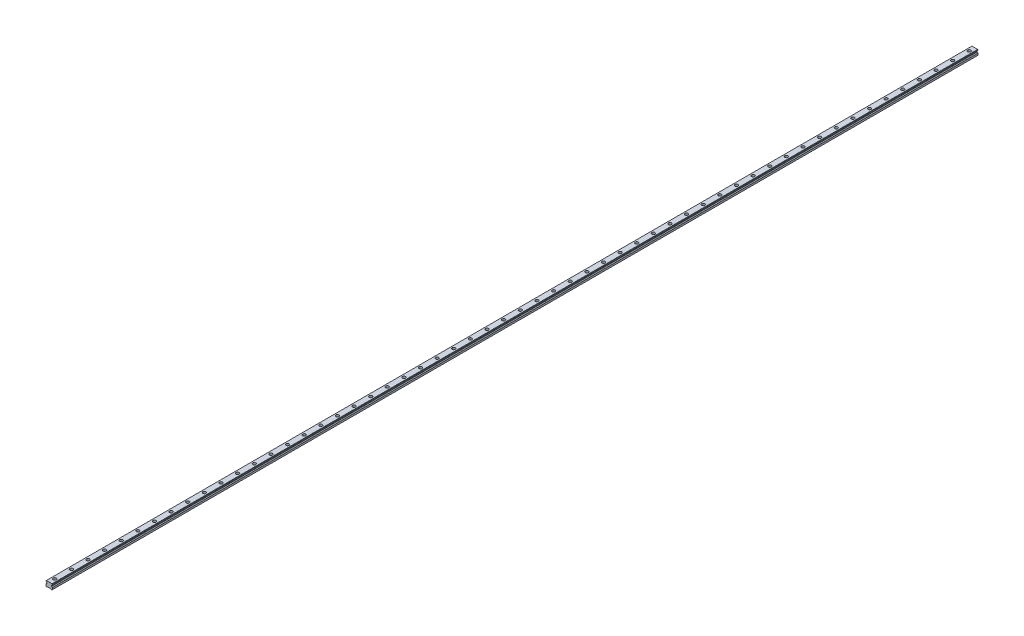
ISO-10303-21;
HEADER;
FILE_DESCRIPTION(('STEP AP214'),'2;1');
FILE_NAME('part.step','',(''),(''),'','','');
FILE_SCHEMA(('AUTOMOTIVE_DESIGN { 1 0 10303 214 1 1 1 1 }'));
ENDSEC;
DATA;
#1=APPLICATION_CONTEXT('core data for automotive mechanical design processes');
#2=APPLICATION_PROTOCOL_DEFINITION('international standard','automotive_design',2000,#1);
#3=PRODUCT_CONTEXT('',#1,'mechanical');
#4=PRODUCT('Part','Part','',(#3));
#5=PRODUCT_RELATED_PRODUCT_CATEGORY('part','',(#4));
#6=PRODUCT_DEFINITION_FORMATION('','',#4);
#7=PRODUCT_DEFINITION_CONTEXT('part definition',#1,'design');
#8=PRODUCT_DEFINITION('design','',#6,#7);
#9=PRODUCT_DEFINITION_SHAPE('','',#8);
#10=(LENGTH_UNIT() NAMED_UNIT(*) SI_UNIT(.MILLI.,.METRE.));
#11=(NAMED_UNIT(*) PLANE_ANGLE_UNIT() SI_UNIT($,.RADIAN.));
#12=(NAMED_UNIT(*) SI_UNIT($,.STERADIAN.) SOLID_ANGLE_UNIT());
#13=UNCERTAINTY_MEASURE_WITH_UNIT(LENGTH_MEASURE(1.E-05),#10,'distance_accuracy_value','');
#14=(GEOMETRIC_REPRESENTATION_CONTEXT(3) GLOBAL_UNCERTAINTY_ASSIGNED_CONTEXT((#13)) GLOBAL_UNIT_ASSIGNED_CONTEXT((#10,
#11,#12)) REPRESENTATION_CONTEXT('',''));
#15=CARTESIAN_POINT('',(0.,0.,0.));
#16=DIRECTION('',(0.,0.,1.));
#17=DIRECTION('',(1.,0.,0.));
#18=AXIS2_PLACEMENT_3D('',#15,#16,#17);
#19=CARTESIAN_POINT('',(0.,10.2,-1650.));
#20=DIRECTION('',(0.,1.,0.));
#21=DIRECTION('',(0.,0.,1.));
#22=AXIS2_PLACEMENT_3D('',#19,#20,#21);
#23=PLANE('',#22);
#24=CARTESIAN_POINT('',(0.,10.2,-1650.));
#25=DIRECTION('',(0.,1.,0.));
#26=DIRECTION('',(0.,0.,1.));
#27=AXIS2_PLACEMENT_3D('',#24,#25,#26);
#28=CIRCLE('',#27,3.49999999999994);
#29=CARTESIAN_POINT('',(0.,10.2,-1646.5));
#30=VERTEX_POINT('',#29);
#31=EDGE_CURVE('E791',#30,#30,#28,.T.);
#32=ORIENTED_EDGE('',*,*,#31,.F.);
#33=EDGE_LOOP('',(#32));
#34=FACE_BOUND('',#33,.T.);
#35=CARTESIAN_POINT('',(0.,10.2,-1650.));
#36=DIRECTION('',(0.,1.,0.));
#37=DIRECTION('',(0.,0.,1.));
#38=AXIS2_PLACEMENT_3D('',#35,#36,#37);
#39=CIRCLE('',#38,5.49999999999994);
#40=CARTESIAN_POINT('',(0.,10.2,-1644.5));
#41=VERTEX_POINT('',#40);
#42=EDGE_CURVE('E11',#41,#41,#39,.T.);
#43=ORIENTED_EDGE('',*,*,#42,.T.);
#44=EDGE_LOOP('',(#43));
#45=FACE_BOUND('',#44,.T.);
#46=ADVANCED_FACE('F39',(#34,#45),#23,.T.);
#47=CARTESIAN_POINT('',(0.,10.2,-1650.));
#48=DIRECTION('',(0.,1.,0.));
#49=DIRECTION('',(0.,0.,1.));
#50=AXIS2_PLACEMENT_3D('',#47,#48,#49);
#51=CYLINDRICAL_SURFACE('',#50,5.49999999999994);
#52=ORIENTED_EDGE('',*,*,#42,.F.);
#53=EDGE_LOOP('',(#52));
#54=FACE_BOUND('',#53,.T.);
#55=CARTESIAN_POINT('',(0.,19.2,-1650.));
#56=DIRECTION('',(0.,1.,0.));
#57=DIRECTION('',(0.,0.,1.));
#58=AXIS2_PLACEMENT_3D('',#55,#56,#57);
#59=CIRCLE('',#58,5.49999999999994);
#60=CARTESIAN_POINT('',(0.,19.2,-1644.5));
#61=VERTEX_POINT('',#60);
#62=EDGE_CURVE('E48',#61,#61,#59,.T.);
#63=ORIENTED_EDGE('',*,*,#62,.T.);
#64=EDGE_LOOP('',(#63));
#65=FACE_BOUND('',#64,.T.);
#66=ADVANCED_FACE('F1426',(#54,#65),#51,.F.);
#67=CARTESIAN_POINT('',(0.,10.2,-1590.));
#68=DIRECTION('',(0.,1.,0.));
#69=DIRECTION('',(0.,0.,1.));
#70=AXIS2_PLACEMENT_3D('',#67,#68,#69);
#71=PLANE('',#70);
#72=CARTESIAN_POINT('',(0.,10.2,-1590.));
#73=DIRECTION('',(0.,1.,0.));
#74=DIRECTION('',(0.,0.,1.));
#75=AXIS2_PLACEMENT_3D('',#72,#73,#74);
#76=CIRCLE('',#75,3.49999999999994);
#77=CARTESIAN_POINT('',(0.,10.2,-1586.5));
#78=VERTEX_POINT('',#77);
#79=EDGE_CURVE('E796',#78,#78,#76,.T.);
#80=ORIENTED_EDGE('',*,*,#79,.F.);
#81=EDGE_LOOP('',(#80));
#82=FACE_BOUND('',#81,.T.);
#83=CARTESIAN_POINT('',(0.,10.2,-1590.));
#84=DIRECTION('',(0.,1.,0.));
#85=DIRECTION('',(0.,0.,1.));
#86=AXIS2_PLACEMENT_3D('',#83,#84,#85);
#87=CIRCLE('',#86,5.49999999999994);
#88=CARTESIAN_POINT('',(0.,10.2,-1584.5));
#89=VERTEX_POINT('',#88);
#90=EDGE_CURVE('E775',#89,#89,#87,.T.);
#91=ORIENTED_EDGE('',*,*,#90,.T.);
#92=EDGE_LOOP('',(#91));
#93=FACE_BOUND('',#92,.T.);
#94=ADVANCED_FACE('F1428',(#82,#93),#71,.T.);
#95=CARTESIAN_POINT('',(0.,10.2,-1590.));
#96=DIRECTION('',(0.,1.,0.));
#97=DIRECTION('',(0.,0.,1.));
#98=AXIS2_PLACEMENT_3D('',#95,#96,#97);
#99=CYLINDRICAL_SURFACE('',#98,5.49999999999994);
#100=ORIENTED_EDGE('',*,*,#90,.F.);
#101=EDGE_LOOP('',(#100));
#102=FACE_BOUND('',#101,.T.);
#103=CARTESIAN_POINT('',(0.,19.2,-1590.));
#104=DIRECTION('',(0.,1.,0.));
#105=DIRECTION('',(0.,0.,1.));
#106=AXIS2_PLACEMENT_3D('',#103,#104,#105);
#107=CIRCLE('',#106,5.49999999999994);
#108=CARTESIAN_POINT('',(0.,19.2,-1584.5));
#109=VERTEX_POINT('',#108);
#110=EDGE_CURVE('E771',#109,#109,#107,.T.);
#111=ORIENTED_EDGE('',*,*,#110,.T.);
#112=EDGE_LOOP('',(#111));
#113=FACE_BOUND('',#112,.T.);
#114=ADVANCED_FACE('F1434',(#102,#113),#99,.F.);
#115=CARTESIAN_POINT('',(0.,10.2,-1530.));
#116=DIRECTION('',(0.,1.,0.));
#117=DIRECTION('',(0.,0.,1.));
#118=AXIS2_PLACEMENT_3D('',#115,#116,#117);
#119=PLANE('',#118);
#120=CARTESIAN_POINT('',(0.,10.2,-1530.));
#121=DIRECTION('',(0.,1.,0.));
#122=DIRECTION('',(0.,0.,1.));
#123=AXIS2_PLACEMENT_3D('',#120,#121,#122);
#124=CIRCLE('',#123,3.49999999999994);
#125=CARTESIAN_POINT('',(0.,10.2,-1526.5));
#126=VERTEX_POINT('',#125);
#127=EDGE_CURVE('E801',#126,#126,#124,.T.);
#128=ORIENTED_EDGE('',*,*,#127,.F.);
#129=EDGE_LOOP('',(#128));
#130=FACE_BOUND('',#129,.T.);
#131=CARTESIAN_POINT('',(0.,10.2,-1530.));
#132=DIRECTION('',(0.,1.,0.));
#133=DIRECTION('',(0.,0.,1.));
#134=AXIS2_PLACEMENT_3D('',#131,#132,#133);
#135=CIRCLE('',#134,5.49999999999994);
#136=CARTESIAN_POINT('',(0.,10.2,-1524.5));
#137=VERTEX_POINT('',#136);
#138=EDGE_CURVE('E767',#137,#137,#135,.T.);
#139=ORIENTED_EDGE('',*,*,#138,.T.);
#140=EDGE_LOOP('',(#139));
#141=FACE_BOUND('',#140,.T.);
#142=ADVANCED_FACE('F1442',(#130,#141),#119,.T.);
#143=CARTESIAN_POINT('',(0.,10.2,-1530.));
#144=DIRECTION('',(0.,1.,0.));
#145=DIRECTION('',(0.,0.,1.));
#146=AXIS2_PLACEMENT_3D('',#143,#144,#145);
#147=CYLINDRICAL_SURFACE('',#146,5.49999999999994);
#148=ORIENTED_EDGE('',*,*,#138,.F.);
#149=EDGE_LOOP('',(#148));
#150=FACE_BOUND('',#149,.T.);
#151=CARTESIAN_POINT('',(0.,19.2,-1530.));
#152=DIRECTION('',(0.,1.,0.));
#153=DIRECTION('',(0.,0.,1.));
#154=AXIS2_PLACEMENT_3D('',#151,#152,#153);
#155=CIRCLE('',#154,5.49999999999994);
#156=CARTESIAN_POINT('',(0.,19.2,-1524.5));
#157=VERTEX_POINT('',#156);
#158=EDGE_CURVE('E763',#157,#157,#155,.T.);
#159=ORIENTED_EDGE('',*,*,#158,.T.);
#160=EDGE_LOOP('',(#159));
#161=FACE_BOUND('',#160,.T.);
#162=ADVANCED_FACE('F1446',(#150,#161),#147,.F.);
#163=CARTESIAN_POINT('',(0.,10.2,-1470.));
#164=DIRECTION('',(0.,1.,0.));
#165=DIRECTION('',(0.,0.,1.));
#166=AXIS2_PLACEMENT_3D('',#163,#164,#165);
#167=PLANE('',#166);
#168=CARTESIAN_POINT('',(0.,10.2,-1470.));
#169=DIRECTION('',(0.,1.,0.));
#170=DIRECTION('',(0.,0.,1.));
#171=AXIS2_PLACEMENT_3D('',#168,#169,#170);
#172=CIRCLE('',#171,3.49999999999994);
#173=CARTESIAN_POINT('',(0.,10.2,-1466.5));
#174=VERTEX_POINT('',#173);
#175=EDGE_CURVE('E806',#174,#174,#172,.T.);
#176=ORIENTED_EDGE('',*,*,#175,.F.);
#177=EDGE_LOOP('',(#176));
#178=FACE_BOUND('',#177,.T.);
#179=CARTESIAN_POINT('',(0.,10.2,-1470.));
#180=DIRECTION('',(0.,1.,0.));
#181=DIRECTION('',(0.,0.,1.));
#182=AXIS2_PLACEMENT_3D('',#179,#180,#181);
#183=CIRCLE('',#182,5.49999999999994);
#184=CARTESIAN_POINT('',(0.,10.2,-1464.5));
#185=VERTEX_POINT('',#184);
#186=EDGE_CURVE('E759',#185,#185,#183,.T.);
#187=ORIENTED_EDGE('',*,*,#186,.T.);
#188=EDGE_LOOP('',(#187));
#189=FACE_BOUND('',#188,.T.);
#190=ADVANCED_FACE('F1450',(#178,#189),#167,.T.);
#191=CARTESIAN_POINT('',(0.,10.2,-1470.));
#192=DIRECTION('',(0.,1.,0.));
#193=DIRECTION('',(0.,0.,1.));
#194=AXIS2_PLACEMENT_3D('',#191,#192,#193);
#195=CYLINDRICAL_SURFACE('',#194,5.49999999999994);
#196=ORIENTED_EDGE('',*,*,#186,.F.);
#197=EDGE_LOOP('',(#196));
#198=FACE_BOUND('',#197,.T.);
#199=CARTESIAN_POINT('',(0.,19.2,-1470.));
#200=DIRECTION('',(0.,1.,0.));
#201=DIRECTION('',(0.,0.,1.));
#202=AXIS2_PLACEMENT_3D('',#199,#200,#201);
#203=CIRCLE('',#202,5.49999999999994);
#204=CARTESIAN_POINT('',(0.,19.2,-1464.5));
#205=VERTEX_POINT('',#204);
#206=EDGE_CURVE('E755',#205,#205,#203,.T.);
#207=ORIENTED_EDGE('',*,*,#206,.T.);
#208=EDGE_LOOP('',(#207));
#209=FACE_BOUND('',#208,.T.);
#210=ADVANCED_FACE('F1454',(#198,#209),#195,.F.);
#211=CARTESIAN_POINT('',(0.,10.2,-1410.));
#212=DIRECTION('',(0.,1.,0.));
#213=DIRECTION('',(0.,0.,1.));
#214=AXIS2_PLACEMENT_3D('',#211,#212,#213);
#215=PLANE('',#214);
#216=CARTESIAN_POINT('',(0.,10.2,-1410.));
#217=DIRECTION('',(0.,1.,0.));
#218=DIRECTION('',(0.,0.,1.));
#219=AXIS2_PLACEMENT_3D('',#216,#217,#218);
#220=CIRCLE('',#219,3.49999999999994);
#221=CARTESIAN_POINT('',(0.,10.2,-1406.5));
#222=VERTEX_POINT('',#221);
#223=EDGE_CURVE('E811',#222,#222,#220,.T.);
#224=ORIENTED_EDGE('',*,*,#223,.F.);
#225=EDGE_LOOP('',(#224));
#226=FACE_BOUND('',#225,.T.);
#227=CARTESIAN_POINT('',(0.,10.2,-1410.));
#228=DIRECTION('',(0.,1.,0.));
#229=DIRECTION('',(0.,0.,1.));
#230=AXIS2_PLACEMENT_3D('',#227,#228,#229);
#231=CIRCLE('',#230,5.49999999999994);
#232=CARTESIAN_POINT('',(0.,10.2,-1404.5));
#233=VERTEX_POINT('',#232);
#234=EDGE_CURVE('E751',#233,#233,#231,.T.);
#235=ORIENTED_EDGE('',*,*,#234,.T.);
#236=EDGE_LOOP('',(#235));
#237=FACE_BOUND('',#236,.T.);
#238=ADVANCED_FACE('F1458',(#226,#237),#215,.T.);
#239=CARTESIAN_POINT('',(0.,10.2,-1410.));
#240=DIRECTION('',(0.,1.,0.));
#241=DIRECTION('',(0.,0.,1.));
#242=AXIS2_PLACEMENT_3D('',#239,#240,#241);
#243=CYLINDRICAL_SURFACE('',#242,5.49999999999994);
#244=ORIENTED_EDGE('',*,*,#234,.F.);
#245=EDGE_LOOP('',(#244));
#246=FACE_BOUND('',#245,.T.);
#247=CARTESIAN_POINT('',(0.,19.2,-1410.));
#248=DIRECTION('',(0.,1.,0.));
#249=DIRECTION('',(0.,0.,1.));
#250=AXIS2_PLACEMENT_3D('',#247,#248,#249);
#251=CIRCLE('',#250,5.49999999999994);
#252=CARTESIAN_POINT('',(0.,19.2,-1404.5));
#253=VERTEX_POINT('',#252);
#254=EDGE_CURVE('E747',#253,#253,#251,.T.);
#255=ORIENTED_EDGE('',*,*,#254,.T.);
#256=EDGE_LOOP('',(#255));
#257=FACE_BOUND('',#256,.T.);
#258=ADVANCED_FACE('F1462',(#246,#257),#243,.F.);
#259=CARTESIAN_POINT('',(0.,10.2,-1350.));
#260=DIRECTION('',(0.,1.,0.));
#261=DIRECTION('',(0.,0.,1.));
#262=AXIS2_PLACEMENT_3D('',#259,#260,#261);
#263=PLANE('',#262);
#264=CARTESIAN_POINT('',(0.,10.2,-1350.));
#265=DIRECTION('',(0.,1.,0.));
#266=DIRECTION('',(0.,0.,1.));
#267=AXIS2_PLACEMENT_3D('',#264,#265,#266);
#268=CIRCLE('',#267,3.49999999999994);
#269=CARTESIAN_POINT('',(0.,10.2,-1346.5));
#270=VERTEX_POINT('',#269);
#271=EDGE_CURVE('E816',#270,#270,#268,.T.);
#272=ORIENTED_EDGE('',*,*,#271,.F.);
#273=EDGE_LOOP('',(#272));
#274=FACE_BOUND('',#273,.T.);
#275=CARTESIAN_POINT('',(0.,10.2,-1350.));
#276=DIRECTION('',(0.,1.,0.));
#277=DIRECTION('',(0.,0.,1.));
#278=AXIS2_PLACEMENT_3D('',#275,#276,#277);
#279=CIRCLE('',#278,5.49999999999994);
#280=CARTESIAN_POINT('',(0.,10.2,-1344.5));
#281=VERTEX_POINT('',#280);
#282=EDGE_CURVE('E743',#281,#281,#279,.T.);
#283=ORIENTED_EDGE('',*,*,#282,.T.);
#284=EDGE_LOOP('',(#283));
#285=FACE_BOUND('',#284,.T.);
#286=ADVANCED_FACE('F1466',(#274,#285),#263,.T.);
#287=CARTESIAN_POINT('',(0.,10.2,-1350.));
#288=DIRECTION('',(0.,1.,0.));
#289=DIRECTION('',(0.,0.,1.));
#290=AXIS2_PLACEMENT_3D('',#287,#288,#289);
#291=CYLINDRICAL_SURFACE('',#290,5.49999999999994);
#292=ORIENTED_EDGE('',*,*,#282,.F.);
#293=EDGE_LOOP('',(#292));
#294=FACE_BOUND('',#293,.T.);
#295=CARTESIAN_POINT('',(0.,19.2,-1350.));
#296=DIRECTION('',(0.,1.,0.));
#297=DIRECTION('',(0.,0.,1.));
#298=AXIS2_PLACEMENT_3D('',#295,#296,#297);
#299=CIRCLE('',#298,5.49999999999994);
#300=CARTESIAN_POINT('',(0.,19.2,-1344.5));
#301=VERTEX_POINT('',#300);
#302=EDGE_CURVE('E739',#301,#301,#299,.T.);
#303=ORIENTED_EDGE('',*,*,#302,.T.);
#304=EDGE_LOOP('',(#303));
#305=FACE_BOUND('',#304,.T.);
#306=ADVANCED_FACE('F1470',(#294,#305),#291,.F.);
#307=CARTESIAN_POINT('',(0.,10.2,-1290.));
#308=DIRECTION('',(0.,1.,0.));
#309=DIRECTION('',(0.,0.,1.));
#310=AXIS2_PLACEMENT_3D('',#307,#308,#309);
#311=PLANE('',#310);
#312=CARTESIAN_POINT('',(0.,10.2,-1290.));
#313=DIRECTION('',(0.,1.,0.));
#314=DIRECTION('',(0.,0.,1.));
#315=AXIS2_PLACEMENT_3D('',#312,#313,#314);
#316=CIRCLE('',#315,3.49999999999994);
#317=CARTESIAN_POINT('',(0.,10.2,-1286.5));
#318=VERTEX_POINT('',#317);
#319=EDGE_CURVE('E821',#318,#318,#316,.T.);
#320=ORIENTED_EDGE('',*,*,#319,.F.);
#321=EDGE_LOOP('',(#320));
#322=FACE_BOUND('',#321,.T.);
#323=CARTESIAN_POINT('',(0.,10.2,-1290.));
#324=DIRECTION('',(0.,1.,0.));
#325=DIRECTION('',(0.,0.,1.));
#326=AXIS2_PLACEMENT_3D('',#323,#324,#325);
#327=CIRCLE('',#326,5.49999999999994);
#328=CARTESIAN_POINT('',(0.,10.2,-1284.5));
#329=VERTEX_POINT('',#328);
#330=EDGE_CURVE('E735',#329,#329,#327,.T.);
#331=ORIENTED_EDGE('',*,*,#330,.T.);
#332=EDGE_LOOP('',(#331));
#333=FACE_BOUND('',#332,.T.);
#334=ADVANCED_FACE('F1474',(#322,#333),#311,.T.);
#335=CARTESIAN_POINT('',(0.,10.2,-1290.));
#336=DIRECTION('',(0.,1.,0.));
#337=DIRECTION('',(0.,0.,1.));
#338=AXIS2_PLACEMENT_3D('',#335,#336,#337);
#339=CYLINDRICAL_SURFACE('',#338,5.49999999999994);
#340=ORIENTED_EDGE('',*,*,#330,.F.);
#341=EDGE_LOOP('',(#340));
#342=FACE_BOUND('',#341,.T.);
#343=CARTESIAN_POINT('',(0.,19.2,-1290.));
#344=DIRECTION('',(0.,1.,0.));
#345=DIRECTION('',(0.,0.,1.));
#346=AXIS2_PLACEMENT_3D('',#343,#344,#345);
#347=CIRCLE('',#346,5.49999999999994);
#348=CARTESIAN_POINT('',(0.,19.2,-1284.5));
#349=VERTEX_POINT('',#348);
#350=EDGE_CURVE('E731',#349,#349,#347,.T.);
#351=ORIENTED_EDGE('',*,*,#350,.T.);
#352=EDGE_LOOP('',(#351));
#353=FACE_BOUND('',#352,.T.);
#354=ADVANCED_FACE('F1478',(#342,#353),#339,.F.);
#355=CARTESIAN_POINT('',(0.,10.2,-1230.));
#356=DIRECTION('',(0.,1.,0.));
#357=DIRECTION('',(0.,0.,1.));
#358=AXIS2_PLACEMENT_3D('',#355,#356,#357);
#359=PLANE('',#358);
#360=CARTESIAN_POINT('',(0.,10.2,-1230.));
#361=DIRECTION('',(0.,1.,0.));
#362=DIRECTION('',(0.,0.,1.));
#363=AXIS2_PLACEMENT_3D('',#360,#361,#362);
#364=CIRCLE('',#363,3.49999999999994);
#365=CARTESIAN_POINT('',(0.,10.2,-1226.5));
#366=VERTEX_POINT('',#365);
#367=EDGE_CURVE('E826',#366,#366,#364,.T.);
#368=ORIENTED_EDGE('',*,*,#367,.F.);
#369=EDGE_LOOP('',(#368));
#370=FACE_BOUND('',#369,.T.);
#371=CARTESIAN_POINT('',(0.,10.2,-1230.));
#372=DIRECTION('',(0.,1.,0.));
#373=DIRECTION('',(0.,0.,1.));
#374=AXIS2_PLACEMENT_3D('',#371,#372,#373);
#375=CIRCLE('',#374,5.49999999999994);
#376=CARTESIAN_POINT('',(0.,10.2,-1224.5));
#377=VERTEX_POINT('',#376);
#378=EDGE_CURVE('E727',#377,#377,#375,.T.);
#379=ORIENTED_EDGE('',*,*,#378,.T.);
#380=EDGE_LOOP('',(#379));
#381=FACE_BOUND('',#380,.T.);
#382=ADVANCED_FACE('F1482',(#370,#381),#359,.T.);
#383=CARTESIAN_POINT('',(0.,10.2,-1230.));
#384=DIRECTION('',(0.,1.,0.));
#385=DIRECTION('',(0.,0.,1.));
#386=AXIS2_PLACEMENT_3D('',#383,#384,#385);
#387=CYLINDRICAL_SURFACE('',#386,5.49999999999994);
#388=ORIENTED_EDGE('',*,*,#378,.F.);
#389=EDGE_LOOP('',(#388));
#390=FACE_BOUND('',#389,.T.);
#391=CARTESIAN_POINT('',(0.,19.2,-1230.));
#392=DIRECTION('',(0.,1.,0.));
#393=DIRECTION('',(0.,0.,1.));
#394=AXIS2_PLACEMENT_3D('',#391,#392,#393);
#395=CIRCLE('',#394,5.49999999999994);
#396=CARTESIAN_POINT('',(0.,19.2,-1224.5));
#397=VERTEX_POINT('',#396);
#398=EDGE_CURVE('E723',#397,#397,#395,.T.);
#399=ORIENTED_EDGE('',*,*,#398,.T.);
#400=EDGE_LOOP('',(#399));
#401=FACE_BOUND('',#400,.T.);
#402=ADVANCED_FACE('F1486',(#390,#401),#387,.F.);
#403=CARTESIAN_POINT('',(0.,10.2,-1170.));
#404=DIRECTION('',(0.,1.,0.));
#405=DIRECTION('',(0.,0.,1.));
#406=AXIS2_PLACEMENT_3D('',#403,#404,#405);
#407=PLANE('',#406);
#408=CARTESIAN_POINT('',(0.,10.2,-1170.));
#409=DIRECTION('',(0.,1.,0.));
#410=DIRECTION('',(0.,0.,1.));
#411=AXIS2_PLACEMENT_3D('',#408,#409,#410);
#412=CIRCLE('',#411,3.49999999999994);
#413=CARTESIAN_POINT('',(0.,10.2,-1166.5));
#414=VERTEX_POINT('',#413);
#415=EDGE_CURVE('E831',#414,#414,#412,.T.);
#416=ORIENTED_EDGE('',*,*,#415,.F.);
#417=EDGE_LOOP('',(#416));
#418=FACE_BOUND('',#417,.T.);
#419=CARTESIAN_POINT('',(0.,10.2,-1170.));
#420=DIRECTION('',(0.,1.,0.));
#421=DIRECTION('',(0.,0.,1.));
#422=AXIS2_PLACEMENT_3D('',#419,#420,#421);
#423=CIRCLE('',#422,5.49999999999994);
#424=CARTESIAN_POINT('',(0.,10.2,-1164.5));
#425=VERTEX_POINT('',#424);
#426=EDGE_CURVE('E719',#425,#425,#423,.T.);
#427=ORIENTED_EDGE('',*,*,#426,.T.);
#428=EDGE_LOOP('',(#427));
#429=FACE_BOUND('',#428,.T.);
#430=ADVANCED_FACE('F1490',(#418,#429),#407,.T.);
#431=CARTESIAN_POINT('',(0.,10.2,-1170.));
#432=DIRECTION('',(0.,1.,0.));
#433=DIRECTION('',(0.,0.,1.));
#434=AXIS2_PLACEMENT_3D('',#431,#432,#433);
#435=CYLINDRICAL_SURFACE('',#434,5.49999999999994);
#436=ORIENTED_EDGE('',*,*,#426,.F.);
#437=EDGE_LOOP('',(#436));
#438=FACE_BOUND('',#437,.T.);
#439=CARTESIAN_POINT('',(0.,19.2,-1170.));
#440=DIRECTION('',(0.,1.,0.));
#441=DIRECTION('',(0.,0.,1.));
#442=AXIS2_PLACEMENT_3D('',#439,#440,#441);
#443=CIRCLE('',#442,5.49999999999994);
#444=CARTESIAN_POINT('',(0.,19.2,-1164.5));
#445=VERTEX_POINT('',#444);
#446=EDGE_CURVE('E715',#445,#445,#443,.T.);
#447=ORIENTED_EDGE('',*,*,#446,.T.);
#448=EDGE_LOOP('',(#447));
#449=FACE_BOUND('',#448,.T.);
#450=ADVANCED_FACE('F1494',(#438,#449),#435,.F.);
#451=CARTESIAN_POINT('',(0.,10.2,-1110.));
#452=DIRECTION('',(0.,1.,0.));
#453=DIRECTION('',(0.,0.,1.));
#454=AXIS2_PLACEMENT_3D('',#451,#452,#453);
#455=PLANE('',#454);
#456=CARTESIAN_POINT('',(0.,10.2,-1110.));
#457=DIRECTION('',(0.,1.,0.));
#458=DIRECTION('',(0.,0.,1.));
#459=AXIS2_PLACEMENT_3D('',#456,#457,#458);
#460=CIRCLE('',#459,3.49999999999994);
#461=CARTESIAN_POINT('',(0.,10.2,-1106.5));
#462=VERTEX_POINT('',#461);
#463=EDGE_CURVE('E836',#462,#462,#460,.T.);
#464=ORIENTED_EDGE('',*,*,#463,.F.);
#465=EDGE_LOOP('',(#464));
#466=FACE_BOUND('',#465,.T.);
#467=CARTESIAN_POINT('',(0.,10.2,-1110.));
#468=DIRECTION('',(0.,1.,0.));
#469=DIRECTION('',(0.,0.,1.));
#470=AXIS2_PLACEMENT_3D('',#467,#468,#469);
#471=CIRCLE('',#470,5.49999999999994);
#472=CARTESIAN_POINT('',(0.,10.2,-1104.5));
#473=VERTEX_POINT('',#472);
#474=EDGE_CURVE('E711',#473,#473,#471,.T.);
#475=ORIENTED_EDGE('',*,*,#474,.T.);
#476=EDGE_LOOP('',(#475));
#477=FACE_BOUND('',#476,.T.);
#478=ADVANCED_FACE('F1498',(#466,#477),#455,.T.);
#479=CARTESIAN_POINT('',(0.,10.2,-1110.));
#480=DIRECTION('',(0.,1.,0.));
#481=DIRECTION('',(0.,0.,1.));
#482=AXIS2_PLACEMENT_3D('',#479,#480,#481);
#483=CYLINDRICAL_SURFACE('',#482,5.49999999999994);
#484=ORIENTED_EDGE('',*,*,#474,.F.);
#485=EDGE_LOOP('',(#484));
#486=FACE_BOUND('',#485,.T.);
#487=CARTESIAN_POINT('',(0.,19.2,-1110.));
#488=DIRECTION('',(0.,1.,0.));
#489=DIRECTION('',(0.,0.,1.));
#490=AXIS2_PLACEMENT_3D('',#487,#488,#489);
#491=CIRCLE('',#490,5.49999999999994);
#492=CARTESIAN_POINT('',(0.,19.2,-1104.5));
#493=VERTEX_POINT('',#492);
#494=EDGE_CURVE('E707',#493,#493,#491,.T.);
#495=ORIENTED_EDGE('',*,*,#494,.T.);
#496=EDGE_LOOP('',(#495));
#497=FACE_BOUND('',#496,.T.);
#498=ADVANCED_FACE('F1502',(#486,#497),#483,.F.);
#499=CARTESIAN_POINT('',(0.,10.2,-1050.));
#500=DIRECTION('',(0.,1.,0.));
#501=DIRECTION('',(0.,0.,1.));
#502=AXIS2_PLACEMENT_3D('',#499,#500,#501);
#503=PLANE('',#502);
#504=CARTESIAN_POINT('',(0.,10.2,-1050.));
#505=DIRECTION('',(0.,1.,0.));
#506=DIRECTION('',(0.,0.,1.));
#507=AXIS2_PLACEMENT_3D('',#504,#505,#506);
#508=CIRCLE('',#507,3.49999999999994);
#509=CARTESIAN_POINT('',(0.,10.2,-1046.5));
#510=VERTEX_POINT('',#509);
#511=EDGE_CURVE('E841',#510,#510,#508,.T.);
#512=ORIENTED_EDGE('',*,*,#511,.F.);
#513=EDGE_LOOP('',(#512));
#514=FACE_BOUND('',#513,.T.);
#515=CARTESIAN_POINT('',(0.,10.2,-1050.));
#516=DIRECTION('',(0.,1.,0.));
#517=DIRECTION('',(0.,0.,1.));
#518=AXIS2_PLACEMENT_3D('',#515,#516,#517);
#519=CIRCLE('',#518,5.49999999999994);
#520=CARTESIAN_POINT('',(0.,10.2,-1044.5));
#521=VERTEX_POINT('',#520);
#522=EDGE_CURVE('E703',#521,#521,#519,.T.);
#523=ORIENTED_EDGE('',*,*,#522,.T.);
#524=EDGE_LOOP('',(#523));
#525=FACE_BOUND('',#524,.T.);
#526=ADVANCED_FACE('F1506',(#514,#525),#503,.T.);
#527=CARTESIAN_POINT('',(0.,10.2,-1050.));
#528=DIRECTION('',(0.,1.,0.));
#529=DIRECTION('',(0.,0.,1.));
#530=AXIS2_PLACEMENT_3D('',#527,#528,#529);
#531=CYLINDRICAL_SURFACE('',#530,5.49999999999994);
#532=ORIENTED_EDGE('',*,*,#522,.F.);
#533=EDGE_LOOP('',(#532));
#534=FACE_BOUND('',#533,.T.);
#535=CARTESIAN_POINT('',(0.,19.2,-1050.));
#536=DIRECTION('',(0.,1.,0.));
#537=DIRECTION('',(0.,0.,1.));
#538=AXIS2_PLACEMENT_3D('',#535,#536,#537);
#539=CIRCLE('',#538,5.49999999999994);
#540=CARTESIAN_POINT('',(0.,19.2,-1044.5));
#541=VERTEX_POINT('',#540);
#542=EDGE_CURVE('E699',#541,#541,#539,.T.);
#543=ORIENTED_EDGE('',*,*,#542,.T.);
#544=EDGE_LOOP('',(#543));
#545=FACE_BOUND('',#544,.T.);
#546=ADVANCED_FACE('F1510',(#534,#545),#531,.F.);
#547=CARTESIAN_POINT('',(0.,10.2,-990.));
#548=DIRECTION('',(0.,1.,0.));
#549=DIRECTION('',(0.,0.,1.));
#550=AXIS2_PLACEMENT_3D('',#547,#548,#549);
#551=PLANE('',#550);
#552=CARTESIAN_POINT('',(0.,10.2,-990.));
#553=DIRECTION('',(0.,1.,0.));
#554=DIRECTION('',(0.,0.,1.));
#555=AXIS2_PLACEMENT_3D('',#552,#553,#554);
#556=CIRCLE('',#555,3.49999999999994);
#557=CARTESIAN_POINT('',(0.,10.2,-986.5));
#558=VERTEX_POINT('',#557);
#559=EDGE_CURVE('E846',#558,#558,#556,.T.);
#560=ORIENTED_EDGE('',*,*,#559,.F.);
#561=EDGE_LOOP('',(#560));
#562=FACE_BOUND('',#561,.T.);
#563=CARTESIAN_POINT('',(0.,10.2,-990.));
#564=DIRECTION('',(0.,1.,0.));
#565=DIRECTION('',(0.,0.,1.));
#566=AXIS2_PLACEMENT_3D('',#563,#564,#565);
#567=CIRCLE('',#566,5.49999999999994);
#568=CARTESIAN_POINT('',(0.,10.2,-984.5));
#569=VERTEX_POINT('',#568);
#570=EDGE_CURVE('E695',#569,#569,#567,.T.);
#571=ORIENTED_EDGE('',*,*,#570,.T.);
#572=EDGE_LOOP('',(#571));
#573=FACE_BOUND('',#572,.T.);
#574=ADVANCED_FACE('F1514',(#562,#573),#551,.T.);
#575=CARTESIAN_POINT('',(0.,10.2,-990.));
#576=DIRECTION('',(0.,1.,0.));
#577=DIRECTION('',(0.,0.,1.));
#578=AXIS2_PLACEMENT_3D('',#575,#576,#577);
#579=CYLINDRICAL_SURFACE('',#578,5.49999999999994);
#580=ORIENTED_EDGE('',*,*,#570,.F.);
#581=EDGE_LOOP('',(#580));
#582=FACE_BOUND('',#581,.T.);
#583=CARTESIAN_POINT('',(0.,19.2,-990.));
#584=DIRECTION('',(0.,1.,0.));
#585=DIRECTION('',(0.,0.,1.));
#586=AXIS2_PLACEMENT_3D('',#583,#584,#585);
#587=CIRCLE('',#586,5.49999999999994);
#588=CARTESIAN_POINT('',(0.,19.2,-984.5));
#589=VERTEX_POINT('',#588);
#590=EDGE_CURVE('E691',#589,#589,#587,.T.);
#591=ORIENTED_EDGE('',*,*,#590,.T.);
#592=EDGE_LOOP('',(#591));
#593=FACE_BOUND('',#592,.T.);
#594=ADVANCED_FACE('F1518',(#582,#593),#579,.F.);
#595=CARTESIAN_POINT('',(0.,10.2,-930.));
#596=DIRECTION('',(0.,1.,0.));
#597=DIRECTION('',(0.,0.,1.));
#598=AXIS2_PLACEMENT_3D('',#595,#596,#597);
#599=PLANE('',#598);
#600=CARTESIAN_POINT('',(0.,10.2,-930.));
#601=DIRECTION('',(0.,1.,0.));
#602=DIRECTION('',(0.,0.,1.));
#603=AXIS2_PLACEMENT_3D('',#600,#601,#602);
#604=CIRCLE('',#603,3.49999999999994);
#605=CARTESIAN_POINT('',(0.,10.2,-926.5));
#606=VERTEX_POINT('',#605);
#607=EDGE_CURVE('E851',#606,#606,#604,.T.);
#608=ORIENTED_EDGE('',*,*,#607,.F.);
#609=EDGE_LOOP('',(#608));
#610=FACE_BOUND('',#609,.T.);
#611=CARTESIAN_POINT('',(0.,10.2,-930.));
#612=DIRECTION('',(0.,1.,0.));
#613=DIRECTION('',(0.,0.,1.));
#614=AXIS2_PLACEMENT_3D('',#611,#612,#613);
#615=CIRCLE('',#614,5.49999999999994);
#616=CARTESIAN_POINT('',(0.,10.2,-924.5));
#617=VERTEX_POINT('',#616);
#618=EDGE_CURVE('E687',#617,#617,#615,.T.);
#619=ORIENTED_EDGE('',*,*,#618,.T.);
#620=EDGE_LOOP('',(#619));
#621=FACE_BOUND('',#620,.T.);
#622=ADVANCED_FACE('F1522',(#610,#621),#599,.T.);
#623=CARTESIAN_POINT('',(0.,10.2,-930.));
#624=DIRECTION('',(0.,1.,0.));
#625=DIRECTION('',(0.,0.,1.));
#626=AXIS2_PLACEMENT_3D('',#623,#624,#625);
#627=CYLINDRICAL_SURFACE('',#626,5.49999999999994);
#628=ORIENTED_EDGE('',*,*,#618,.F.);
#629=EDGE_LOOP('',(#628));
#630=FACE_BOUND('',#629,.T.);
#631=CARTESIAN_POINT('',(0.,19.2,-930.));
#632=DIRECTION('',(0.,1.,0.));
#633=DIRECTION('',(0.,0.,1.));
#634=AXIS2_PLACEMENT_3D('',#631,#632,#633);
#635=CIRCLE('',#634,5.49999999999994);
#636=CARTESIAN_POINT('',(0.,19.2,-924.5));
#637=VERTEX_POINT('',#636);
#638=EDGE_CURVE('E683',#637,#637,#635,.T.);
#639=ORIENTED_EDGE('',*,*,#638,.T.);
#640=EDGE_LOOP('',(#639));
#641=FACE_BOUND('',#640,.T.);
#642=ADVANCED_FACE('F1526',(#630,#641),#627,.F.);
#643=CARTESIAN_POINT('',(0.,10.2,-870.));
#644=DIRECTION('',(0.,1.,0.));
#645=DIRECTION('',(0.,0.,1.));
#646=AXIS2_PLACEMENT_3D('',#643,#644,#645);
#647=PLANE('',#646);
#648=CARTESIAN_POINT('',(0.,10.2,-870.));
#649=DIRECTION('',(0.,1.,0.));
#650=DIRECTION('',(0.,0.,1.));
#651=AXIS2_PLACEMENT_3D('',#648,#649,#650);
#652=CIRCLE('',#651,3.49999999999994);
#653=CARTESIAN_POINT('',(0.,10.2,-866.5));
#654=VERTEX_POINT('',#653);
#655=EDGE_CURVE('E856',#654,#654,#652,.T.);
#656=ORIENTED_EDGE('',*,*,#655,.F.);
#657=EDGE_LOOP('',(#656));
#658=FACE_BOUND('',#657,.T.);
#659=CARTESIAN_POINT('',(0.,10.2,-870.));
#660=DIRECTION('',(0.,1.,0.));
#661=DIRECTION('',(0.,0.,1.));
#662=AXIS2_PLACEMENT_3D('',#659,#660,#661);
#663=CIRCLE('',#662,5.49999999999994);
#664=CARTESIAN_POINT('',(0.,10.2,-864.5));
#665=VERTEX_POINT('',#664);
#666=EDGE_CURVE('E679',#665,#665,#663,.T.);
#667=ORIENTED_EDGE('',*,*,#666,.T.);
#668=EDGE_LOOP('',(#667));
#669=FACE_BOUND('',#668,.T.);
#670=ADVANCED_FACE('F1530',(#658,#669),#647,.T.);
#671=CARTESIAN_POINT('',(0.,10.2,-870.));
#672=DIRECTION('',(0.,1.,0.));
#673=DIRECTION('',(0.,0.,1.));
#674=AXIS2_PLACEMENT_3D('',#671,#672,#673);
#675=CYLINDRICAL_SURFACE('',#674,5.49999999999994);
#676=ORIENTED_EDGE('',*,*,#666,.F.);
#677=EDGE_LOOP('',(#676));
#678=FACE_BOUND('',#677,.T.);
#679=CARTESIAN_POINT('',(0.,19.2,-870.));
#680=DIRECTION('',(0.,1.,0.));
#681=DIRECTION('',(0.,0.,1.));
#682=AXIS2_PLACEMENT_3D('',#679,#680,#681);
#683=CIRCLE('',#682,5.49999999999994);
#684=CARTESIAN_POINT('',(0.,19.2,-864.5));
#685=VERTEX_POINT('',#684);
#686=EDGE_CURVE('E675',#685,#685,#683,.T.);
#687=ORIENTED_EDGE('',*,*,#686,.T.);
#688=EDGE_LOOP('',(#687));
#689=FACE_BOUND('',#688,.T.);
#690=ADVANCED_FACE('F1534',(#678,#689),#675,.F.);
#691=CARTESIAN_POINT('',(0.,10.2,-810.));
#692=DIRECTION('',(0.,1.,0.));
#693=DIRECTION('',(0.,0.,1.));
#694=AXIS2_PLACEMENT_3D('',#691,#692,#693);
#695=PLANE('',#694);
#696=CARTESIAN_POINT('',(0.,10.2,-810.));
#697=DIRECTION('',(0.,1.,0.));
#698=DIRECTION('',(0.,0.,1.));
#699=AXIS2_PLACEMENT_3D('',#696,#697,#698);
#700=CIRCLE('',#699,3.49999999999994);
#701=CARTESIAN_POINT('',(0.,10.2,-806.5));
#702=VERTEX_POINT('',#701);
#703=EDGE_CURVE('E861',#702,#702,#700,.T.);
#704=ORIENTED_EDGE('',*,*,#703,.F.);
#705=EDGE_LOOP('',(#704));
#706=FACE_BOUND('',#705,.T.);
#707=CARTESIAN_POINT('',(0.,10.2,-810.));
#708=DIRECTION('',(0.,1.,0.));
#709=DIRECTION('',(0.,0.,1.));
#710=AXIS2_PLACEMENT_3D('',#707,#708,#709);
#711=CIRCLE('',#710,5.49999999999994);
#712=CARTESIAN_POINT('',(0.,10.2,-804.5));
#713=VERTEX_POINT('',#712);
#714=EDGE_CURVE('E671',#713,#713,#711,.T.);
#715=ORIENTED_EDGE('',*,*,#714,.T.);
#716=EDGE_LOOP('',(#715));
#717=FACE_BOUND('',#716,.T.);
#718=ADVANCED_FACE('F1538',(#706,#717),#695,.T.);
#719=CARTESIAN_POINT('',(0.,10.2,-810.));
#720=DIRECTION('',(0.,1.,0.));
#721=DIRECTION('',(0.,0.,1.));
#722=AXIS2_PLACEMENT_3D('',#719,#720,#721);
#723=CYLINDRICAL_SURFACE('',#722,5.49999999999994);
#724=ORIENTED_EDGE('',*,*,#714,.F.);
#725=EDGE_LOOP('',(#724));
#726=FACE_BOUND('',#725,.T.);
#727=CARTESIAN_POINT('',(0.,19.2,-810.));
#728=DIRECTION('',(0.,1.,0.));
#729=DIRECTION('',(0.,0.,1.));
#730=AXIS2_PLACEMENT_3D('',#727,#728,#729);
#731=CIRCLE('',#730,5.49999999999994);
#732=CARTESIAN_POINT('',(0.,19.2,-804.5));
#733=VERTEX_POINT('',#732);
#734=EDGE_CURVE('E667',#733,#733,#731,.T.);
#735=ORIENTED_EDGE('',*,*,#734,.T.);
#736=EDGE_LOOP('',(#735));
#737=FACE_BOUND('',#736,.T.);
#738=ADVANCED_FACE('F1542',(#726,#737),#723,.F.);
#739=CARTESIAN_POINT('',(0.,10.2,-750.));
#740=DIRECTION('',(0.,1.,0.));
#741=DIRECTION('',(0.,0.,1.));
#742=AXIS2_PLACEMENT_3D('',#739,#740,#741);
#743=PLANE('',#742);
#744=CARTESIAN_POINT('',(0.,10.2,-750.));
#745=DIRECTION('',(0.,1.,0.));
#746=DIRECTION('',(0.,0.,1.));
#747=AXIS2_PLACEMENT_3D('',#744,#745,#746);
#748=CIRCLE('',#747,3.49999999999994);
#749=CARTESIAN_POINT('',(0.,10.2,-746.5));
#750=VERTEX_POINT('',#749);
#751=EDGE_CURVE('E866',#750,#750,#748,.T.);
#752=ORIENTED_EDGE('',*,*,#751,.F.);
#753=EDGE_LOOP('',(#752));
#754=FACE_BOUND('',#753,.T.);
#755=CARTESIAN_POINT('',(0.,10.2,-750.));
#756=DIRECTION('',(0.,1.,0.));
#757=DIRECTION('',(0.,0.,1.));
#758=AXIS2_PLACEMENT_3D('',#755,#756,#757);
#759=CIRCLE('',#758,5.49999999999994);
#760=CARTESIAN_POINT('',(0.,10.2,-744.5));
#761=VERTEX_POINT('',#760);
#762=EDGE_CURVE('E663',#761,#761,#759,.T.);
#763=ORIENTED_EDGE('',*,*,#762,.T.);
#764=EDGE_LOOP('',(#763));
#765=FACE_BOUND('',#764,.T.);
#766=ADVANCED_FACE('F1546',(#754,#765),#743,.T.);
#767=CARTESIAN_POINT('',(0.,10.2,-750.));
#768=DIRECTION('',(0.,1.,0.));
#769=DIRECTION('',(0.,0.,1.));
#770=AXIS2_PLACEMENT_3D('',#767,#768,#769);
#771=CYLINDRICAL_SURFACE('',#770,5.49999999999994);
#772=ORIENTED_EDGE('',*,*,#762,.F.);
#773=EDGE_LOOP('',(#772));
#774=FACE_BOUND('',#773,.T.);
#775=CARTESIAN_POINT('',(0.,19.2,-750.));
#776=DIRECTION('',(0.,1.,0.));
#777=DIRECTION('',(0.,0.,1.));
#778=AXIS2_PLACEMENT_3D('',#775,#776,#777);
#779=CIRCLE('',#778,5.49999999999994);
#780=CARTESIAN_POINT('',(0.,19.2,-744.5));
#781=VERTEX_POINT('',#780);
#782=EDGE_CURVE('E659',#781,#781,#779,.T.);
#783=ORIENTED_EDGE('',*,*,#782,.T.);
#784=EDGE_LOOP('',(#783));
#785=FACE_BOUND('',#784,.T.);
#786=ADVANCED_FACE('F1550',(#774,#785),#771,.F.);
#787=CARTESIAN_POINT('',(0.,10.2,-690.));
#788=DIRECTION('',(0.,1.,0.));
#789=DIRECTION('',(0.,0.,1.));
#790=AXIS2_PLACEMENT_3D('',#787,#788,#789);
#791=PLANE('',#790);
#792=CARTESIAN_POINT('',(0.,10.2,-690.));
#793=DIRECTION('',(0.,1.,0.));
#794=DIRECTION('',(0.,0.,1.));
#795=AXIS2_PLACEMENT_3D('',#792,#793,#794);
#796=CIRCLE('',#795,3.49999999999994);
#797=CARTESIAN_POINT('',(0.,10.2,-686.5));
#798=VERTEX_POINT('',#797);
#799=EDGE_CURVE('E871',#798,#798,#796,.T.);
#800=ORIENTED_EDGE('',*,*,#799,.F.);
#801=EDGE_LOOP('',(#800));
#802=FACE_BOUND('',#801,.T.);
#803=CARTESIAN_POINT('',(0.,10.2,-690.));
#804=DIRECTION('',(0.,1.,0.));
#805=DIRECTION('',(0.,0.,1.));
#806=AXIS2_PLACEMENT_3D('',#803,#804,#805);
#807=CIRCLE('',#806,5.49999999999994);
#808=CARTESIAN_POINT('',(0.,10.2,-684.5));
#809=VERTEX_POINT('',#808);
#810=EDGE_CURVE('E655',#809,#809,#807,.T.);
#811=ORIENTED_EDGE('',*,*,#810,.T.);
#812=EDGE_LOOP('',(#811));
#813=FACE_BOUND('',#812,.T.);
#814=ADVANCED_FACE('F1554',(#802,#813),#791,.T.);
#815=CARTESIAN_POINT('',(0.,10.2,-690.));
#816=DIRECTION('',(0.,1.,0.));
#817=DIRECTION('',(0.,0.,1.));
#818=AXIS2_PLACEMENT_3D('',#815,#816,#817);
#819=CYLINDRICAL_SURFACE('',#818,5.49999999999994);
#820=ORIENTED_EDGE('',*,*,#810,.F.);
#821=EDGE_LOOP('',(#820));
#822=FACE_BOUND('',#821,.T.);
#823=CARTESIAN_POINT('',(0.,19.2,-690.));
#824=DIRECTION('',(0.,1.,0.));
#825=DIRECTION('',(0.,0.,1.));
#826=AXIS2_PLACEMENT_3D('',#823,#824,#825);
#827=CIRCLE('',#826,5.49999999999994);
#828=CARTESIAN_POINT('',(0.,19.2,-684.5));
#829=VERTEX_POINT('',#828);
#830=EDGE_CURVE('E651',#829,#829,#827,.T.);
#831=ORIENTED_EDGE('',*,*,#830,.T.);
#832=EDGE_LOOP('',(#831));
#833=FACE_BOUND('',#832,.T.);
#834=ADVANCED_FACE('F1558',(#822,#833),#819,.F.);
#835=CARTESIAN_POINT('',(0.,10.2,-630.));
#836=DIRECTION('',(0.,1.,0.));
#837=DIRECTION('',(0.,0.,1.));
#838=AXIS2_PLACEMENT_3D('',#835,#836,#837);
#839=PLANE('',#838);
#840=CARTESIAN_POINT('',(0.,10.2,-630.));
#841=DIRECTION('',(0.,1.,0.));
#842=DIRECTION('',(0.,0.,1.));
#843=AXIS2_PLACEMENT_3D('',#840,#841,#842);
#844=CIRCLE('',#843,3.49999999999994);
#845=CARTESIAN_POINT('',(0.,10.2,-626.5));
#846=VERTEX_POINT('',#845);
#847=EDGE_CURVE('E876',#846,#846,#844,.T.);
#848=ORIENTED_EDGE('',*,*,#847,.F.);
#849=EDGE_LOOP('',(#848));
#850=FACE_BOUND('',#849,.T.);
#851=CARTESIAN_POINT('',(0.,10.2,-630.));
#852=DIRECTION('',(0.,1.,0.));
#853=DIRECTION('',(0.,0.,1.));
#854=AXIS2_PLACEMENT_3D('',#851,#852,#853);
#855=CIRCLE('',#854,5.49999999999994);
#856=CARTESIAN_POINT('',(0.,10.2,-624.5));
#857=VERTEX_POINT('',#856);
#858=EDGE_CURVE('E647',#857,#857,#855,.T.);
#859=ORIENTED_EDGE('',*,*,#858,.T.);
#860=EDGE_LOOP('',(#859));
#861=FACE_BOUND('',#860,.T.);
#862=ADVANCED_FACE('F1562',(#850,#861),#839,.T.);
#863=CARTESIAN_POINT('',(0.,10.2,-630.));
#864=DIRECTION('',(0.,1.,0.));
#865=DIRECTION('',(0.,0.,1.));
#866=AXIS2_PLACEMENT_3D('',#863,#864,#865);
#867=CYLINDRICAL_SURFACE('',#866,5.49999999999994);
#868=ORIENTED_EDGE('',*,*,#858,.F.);
#869=EDGE_LOOP('',(#868));
#870=FACE_BOUND('',#869,.T.);
#871=CARTESIAN_POINT('',(0.,19.2,-630.));
#872=DIRECTION('',(0.,1.,0.));
#873=DIRECTION('',(0.,0.,1.));
#874=AXIS2_PLACEMENT_3D('',#871,#872,#873);
#875=CIRCLE('',#874,5.49999999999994);
#876=CARTESIAN_POINT('',(0.,19.2,-624.5));
#877=VERTEX_POINT('',#876);
#878=EDGE_CURVE('E643',#877,#877,#875,.T.);
#879=ORIENTED_EDGE('',*,*,#878,.T.);
#880=EDGE_LOOP('',(#879));
#881=FACE_BOUND('',#880,.T.);
#882=ADVANCED_FACE('F1566',(#870,#881),#867,.F.);
#883=CARTESIAN_POINT('',(0.,10.2,-570.));
#884=DIRECTION('',(0.,1.,0.));
#885=DIRECTION('',(0.,0.,1.));
#886=AXIS2_PLACEMENT_3D('',#883,#884,#885);
#887=PLANE('',#886);
#888=CARTESIAN_POINT('',(0.,10.2,-570.));
#889=DIRECTION('',(0.,1.,0.));
#890=DIRECTION('',(0.,0.,1.));
#891=AXIS2_PLACEMENT_3D('',#888,#889,#890);
#892=CIRCLE('',#891,3.49999999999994);
#893=CARTESIAN_POINT('',(0.,10.2,-566.5));
#894=VERTEX_POINT('',#893);
#895=EDGE_CURVE('E881',#894,#894,#892,.T.);
#896=ORIENTED_EDGE('',*,*,#895,.F.);
#897=EDGE_LOOP('',(#896));
#898=FACE_BOUND('',#897,.T.);
#899=CARTESIAN_POINT('',(0.,10.2,-570.));
#900=DIRECTION('',(0.,1.,0.));
#901=DIRECTION('',(0.,0.,1.));
#902=AXIS2_PLACEMENT_3D('',#899,#900,#901);
#903=CIRCLE('',#902,5.49999999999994);
#904=CARTESIAN_POINT('',(0.,10.2,-564.5));
#905=VERTEX_POINT('',#904);
#906=EDGE_CURVE('E639',#905,#905,#903,.T.);
#907=ORIENTED_EDGE('',*,*,#906,.T.);
#908=EDGE_LOOP('',(#907));
#909=FACE_BOUND('',#908,.T.);
#910=ADVANCED_FACE('F1570',(#898,#909),#887,.T.);
#911=CARTESIAN_POINT('',(0.,10.2,-570.));
#912=DIRECTION('',(0.,1.,0.));
#913=DIRECTION('',(0.,0.,1.));
#914=AXIS2_PLACEMENT_3D('',#911,#912,#913);
#915=CYLINDRICAL_SURFACE('',#914,5.49999999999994);
#916=ORIENTED_EDGE('',*,*,#906,.F.);
#917=EDGE_LOOP('',(#916));
#918=FACE_BOUND('',#917,.T.);
#919=CARTESIAN_POINT('',(0.,19.2,-570.));
#920=DIRECTION('',(0.,1.,0.));
#921=DIRECTION('',(0.,0.,1.));
#922=AXIS2_PLACEMENT_3D('',#919,#920,#921);
#923=CIRCLE('',#922,5.49999999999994);
#924=CARTESIAN_POINT('',(0.,19.2,-564.5));
#925=VERTEX_POINT('',#924);
#926=EDGE_CURVE('E635',#925,#925,#923,.T.);
#927=ORIENTED_EDGE('',*,*,#926,.T.);
#928=EDGE_LOOP('',(#927));
#929=FACE_BOUND('',#928,.T.);
#930=ADVANCED_FACE('F1574',(#918,#929),#915,.F.);
#931=CARTESIAN_POINT('',(0.,10.2,-510.));
#932=DIRECTION('',(0.,1.,0.));
#933=DIRECTION('',(0.,0.,1.));
#934=AXIS2_PLACEMENT_3D('',#931,#932,#933);
#935=PLANE('',#934);
#936=CARTESIAN_POINT('',(0.,10.2,-510.));
#937=DIRECTION('',(0.,1.,0.));
#938=DIRECTION('',(0.,0.,1.));
#939=AXIS2_PLACEMENT_3D('',#936,#937,#938);
#940=CIRCLE('',#939,3.49999999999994);
#941=CARTESIAN_POINT('',(0.,10.2,-506.5));
#942=VERTEX_POINT('',#941);
#943=EDGE_CURVE('E886',#942,#942,#940,.T.);
#944=ORIENTED_EDGE('',*,*,#943,.F.);
#945=EDGE_LOOP('',(#944));
#946=FACE_BOUND('',#945,.T.);
#947=CARTESIAN_POINT('',(0.,10.2,-510.));
#948=DIRECTION('',(0.,1.,0.));
#949=DIRECTION('',(0.,0.,1.));
#950=AXIS2_PLACEMENT_3D('',#947,#948,#949);
#951=CIRCLE('',#950,5.49999999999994);
#952=CARTESIAN_POINT('',(0.,10.2,-504.5));
#953=VERTEX_POINT('',#952);
#954=EDGE_CURVE('E631',#953,#953,#951,.T.);
#955=ORIENTED_EDGE('',*,*,#954,.T.);
#956=EDGE_LOOP('',(#955));
#957=FACE_BOUND('',#956,.T.);
#958=ADVANCED_FACE('F1578',(#946,#957),#935,.T.);
#959=CARTESIAN_POINT('',(0.,10.2,-510.));
#960=DIRECTION('',(0.,1.,0.));
#961=DIRECTION('',(0.,0.,1.));
#962=AXIS2_PLACEMENT_3D('',#959,#960,#961);
#963=CYLINDRICAL_SURFACE('',#962,5.49999999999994);
#964=ORIENTED_EDGE('',*,*,#954,.F.);
#965=EDGE_LOOP('',(#964));
#966=FACE_BOUND('',#965,.T.);
#967=CARTESIAN_POINT('',(0.,19.2,-510.));
#968=DIRECTION('',(0.,1.,0.));
#969=DIRECTION('',(0.,0.,1.));
#970=AXIS2_PLACEMENT_3D('',#967,#968,#969);
#971=CIRCLE('',#970,5.49999999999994);
#972=CARTESIAN_POINT('',(0.,19.2,-504.5));
#973=VERTEX_POINT('',#972);
#974=EDGE_CURVE('E627',#973,#973,#971,.T.);
#975=ORIENTED_EDGE('',*,*,#974,.T.);
#976=EDGE_LOOP('',(#975));
#977=FACE_BOUND('',#976,.T.);
#978=ADVANCED_FACE('F1582',(#966,#977),#963,.F.);
#979=CARTESIAN_POINT('',(0.,10.2,-450.));
#980=DIRECTION('',(0.,1.,0.));
#981=DIRECTION('',(0.,0.,1.));
#982=AXIS2_PLACEMENT_3D('',#979,#980,#981);
#983=PLANE('',#982);
#984=CARTESIAN_POINT('',(0.,10.2,-450.));
#985=DIRECTION('',(0.,1.,0.));
#986=DIRECTION('',(0.,0.,1.));
#987=AXIS2_PLACEMENT_3D('',#984,#985,#986);
#988=CIRCLE('',#987,3.49999999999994);
#989=CARTESIAN_POINT('',(0.,10.2,-446.5));
#990=VERTEX_POINT('',#989);
#991=EDGE_CURVE('E891',#990,#990,#988,.T.);
#992=ORIENTED_EDGE('',*,*,#991,.F.);
#993=EDGE_LOOP('',(#992));
#994=FACE_BOUND('',#993,.T.);
#995=CARTESIAN_POINT('',(0.,10.2,-450.));
#996=DIRECTION('',(0.,1.,0.));
#997=DIRECTION('',(0.,0.,1.));
#998=AXIS2_PLACEMENT_3D('',#995,#996,#997);
#999=CIRCLE('',#998,5.49999999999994);
#1000=CARTESIAN_POINT('',(0.,10.2,-444.5));
#1001=VERTEX_POINT('',#1000);
#1002=EDGE_CURVE('E623',#1001,#1001,#999,.T.);
#1003=ORIENTED_EDGE('',*,*,#1002,.T.);
#1004=EDGE_LOOP('',(#1003));
#1005=FACE_BOUND('',#1004,.T.);
#1006=ADVANCED_FACE('F1586',(#994,#1005),#983,.T.);
#1007=CARTESIAN_POINT('',(0.,10.2,-450.));
#1008=DIRECTION('',(0.,1.,0.));
#1009=DIRECTION('',(0.,0.,1.));
#1010=AXIS2_PLACEMENT_3D('',#1007,#1008,#1009);
#1011=CYLINDRICAL_SURFACE('',#1010,5.49999999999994);
#1012=ORIENTED_EDGE('',*,*,#1002,.F.);
#1013=EDGE_LOOP('',(#1012));
#1014=FACE_BOUND('',#1013,.T.);
#1015=CARTESIAN_POINT('',(0.,19.2,-450.));
#1016=DIRECTION('',(0.,1.,0.));
#1017=DIRECTION('',(0.,0.,1.));
#1018=AXIS2_PLACEMENT_3D('',#1015,#1016,#1017);
#1019=CIRCLE('',#1018,5.49999999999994);
#1020=CARTESIAN_POINT('',(0.,19.2,-444.5));
#1021=VERTEX_POINT('',#1020);
#1022=EDGE_CURVE('E619',#1021,#1021,#1019,.T.);
#1023=ORIENTED_EDGE('',*,*,#1022,.T.);
#1024=EDGE_LOOP('',(#1023));
#1025=FACE_BOUND('',#1024,.T.);
#1026=ADVANCED_FACE('F1590',(#1014,#1025),#1011,.F.);
#1027=CARTESIAN_POINT('',(0.,10.2,-390.));
#1028=DIRECTION('',(0.,1.,0.));
#1029=DIRECTION('',(0.,0.,1.));
#1030=AXIS2_PLACEMENT_3D('',#1027,#1028,#1029);
#1031=PLANE('',#1030);
#1032=CARTESIAN_POINT('',(0.,10.2,-390.));
#1033=DIRECTION('',(0.,1.,0.));
#1034=DIRECTION('',(0.,0.,1.));
#1035=AXIS2_PLACEMENT_3D('',#1032,#1033,#1034);
#1036=CIRCLE('',#1035,3.49999999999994);
#1037=CARTESIAN_POINT('',(0.,10.2,-386.5));
#1038=VERTEX_POINT('',#1037);
#1039=EDGE_CURVE('E896',#1038,#1038,#1036,.T.);
#1040=ORIENTED_EDGE('',*,*,#1039,.F.);
#1041=EDGE_LOOP('',(#1040));
#1042=FACE_BOUND('',#1041,.T.);
#1043=CARTESIAN_POINT('',(0.,10.2,-390.));
#1044=DIRECTION('',(0.,1.,0.));
#1045=DIRECTION('',(0.,0.,1.));
#1046=AXIS2_PLACEMENT_3D('',#1043,#1044,#1045);
#1047=CIRCLE('',#1046,5.49999999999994);
#1048=CARTESIAN_POINT('',(0.,10.2,-384.5));
#1049=VERTEX_POINT('',#1048);
#1050=EDGE_CURVE('E615',#1049,#1049,#1047,.T.);
#1051=ORIENTED_EDGE('',*,*,#1050,.T.);
#1052=EDGE_LOOP('',(#1051));
#1053=FACE_BOUND('',#1052,.T.);
#1054=ADVANCED_FACE('F1594',(#1042,#1053),#1031,.T.);
#1055=CARTESIAN_POINT('',(0.,10.2,-390.));
#1056=DIRECTION('',(0.,1.,0.));
#1057=DIRECTION('',(0.,0.,1.));
#1058=AXIS2_PLACEMENT_3D('',#1055,#1056,#1057);
#1059=CYLINDRICAL_SURFACE('',#1058,5.49999999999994);
#1060=ORIENTED_EDGE('',*,*,#1050,.F.);
#1061=EDGE_LOOP('',(#1060));
#1062=FACE_BOUND('',#1061,.T.);
#1063=CARTESIAN_POINT('',(0.,19.2,-390.));
#1064=DIRECTION('',(0.,1.,0.));
#1065=DIRECTION('',(0.,0.,1.));
#1066=AXIS2_PLACEMENT_3D('',#1063,#1064,#1065);
#1067=CIRCLE('',#1066,5.49999999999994);
#1068=CARTESIAN_POINT('',(0.,19.2,-384.5));
#1069=VERTEX_POINT('',#1068);
#1070=EDGE_CURVE('E611',#1069,#1069,#1067,.T.);
#1071=ORIENTED_EDGE('',*,*,#1070,.T.);
#1072=EDGE_LOOP('',(#1071));
#1073=FACE_BOUND('',#1072,.T.);
#1074=ADVANCED_FACE('F1598',(#1062,#1073),#1059,.F.);
#1075=CARTESIAN_POINT('',(0.,10.2,-330.));
#1076=DIRECTION('',(0.,1.,0.));
#1077=DIRECTION('',(0.,0.,1.));
#1078=AXIS2_PLACEMENT_3D('',#1075,#1076,#1077);
#1079=PLANE('',#1078);
#1080=CARTESIAN_POINT('',(0.,10.2,-330.));
#1081=DIRECTION('',(0.,1.,0.));
#1082=DIRECTION('',(0.,0.,1.));
#1083=AXIS2_PLACEMENT_3D('',#1080,#1081,#1082);
#1084=CIRCLE('',#1083,3.49999999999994);
#1085=CARTESIAN_POINT('',(0.,10.2,-326.5));
#1086=VERTEX_POINT('',#1085);
#1087=EDGE_CURVE('E901',#1086,#1086,#1084,.T.);
#1088=ORIENTED_EDGE('',*,*,#1087,.F.);
#1089=EDGE_LOOP('',(#1088));
#1090=FACE_BOUND('',#1089,.T.);
#1091=CARTESIAN_POINT('',(0.,10.2,-330.));
#1092=DIRECTION('',(0.,1.,0.));
#1093=DIRECTION('',(0.,0.,1.));
#1094=AXIS2_PLACEMENT_3D('',#1091,#1092,#1093);
#1095=CIRCLE('',#1094,5.49999999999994);
#1096=CARTESIAN_POINT('',(0.,10.2,-324.5));
#1097=VERTEX_POINT('',#1096);
#1098=EDGE_CURVE('E607',#1097,#1097,#1095,.T.);
#1099=ORIENTED_EDGE('',*,*,#1098,.T.);
#1100=EDGE_LOOP('',(#1099));
#1101=FACE_BOUND('',#1100,.T.);
#1102=ADVANCED_FACE('F1602',(#1090,#1101),#1079,.T.);
#1103=CARTESIAN_POINT('',(0.,10.2,-330.));
#1104=DIRECTION('',(0.,1.,0.));
#1105=DIRECTION('',(0.,0.,1.));
#1106=AXIS2_PLACEMENT_3D('',#1103,#1104,#1105);
#1107=CYLINDRICAL_SURFACE('',#1106,5.49999999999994);
#1108=ORIENTED_EDGE('',*,*,#1098,.F.);
#1109=EDGE_LOOP('',(#1108));
#1110=FACE_BOUND('',#1109,.T.);
#1111=CARTESIAN_POINT('',(0.,19.2,-330.));
#1112=DIRECTION('',(0.,1.,0.));
#1113=DIRECTION('',(0.,0.,1.));
#1114=AXIS2_PLACEMENT_3D('',#1111,#1112,#1113);
#1115=CIRCLE('',#1114,5.49999999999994);
#1116=CARTESIAN_POINT('',(0.,19.2,-324.5));
#1117=VERTEX_POINT('',#1116);
#1118=EDGE_CURVE('E603',#1117,#1117,#1115,.T.);
#1119=ORIENTED_EDGE('',*,*,#1118,.T.);
#1120=EDGE_LOOP('',(#1119));
#1121=FACE_BOUND('',#1120,.T.);
#1122=ADVANCED_FACE('F1606',(#1110,#1121),#1107,.F.);
#1123=CARTESIAN_POINT('',(0.,10.2,-270.));
#1124=DIRECTION('',(0.,1.,0.));
#1125=DIRECTION('',(0.,0.,1.));
#1126=AXIS2_PLACEMENT_3D('',#1123,#1124,#1125);
#1127=PLANE('',#1126);
#1128=CARTESIAN_POINT('',(0.,10.2,-270.));
#1129=DIRECTION('',(0.,1.,0.));
#1130=DIRECTION('',(0.,0.,1.));
#1131=AXIS2_PLACEMENT_3D('',#1128,#1129,#1130);
#1132=CIRCLE('',#1131,3.49999999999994);
#1133=CARTESIAN_POINT('',(0.,10.2,-266.5));
#1134=VERTEX_POINT('',#1133);
#1135=EDGE_CURVE('E906',#1134,#1134,#1132,.T.);
#1136=ORIENTED_EDGE('',*,*,#1135,.F.);
#1137=EDGE_LOOP('',(#1136));
#1138=FACE_BOUND('',#1137,.T.);
#1139=CARTESIAN_POINT('',(0.,10.2,-270.));
#1140=DIRECTION('',(0.,1.,0.));
#1141=DIRECTION('',(0.,0.,1.));
#1142=AXIS2_PLACEMENT_3D('',#1139,#1140,#1141);
#1143=CIRCLE('',#1142,5.49999999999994);
#1144=CARTESIAN_POINT('',(0.,10.2,-264.5));
#1145=VERTEX_POINT('',#1144);
#1146=EDGE_CURVE('E599',#1145,#1145,#1143,.T.);
#1147=ORIENTED_EDGE('',*,*,#1146,.T.);
#1148=EDGE_LOOP('',(#1147));
#1149=FACE_BOUND('',#1148,.T.);
#1150=ADVANCED_FACE('F1610',(#1138,#1149),#1127,.T.);
#1151=CARTESIAN_POINT('',(0.,10.2,-270.));
#1152=DIRECTION('',(0.,1.,0.));
#1153=DIRECTION('',(0.,0.,1.));
#1154=AXIS2_PLACEMENT_3D('',#1151,#1152,#1153);
#1155=CYLINDRICAL_SURFACE('',#1154,5.49999999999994);
#1156=ORIENTED_EDGE('',*,*,#1146,.F.);
#1157=EDGE_LOOP('',(#1156));
#1158=FACE_BOUND('',#1157,.T.);
#1159=CARTESIAN_POINT('',(0.,19.2,-270.));
#1160=DIRECTION('',(0.,1.,0.));
#1161=DIRECTION('',(0.,0.,1.));
#1162=AXIS2_PLACEMENT_3D('',#1159,#1160,#1161);
#1163=CIRCLE('',#1162,5.49999999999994);
#1164=CARTESIAN_POINT('',(0.,19.2,-264.5));
#1165=VERTEX_POINT('',#1164);
#1166=EDGE_CURVE('E595',#1165,#1165,#1163,.T.);
#1167=ORIENTED_EDGE('',*,*,#1166,.T.);
#1168=EDGE_LOOP('',(#1167));
#1169=FACE_BOUND('',#1168,.T.);
#1170=ADVANCED_FACE('F1614',(#1158,#1169),#1155,.F.);
#1171=CARTESIAN_POINT('',(0.,10.2,-210.));
#1172=DIRECTION('',(0.,1.,0.));
#1173=DIRECTION('',(0.,0.,1.));
#1174=AXIS2_PLACEMENT_3D('',#1171,#1172,#1173);
#1175=PLANE('',#1174);
#1176=CARTESIAN_POINT('',(0.,10.2,-210.));
#1177=DIRECTION('',(0.,1.,0.));
#1178=DIRECTION('',(0.,0.,1.));
#1179=AXIS2_PLACEMENT_3D('',#1176,#1177,#1178);
#1180=CIRCLE('',#1179,3.49999999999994);
#1181=CARTESIAN_POINT('',(0.,10.2,-206.5));
#1182=VERTEX_POINT('',#1181);
#1183=EDGE_CURVE('E911',#1182,#1182,#1180,.T.);
#1184=ORIENTED_EDGE('',*,*,#1183,.F.);
#1185=EDGE_LOOP('',(#1184));
#1186=FACE_BOUND('',#1185,.T.);
#1187=CARTESIAN_POINT('',(0.,10.2,-210.));
#1188=DIRECTION('',(0.,1.,0.));
#1189=DIRECTION('',(0.,0.,1.));
#1190=AXIS2_PLACEMENT_3D('',#1187,#1188,#1189);
#1191=CIRCLE('',#1190,5.49999999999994);
#1192=CARTESIAN_POINT('',(0.,10.2,-204.5));
#1193=VERTEX_POINT('',#1192);
#1194=EDGE_CURVE('E591',#1193,#1193,#1191,.T.);
#1195=ORIENTED_EDGE('',*,*,#1194,.T.);
#1196=EDGE_LOOP('',(#1195));
#1197=FACE_BOUND('',#1196,.T.);
#1198=ADVANCED_FACE('F1618',(#1186,#1197),#1175,.T.);
#1199=CARTESIAN_POINT('',(0.,10.2,-210.));
#1200=DIRECTION('',(0.,1.,0.));
#1201=DIRECTION('',(0.,0.,1.));
#1202=AXIS2_PLACEMENT_3D('',#1199,#1200,#1201);
#1203=CYLINDRICAL_SURFACE('',#1202,5.49999999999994);
#1204=ORIENTED_EDGE('',*,*,#1194,.F.);
#1205=EDGE_LOOP('',(#1204));
#1206=FACE_BOUND('',#1205,.T.);
#1207=CARTESIAN_POINT('',(0.,19.2,-210.));
#1208=DIRECTION('',(0.,1.,0.));
#1209=DIRECTION('',(0.,0.,1.));
#1210=AXIS2_PLACEMENT_3D('',#1207,#1208,#1209);
#1211=CIRCLE('',#1210,5.49999999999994);
#1212=CARTESIAN_POINT('',(0.,19.2,-204.5));
#1213=VERTEX_POINT('',#1212);
#1214=EDGE_CURVE('E587',#1213,#1213,#1211,.T.);
#1215=ORIENTED_EDGE('',*,*,#1214,.T.);
#1216=EDGE_LOOP('',(#1215));
#1217=FACE_BOUND('',#1216,.T.);
#1218=ADVANCED_FACE('F1622',(#1206,#1217),#1203,.F.);
#1219=CARTESIAN_POINT('',(0.,10.2,-150.));
#1220=DIRECTION('',(0.,1.,0.));
#1221=DIRECTION('',(0.,0.,1.));
#1222=AXIS2_PLACEMENT_3D('',#1219,#1220,#1221);
#1223=PLANE('',#1222);
#1224=CARTESIAN_POINT('',(0.,10.2,-150.));
#1225=DIRECTION('',(0.,1.,0.));
#1226=DIRECTION('',(0.,0.,1.));
#1227=AXIS2_PLACEMENT_3D('',#1224,#1225,#1226);
#1228=CIRCLE('',#1227,3.49999999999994);
#1229=CARTESIAN_POINT('',(0.,10.2,-146.5));
#1230=VERTEX_POINT('',#1229);
#1231=EDGE_CURVE('E916',#1230,#1230,#1228,.T.);
#1232=ORIENTED_EDGE('',*,*,#1231,.F.);
#1233=EDGE_LOOP('',(#1232));
#1234=FACE_BOUND('',#1233,.T.);
#1235=CARTESIAN_POINT('',(0.,10.2,-150.));
#1236=DIRECTION('',(0.,1.,0.));
#1237=DIRECTION('',(0.,0.,1.));
#1238=AXIS2_PLACEMENT_3D('',#1235,#1236,#1237);
#1239=CIRCLE('',#1238,5.49999999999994);
#1240=CARTESIAN_POINT('',(0.,10.2,-144.5));
#1241=VERTEX_POINT('',#1240);
#1242=EDGE_CURVE('E583',#1241,#1241,#1239,.T.);
#1243=ORIENTED_EDGE('',*,*,#1242,.T.);
#1244=EDGE_LOOP('',(#1243));
#1245=FACE_BOUND('',#1244,.T.);
#1246=ADVANCED_FACE('F1626',(#1234,#1245),#1223,.T.);
#1247=CARTESIAN_POINT('',(0.,10.2,-150.));
#1248=DIRECTION('',(0.,1.,0.));
#1249=DIRECTION('',(0.,0.,1.));
#1250=AXIS2_PLACEMENT_3D('',#1247,#1248,#1249);
#1251=CYLINDRICAL_SURFACE('',#1250,5.49999999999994);
#1252=ORIENTED_EDGE('',*,*,#1242,.F.);
#1253=EDGE_LOOP('',(#1252));
#1254=FACE_BOUND('',#1253,.T.);
#1255=CARTESIAN_POINT('',(0.,19.2,-150.));
#1256=DIRECTION('',(0.,1.,0.));
#1257=DIRECTION('',(0.,0.,1.));
#1258=AXIS2_PLACEMENT_3D('',#1255,#1256,#1257);
#1259=CIRCLE('',#1258,5.49999999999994);
#1260=CARTESIAN_POINT('',(0.,19.2,-144.5));
#1261=VERTEX_POINT('',#1260);
#1262=EDGE_CURVE('E579',#1261,#1261,#1259,.T.);
#1263=ORIENTED_EDGE('',*,*,#1262,.T.);
#1264=EDGE_LOOP('',(#1263));
#1265=FACE_BOUND('',#1264,.T.);
#1266=ADVANCED_FACE('F1630',(#1254,#1265),#1251,.F.);
#1267=CARTESIAN_POINT('',(0.,10.2,-90.0000000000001));
#1268=DIRECTION('',(0.,1.,0.));
#1269=DIRECTION('',(0.,0.,1.));
#1270=AXIS2_PLACEMENT_3D('',#1267,#1268,#1269);
#1271=PLANE('',#1270);
#1272=CARTESIAN_POINT('',(0.,10.2,-90.0000000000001));
#1273=DIRECTION('',(0.,1.,0.));
#1274=DIRECTION('',(0.,0.,1.));
#1275=AXIS2_PLACEMENT_3D('',#1272,#1273,#1274);
#1276=CIRCLE('',#1275,3.49999999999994);
#1277=CARTESIAN_POINT('',(0.,10.2,-86.5000000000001));
#1278=VERTEX_POINT('',#1277);
#1279=EDGE_CURVE('E921',#1278,#1278,#1276,.T.);
#1280=ORIENTED_EDGE('',*,*,#1279,.F.);
#1281=EDGE_LOOP('',(#1280));
#1282=FACE_BOUND('',#1281,.T.);
#1283=CARTESIAN_POINT('',(0.,10.2,-90.0000000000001));
#1284=DIRECTION('',(0.,1.,0.));
#1285=DIRECTION('',(0.,0.,1.));
#1286=AXIS2_PLACEMENT_3D('',#1283,#1284,#1285);
#1287=CIRCLE('',#1286,5.49999999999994);
#1288=CARTESIAN_POINT('',(0.,10.2,-84.5000000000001));
#1289=VERTEX_POINT('',#1288);
#1290=EDGE_CURVE('E575',#1289,#1289,#1287,.T.);
#1291=ORIENTED_EDGE('',*,*,#1290,.T.);
#1292=EDGE_LOOP('',(#1291));
#1293=FACE_BOUND('',#1292,.T.);
#1294=ADVANCED_FACE('F1634',(#1282,#1293),#1271,.T.);
#1295=CARTESIAN_POINT('',(0.,10.2,-90.0000000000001));
#1296=DIRECTION('',(0.,1.,0.));
#1297=DIRECTION('',(0.,0.,1.));
#1298=AXIS2_PLACEMENT_3D('',#1295,#1296,#1297);
#1299=CYLINDRICAL_SURFACE('',#1298,5.49999999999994);
#1300=ORIENTED_EDGE('',*,*,#1290,.F.);
#1301=EDGE_LOOP('',(#1300));
#1302=FACE_BOUND('',#1301,.T.);
#1303=CARTESIAN_POINT('',(0.,19.2,-90.0000000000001));
#1304=DIRECTION('',(0.,1.,0.));
#1305=DIRECTION('',(0.,0.,1.));
#1306=AXIS2_PLACEMENT_3D('',#1303,#1304,#1305);
#1307=CIRCLE('',#1306,5.49999999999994);
#1308=CARTESIAN_POINT('',(0.,19.2,-84.5000000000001));
#1309=VERTEX_POINT('',#1308);
#1310=EDGE_CURVE('E571',#1309,#1309,#1307,.T.);
#1311=ORIENTED_EDGE('',*,*,#1310,.T.);
#1312=EDGE_LOOP('',(#1311));
#1313=FACE_BOUND('',#1312,.T.);
#1314=ADVANCED_FACE('F1638',(#1302,#1313),#1299,.F.);
#1315=CARTESIAN_POINT('',(0.,10.2,-30.));
#1316=DIRECTION('',(0.,1.,0.));
#1317=DIRECTION('',(0.,0.,1.));
#1318=AXIS2_PLACEMENT_3D('',#1315,#1316,#1317);
#1319=PLANE('',#1318);
#1320=CARTESIAN_POINT('',(0.,10.2,-30.));
#1321=DIRECTION('',(0.,1.,0.));
#1322=DIRECTION('',(0.,0.,1.));
#1323=AXIS2_PLACEMENT_3D('',#1320,#1321,#1322);
#1324=CIRCLE('',#1323,3.49999999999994);
#1325=CARTESIAN_POINT('',(0.,10.2,-26.5000000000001));
#1326=VERTEX_POINT('',#1325);
#1327=EDGE_CURVE('E926',#1326,#1326,#1324,.T.);
#1328=ORIENTED_EDGE('',*,*,#1327,.F.);
#1329=EDGE_LOOP('',(#1328));
#1330=FACE_BOUND('',#1329,.T.);
#1331=CARTESIAN_POINT('',(0.,10.2,-30.));
#1332=DIRECTION('',(0.,1.,0.));
#1333=DIRECTION('',(0.,0.,1.));
#1334=AXIS2_PLACEMENT_3D('',#1331,#1332,#1333);
#1335=CIRCLE('',#1334,5.49999999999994);
#1336=CARTESIAN_POINT('',(0.,10.2,-24.5000000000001));
#1337=VERTEX_POINT('',#1336);
#1338=EDGE_CURVE('E567',#1337,#1337,#1335,.T.);
#1339=ORIENTED_EDGE('',*,*,#1338,.T.);
#1340=EDGE_LOOP('',(#1339));
#1341=FACE_BOUND('',#1340,.T.);
#1342=ADVANCED_FACE('F1642',(#1330,#1341),#1319,.T.);
#1343=CARTESIAN_POINT('',(0.,10.2,-30.));
#1344=DIRECTION('',(0.,1.,0.));
#1345=DIRECTION('',(0.,0.,1.));
#1346=AXIS2_PLACEMENT_3D('',#1343,#1344,#1345);
#1347=CYLINDRICAL_SURFACE('',#1346,5.49999999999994);
#1348=ORIENTED_EDGE('',*,*,#1338,.F.);
#1349=EDGE_LOOP('',(#1348));
#1350=FACE_BOUND('',#1349,.T.);
#1351=CARTESIAN_POINT('',(0.,19.2,-30.));
#1352=DIRECTION('',(0.,1.,0.));
#1353=DIRECTION('',(0.,0.,1.));
#1354=AXIS2_PLACEMENT_3D('',#1351,#1352,#1353);
#1355=CIRCLE('',#1354,5.49999999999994);
#1356=CARTESIAN_POINT('',(0.,19.2,-24.5000000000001));
#1357=VERTEX_POINT('',#1356);
#1358=EDGE_CURVE('E563',#1357,#1357,#1355,.T.);
#1359=ORIENTED_EDGE('',*,*,#1358,.T.);
#1360=EDGE_LOOP('',(#1359));
#1361=FACE_BOUND('',#1360,.T.);
#1362=ADVANCED_FACE('F1646',(#1350,#1361),#1347,.F.);
#1363=CARTESIAN_POINT('',(0.,10.2,30.));
#1364=DIRECTION('',(0.,1.,0.));
#1365=DIRECTION('',(0.,0.,1.));
#1366=AXIS2_PLACEMENT_3D('',#1363,#1364,#1365);
#1367=PLANE('',#1366);
#1368=CARTESIAN_POINT('',(0.,10.2,30.));
#1369=DIRECTION('',(0.,1.,0.));
#1370=DIRECTION('',(0.,0.,1.));
#1371=AXIS2_PLACEMENT_3D('',#1368,#1369,#1370);
#1372=CIRCLE('',#1371,3.49999999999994);
#1373=CARTESIAN_POINT('',(0.,10.2,33.5));
#1374=VERTEX_POINT('',#1373);
#1375=EDGE_CURVE('E931',#1374,#1374,#1372,.T.);
#1376=ORIENTED_EDGE('',*,*,#1375,.F.);
#1377=EDGE_LOOP('',(#1376));
#1378=FACE_BOUND('',#1377,.T.);
#1379=CARTESIAN_POINT('',(0.,10.2,30.));
#1380=DIRECTION('',(0.,1.,0.));
#1381=DIRECTION('',(0.,0.,1.));
#1382=AXIS2_PLACEMENT_3D('',#1379,#1380,#1381);
#1383=CIRCLE('',#1382,5.49999999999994);
#1384=CARTESIAN_POINT('',(0.,10.2,35.5));
#1385=VERTEX_POINT('',#1384);
#1386=EDGE_CURVE('E559',#1385,#1385,#1383,.T.);
#1387=ORIENTED_EDGE('',*,*,#1386,.T.);
#1388=EDGE_LOOP('',(#1387));
#1389=FACE_BOUND('',#1388,.T.);
#1390=ADVANCED_FACE('F1650',(#1378,#1389),#1367,.T.);
#1391=CARTESIAN_POINT('',(0.,10.2,30.));
#1392=DIRECTION('',(0.,1.,0.));
#1393=DIRECTION('',(0.,0.,1.));
#1394=AXIS2_PLACEMENT_3D('',#1391,#1392,#1393);
#1395=CYLINDRICAL_SURFACE('',#1394,5.49999999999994);
#1396=ORIENTED_EDGE('',*,*,#1386,.F.);
#1397=EDGE_LOOP('',(#1396));
#1398=FACE_BOUND('',#1397,.T.);
#1399=CARTESIAN_POINT('',(0.,19.2,30.));
#1400=DIRECTION('',(0.,1.,0.));
#1401=DIRECTION('',(0.,0.,1.));
#1402=AXIS2_PLACEMENT_3D('',#1399,#1400,#1401);
#1403=CIRCLE('',#1402,5.49999999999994);
#1404=CARTESIAN_POINT('',(0.,19.2,35.5));
#1405=VERTEX_POINT('',#1404);
#1406=EDGE_CURVE('E555',#1405,#1405,#1403,.T.);
#1407=ORIENTED_EDGE('',*,*,#1406,.T.);
#1408=EDGE_LOOP('',(#1407));
#1409=FACE_BOUND('',#1408,.T.);
#1410=ADVANCED_FACE('F1654',(#1398,#1409),#1395,.F.);
#1411=CARTESIAN_POINT('',(0.,10.2,89.9999999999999));
#1412=DIRECTION('',(0.,1.,0.));
#1413=DIRECTION('',(0.,0.,1.));
#1414=AXIS2_PLACEMENT_3D('',#1411,#1412,#1413);
#1415=PLANE('',#1414);
#1416=CARTESIAN_POINT('',(0.,10.2,89.9999999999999));
#1417=DIRECTION('',(0.,1.,0.));
#1418=DIRECTION('',(0.,0.,1.));
#1419=AXIS2_PLACEMENT_3D('',#1416,#1417,#1418);
#1420=CIRCLE('',#1419,3.49999999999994);
#1421=CARTESIAN_POINT('',(0.,10.2,93.4999999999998));
#1422=VERTEX_POINT('',#1421);
#1423=EDGE_CURVE('E936',#1422,#1422,#1420,.T.);
#1424=ORIENTED_EDGE('',*,*,#1423,.F.);
#1425=EDGE_LOOP('',(#1424));
#1426=FACE_BOUND('',#1425,.T.);
#1427=CARTESIAN_POINT('',(0.,10.2,89.9999999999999));
#1428=DIRECTION('',(0.,1.,0.));
#1429=DIRECTION('',(0.,0.,1.));
#1430=AXIS2_PLACEMENT_3D('',#1427,#1428,#1429);
#1431=CIRCLE('',#1430,5.49999999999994);
#1432=CARTESIAN_POINT('',(0.,10.2,95.4999999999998));
#1433=VERTEX_POINT('',#1432);
#1434=EDGE_CURVE('E551',#1433,#1433,#1431,.T.);
#1435=ORIENTED_EDGE('',*,*,#1434,.T.);
#1436=EDGE_LOOP('',(#1435));
#1437=FACE_BOUND('',#1436,.T.);
#1438=ADVANCED_FACE('F1658',(#1426,#1437),#1415,.T.);
#1439=CARTESIAN_POINT('',(0.,10.2,89.9999999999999));
#1440=DIRECTION('',(0.,1.,0.));
#1441=DIRECTION('',(0.,0.,1.));
#1442=AXIS2_PLACEMENT_3D('',#1439,#1440,#1441);
#1443=CYLINDRICAL_SURFACE('',#1442,5.49999999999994);
#1444=ORIENTED_EDGE('',*,*,#1434,.F.);
#1445=EDGE_LOOP('',(#1444));
#1446=FACE_BOUND('',#1445,.T.);
#1447=CARTESIAN_POINT('',(0.,19.2,89.9999999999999));
#1448=DIRECTION('',(0.,1.,0.));
#1449=DIRECTION('',(0.,0.,1.));
#1450=AXIS2_PLACEMENT_3D('',#1447,#1448,#1449);
#1451=CIRCLE('',#1450,5.49999999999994);
#1452=CARTESIAN_POINT('',(0.,19.2,95.4999999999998));
#1453=VERTEX_POINT('',#1452);
#1454=EDGE_CURVE('E547',#1453,#1453,#1451,.T.);
#1455=ORIENTED_EDGE('',*,*,#1454,.T.);
#1456=EDGE_LOOP('',(#1455));
#1457=FACE_BOUND('',#1456,.T.);
#1458=ADVANCED_FACE('F1662',(#1446,#1457),#1443,.F.);
#1459=CARTESIAN_POINT('',(0.,10.2,150.));
#1460=DIRECTION('',(0.,1.,0.));
#1461=DIRECTION('',(0.,0.,1.));
#1462=AXIS2_PLACEMENT_3D('',#1459,#1460,#1461);
#1463=PLANE('',#1462);
#1464=CARTESIAN_POINT('',(0.,10.2,150.));
#1465=DIRECTION('',(0.,1.,0.));
#1466=DIRECTION('',(0.,0.,1.));
#1467=AXIS2_PLACEMENT_3D('',#1464,#1465,#1466);
#1468=CIRCLE('',#1467,3.49999999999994);
#1469=CARTESIAN_POINT('',(0.,10.2,153.5));
#1470=VERTEX_POINT('',#1469);
#1471=EDGE_CURVE('E941',#1470,#1470,#1468,.T.);
#1472=ORIENTED_EDGE('',*,*,#1471,.F.);
#1473=EDGE_LOOP('',(#1472));
#1474=FACE_BOUND('',#1473,.T.);
#1475=CARTESIAN_POINT('',(0.,10.2,150.));
#1476=DIRECTION('',(0.,1.,0.));
#1477=DIRECTION('',(0.,0.,1.));
#1478=AXIS2_PLACEMENT_3D('',#1475,#1476,#1477);
#1479=CIRCLE('',#1478,5.49999999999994);
#1480=CARTESIAN_POINT('',(0.,10.2,155.5));
#1481=VERTEX_POINT('',#1480);
#1482=EDGE_CURVE('E543',#1481,#1481,#1479,.T.);
#1483=ORIENTED_EDGE('',*,*,#1482,.T.);
#1484=EDGE_LOOP('',(#1483));
#1485=FACE_BOUND('',#1484,.T.);
#1486=ADVANCED_FACE('F1666',(#1474,#1485),#1463,.T.);
#1487=CARTESIAN_POINT('',(0.,10.2,150.));
#1488=DIRECTION('',(0.,1.,0.));
#1489=DIRECTION('',(0.,0.,1.));
#1490=AXIS2_PLACEMENT_3D('',#1487,#1488,#1489);
#1491=CYLINDRICAL_SURFACE('',#1490,5.49999999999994);
#1492=ORIENTED_EDGE('',*,*,#1482,.F.);
#1493=EDGE_LOOP('',(#1492));
#1494=FACE_BOUND('',#1493,.T.);
#1495=CARTESIAN_POINT('',(0.,19.2,150.));
#1496=DIRECTION('',(0.,1.,0.));
#1497=DIRECTION('',(0.,0.,1.));
#1498=AXIS2_PLACEMENT_3D('',#1495,#1496,#1497);
#1499=CIRCLE('',#1498,5.49999999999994);
#1500=CARTESIAN_POINT('',(0.,19.2,155.5));
#1501=VERTEX_POINT('',#1500);
#1502=EDGE_CURVE('E539',#1501,#1501,#1499,.T.);
#1503=ORIENTED_EDGE('',*,*,#1502,.T.);
#1504=EDGE_LOOP('',(#1503));
#1505=FACE_BOUND('',#1504,.T.);
#1506=ADVANCED_FACE('F1670',(#1494,#1505),#1491,.F.);
#1507=CARTESIAN_POINT('',(0.,10.2,210.));
#1508=DIRECTION('',(0.,1.,0.));
#1509=DIRECTION('',(0.,0.,1.));
#1510=AXIS2_PLACEMENT_3D('',#1507,#1508,#1509);
#1511=PLANE('',#1510);
#1512=CARTESIAN_POINT('',(0.,10.2,210.));
#1513=DIRECTION('',(0.,1.,0.));
#1514=DIRECTION('',(0.,0.,1.));
#1515=AXIS2_PLACEMENT_3D('',#1512,#1513,#1514);
#1516=CIRCLE('',#1515,3.49999999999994);
#1517=CARTESIAN_POINT('',(0.,10.2,213.5));
#1518=VERTEX_POINT('',#1517);
#1519=EDGE_CURVE('E946',#1518,#1518,#1516,.T.);
#1520=ORIENTED_EDGE('',*,*,#1519,.F.);
#1521=EDGE_LOOP('',(#1520));
#1522=FACE_BOUND('',#1521,.T.);
#1523=CARTESIAN_POINT('',(0.,10.2,210.));
#1524=DIRECTION('',(0.,1.,0.));
#1525=DIRECTION('',(0.,0.,1.));
#1526=AXIS2_PLACEMENT_3D('',#1523,#1524,#1525);
#1527=CIRCLE('',#1526,5.49999999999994);
#1528=CARTESIAN_POINT('',(0.,10.2,215.5));
#1529=VERTEX_POINT('',#1528);
#1530=EDGE_CURVE('E535',#1529,#1529,#1527,.T.);
#1531=ORIENTED_EDGE('',*,*,#1530,.T.);
#1532=EDGE_LOOP('',(#1531));
#1533=FACE_BOUND('',#1532,.T.);
#1534=ADVANCED_FACE('F1674',(#1522,#1533),#1511,.T.);
#1535=CARTESIAN_POINT('',(0.,10.2,210.));
#1536=DIRECTION('',(0.,1.,0.));
#1537=DIRECTION('',(0.,0.,1.));
#1538=AXIS2_PLACEMENT_3D('',#1535,#1536,#1537);
#1539=CYLINDRICAL_SURFACE('',#1538,5.49999999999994);
#1540=ORIENTED_EDGE('',*,*,#1530,.F.);
#1541=EDGE_LOOP('',(#1540));
#1542=FACE_BOUND('',#1541,.T.);
#1543=CARTESIAN_POINT('',(0.,19.2,210.));
#1544=DIRECTION('',(0.,1.,0.));
#1545=DIRECTION('',(0.,0.,1.));
#1546=AXIS2_PLACEMENT_3D('',#1543,#1544,#1545);
#1547=CIRCLE('',#1546,5.49999999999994);
#1548=CARTESIAN_POINT('',(0.,19.2,215.5));
#1549=VERTEX_POINT('',#1548);
#1550=EDGE_CURVE('E531',#1549,#1549,#1547,.T.);
#1551=ORIENTED_EDGE('',*,*,#1550,.T.);
#1552=EDGE_LOOP('',(#1551));
#1553=FACE_BOUND('',#1552,.T.);
#1554=ADVANCED_FACE('F1678',(#1542,#1553),#1539,.F.);
#1555=CARTESIAN_POINT('',(0.,10.2,270.));
#1556=DIRECTION('',(0.,1.,0.));
#1557=DIRECTION('',(0.,0.,1.));
#1558=AXIS2_PLACEMENT_3D('',#1555,#1556,#1557);
#1559=PLANE('',#1558);
#1560=CARTESIAN_POINT('',(0.,10.2,270.));
#1561=DIRECTION('',(0.,1.,0.));
#1562=DIRECTION('',(0.,0.,1.));
#1563=AXIS2_PLACEMENT_3D('',#1560,#1561,#1562);
#1564=CIRCLE('',#1563,3.49999999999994);
#1565=CARTESIAN_POINT('',(0.,10.2,273.5));
#1566=VERTEX_POINT('',#1565);
#1567=EDGE_CURVE('E951',#1566,#1566,#1564,.T.);
#1568=ORIENTED_EDGE('',*,*,#1567,.F.);
#1569=EDGE_LOOP('',(#1568));
#1570=FACE_BOUND('',#1569,.T.);
#1571=CARTESIAN_POINT('',(0.,10.2,270.));
#1572=DIRECTION('',(0.,1.,0.));
#1573=DIRECTION('',(0.,0.,1.));
#1574=AXIS2_PLACEMENT_3D('',#1571,#1572,#1573);
#1575=CIRCLE('',#1574,5.49999999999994);
#1576=CARTESIAN_POINT('',(0.,10.2,275.5));
#1577=VERTEX_POINT('',#1576);
#1578=EDGE_CURVE('E527',#1577,#1577,#1575,.T.);
#1579=ORIENTED_EDGE('',*,*,#1578,.T.);
#1580=EDGE_LOOP('',(#1579));
#1581=FACE_BOUND('',#1580,.T.);
#1582=ADVANCED_FACE('F1682',(#1570,#1581),#1559,.T.);
#1583=CARTESIAN_POINT('',(0.,10.2,270.));
#1584=DIRECTION('',(0.,1.,0.));
#1585=DIRECTION('',(0.,0.,1.));
#1586=AXIS2_PLACEMENT_3D('',#1583,#1584,#1585);
#1587=CYLINDRICAL_SURFACE('',#1586,5.49999999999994);
#1588=ORIENTED_EDGE('',*,*,#1578,.F.);
#1589=EDGE_LOOP('',(#1588));
#1590=FACE_BOUND('',#1589,.T.);
#1591=CARTESIAN_POINT('',(0.,19.2,270.));
#1592=DIRECTION('',(0.,1.,0.));
#1593=DIRECTION('',(0.,0.,1.));
#1594=AXIS2_PLACEMENT_3D('',#1591,#1592,#1593);
#1595=CIRCLE('',#1594,5.49999999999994);
#1596=CARTESIAN_POINT('',(0.,19.2,275.5));
#1597=VERTEX_POINT('',#1596);
#1598=EDGE_CURVE('E523',#1597,#1597,#1595,.T.);
#1599=ORIENTED_EDGE('',*,*,#1598,.T.);
#1600=EDGE_LOOP('',(#1599));
#1601=FACE_BOUND('',#1600,.T.);
#1602=ADVANCED_FACE('F1686',(#1590,#1601),#1587,.F.);
#1603=CARTESIAN_POINT('',(0.,10.2,330.));
#1604=DIRECTION('',(0.,1.,0.));
#1605=DIRECTION('',(0.,0.,1.));
#1606=AXIS2_PLACEMENT_3D('',#1603,#1604,#1605);
#1607=PLANE('',#1606);
#1608=CARTESIAN_POINT('',(0.,10.2,330.));
#1609=DIRECTION('',(0.,1.,0.));
#1610=DIRECTION('',(0.,0.,1.));
#1611=AXIS2_PLACEMENT_3D('',#1608,#1609,#1610);
#1612=CIRCLE('',#1611,3.49999999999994);
#1613=CARTESIAN_POINT('',(0.,10.2,333.5));
#1614=VERTEX_POINT('',#1613);
#1615=EDGE_CURVE('E956',#1614,#1614,#1612,.T.);
#1616=ORIENTED_EDGE('',*,*,#1615,.F.);
#1617=EDGE_LOOP('',(#1616));
#1618=FACE_BOUND('',#1617,.T.);
#1619=CARTESIAN_POINT('',(0.,10.2,330.));
#1620=DIRECTION('',(0.,1.,0.));
#1621=DIRECTION('',(0.,0.,1.));
#1622=AXIS2_PLACEMENT_3D('',#1619,#1620,#1621);
#1623=CIRCLE('',#1622,5.49999999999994);
#1624=CARTESIAN_POINT('',(0.,10.2,335.5));
#1625=VERTEX_POINT('',#1624);
#1626=EDGE_CURVE('E519',#1625,#1625,#1623,.T.);
#1627=ORIENTED_EDGE('',*,*,#1626,.T.);
#1628=EDGE_LOOP('',(#1627));
#1629=FACE_BOUND('',#1628,.T.);
#1630=ADVANCED_FACE('F1690',(#1618,#1629),#1607,.T.);
#1631=CARTESIAN_POINT('',(0.,10.2,330.));
#1632=DIRECTION('',(0.,1.,0.));
#1633=DIRECTION('',(0.,0.,1.));
#1634=AXIS2_PLACEMENT_3D('',#1631,#1632,#1633);
#1635=CYLINDRICAL_SURFACE('',#1634,5.49999999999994);
#1636=ORIENTED_EDGE('',*,*,#1626,.F.);
#1637=EDGE_LOOP('',(#1636));
#1638=FACE_BOUND('',#1637,.T.);
#1639=CARTESIAN_POINT('',(0.,19.2,330.));
#1640=DIRECTION('',(0.,1.,0.));
#1641=DIRECTION('',(0.,0.,1.));
#1642=AXIS2_PLACEMENT_3D('',#1639,#1640,#1641);
#1643=CIRCLE('',#1642,5.49999999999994);
#1644=CARTESIAN_POINT('',(0.,19.2,335.5));
#1645=VERTEX_POINT('',#1644);
#1646=EDGE_CURVE('E515',#1645,#1645,#1643,.T.);
#1647=ORIENTED_EDGE('',*,*,#1646,.T.);
#1648=EDGE_LOOP('',(#1647));
#1649=FACE_BOUND('',#1648,.T.);
#1650=ADVANCED_FACE('F1694',(#1638,#1649),#1635,.F.);
#1651=CARTESIAN_POINT('',(0.,10.2,390.));
#1652=DIRECTION('',(0.,1.,0.));
#1653=DIRECTION('',(0.,0.,1.));
#1654=AXIS2_PLACEMENT_3D('',#1651,#1652,#1653);
#1655=PLANE('',#1654);
#1656=CARTESIAN_POINT('',(0.,10.2,390.));
#1657=DIRECTION('',(0.,1.,0.));
#1658=DIRECTION('',(0.,0.,1.));
#1659=AXIS2_PLACEMENT_3D('',#1656,#1657,#1658);
#1660=CIRCLE('',#1659,3.49999999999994);
#1661=CARTESIAN_POINT('',(0.,10.2,393.5));
#1662=VERTEX_POINT('',#1661);
#1663=EDGE_CURVE('E961',#1662,#1662,#1660,.T.);
#1664=ORIENTED_EDGE('',*,*,#1663,.F.);
#1665=EDGE_LOOP('',(#1664));
#1666=FACE_BOUND('',#1665,.T.);
#1667=CARTESIAN_POINT('',(0.,10.2,390.));
#1668=DIRECTION('',(0.,1.,0.));
#1669=DIRECTION('',(0.,0.,1.));
#1670=AXIS2_PLACEMENT_3D('',#1667,#1668,#1669);
#1671=CIRCLE('',#1670,5.49999999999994);
#1672=CARTESIAN_POINT('',(0.,10.2,395.5));
#1673=VERTEX_POINT('',#1672);
#1674=EDGE_CURVE('E511',#1673,#1673,#1671,.T.);
#1675=ORIENTED_EDGE('',*,*,#1674,.T.);
#1676=EDGE_LOOP('',(#1675));
#1677=FACE_BOUND('',#1676,.T.);
#1678=ADVANCED_FACE('F1698',(#1666,#1677),#1655,.T.);
#1679=CARTESIAN_POINT('',(0.,10.2,390.));
#1680=DIRECTION('',(0.,1.,0.));
#1681=DIRECTION('',(0.,0.,1.));
#1682=AXIS2_PLACEMENT_3D('',#1679,#1680,#1681);
#1683=CYLINDRICAL_SURFACE('',#1682,5.49999999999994);
#1684=ORIENTED_EDGE('',*,*,#1674,.F.);
#1685=EDGE_LOOP('',(#1684));
#1686=FACE_BOUND('',#1685,.T.);
#1687=CARTESIAN_POINT('',(0.,19.2,390.));
#1688=DIRECTION('',(0.,1.,0.));
#1689=DIRECTION('',(0.,0.,1.));
#1690=AXIS2_PLACEMENT_3D('',#1687,#1688,#1689);
#1691=CIRCLE('',#1690,5.49999999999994);
#1692=CARTESIAN_POINT('',(0.,19.2,395.5));
#1693=VERTEX_POINT('',#1692);
#1694=EDGE_CURVE('E507',#1693,#1693,#1691,.T.);
#1695=ORIENTED_EDGE('',*,*,#1694,.T.);
#1696=EDGE_LOOP('',(#1695));
#1697=FACE_BOUND('',#1696,.T.);
#1698=ADVANCED_FACE('F1702',(#1686,#1697),#1683,.F.);
#1699=CARTESIAN_POINT('',(0.,10.2,450.));
#1700=DIRECTION('',(0.,1.,0.));
#1701=DIRECTION('',(0.,0.,1.));
#1702=AXIS2_PLACEMENT_3D('',#1699,#1700,#1701);
#1703=PLANE('',#1702);
#1704=CARTESIAN_POINT('',(0.,10.2,450.));
#1705=DIRECTION('',(0.,1.,0.));
#1706=DIRECTION('',(0.,0.,1.));
#1707=AXIS2_PLACEMENT_3D('',#1704,#1705,#1706);
#1708=CIRCLE('',#1707,3.49999999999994);
#1709=CARTESIAN_POINT('',(0.,10.2,453.5));
#1710=VERTEX_POINT('',#1709);
#1711=EDGE_CURVE('E966',#1710,#1710,#1708,.T.);
#1712=ORIENTED_EDGE('',*,*,#1711,.F.);
#1713=EDGE_LOOP('',(#1712));
#1714=FACE_BOUND('',#1713,.T.);
#1715=CARTESIAN_POINT('',(0.,10.2,450.));
#1716=DIRECTION('',(0.,1.,0.));
#1717=DIRECTION('',(0.,0.,1.));
#1718=AXIS2_PLACEMENT_3D('',#1715,#1716,#1717);
#1719=CIRCLE('',#1718,5.49999999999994);
#1720=CARTESIAN_POINT('',(0.,10.2,455.5));
#1721=VERTEX_POINT('',#1720);
#1722=EDGE_CURVE('E503',#1721,#1721,#1719,.T.);
#1723=ORIENTED_EDGE('',*,*,#1722,.T.);
#1724=EDGE_LOOP('',(#1723));
#1725=FACE_BOUND('',#1724,.T.);
#1726=ADVANCED_FACE('F1706',(#1714,#1725),#1703,.T.);
#1727=CARTESIAN_POINT('',(0.,10.2,450.));
#1728=DIRECTION('',(0.,1.,0.));
#1729=DIRECTION('',(0.,0.,1.));
#1730=AXIS2_PLACEMENT_3D('',#1727,#1728,#1729);
#1731=CYLINDRICAL_SURFACE('',#1730,5.49999999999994);
#1732=ORIENTED_EDGE('',*,*,#1722,.F.);
#1733=EDGE_LOOP('',(#1732));
#1734=FACE_BOUND('',#1733,.T.);
#1735=CARTESIAN_POINT('',(0.,19.2,450.));
#1736=DIRECTION('',(0.,1.,0.));
#1737=DIRECTION('',(0.,0.,1.));
#1738=AXIS2_PLACEMENT_3D('',#1735,#1736,#1737);
#1739=CIRCLE('',#1738,5.49999999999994);
#1740=CARTESIAN_POINT('',(0.,19.2,455.5));
#1741=VERTEX_POINT('',#1740);
#1742=EDGE_CURVE('E499',#1741,#1741,#1739,.T.);
#1743=ORIENTED_EDGE('',*,*,#1742,.T.);
#1744=EDGE_LOOP('',(#1743));
#1745=FACE_BOUND('',#1744,.T.);
#1746=ADVANCED_FACE('F1710',(#1734,#1745),#1731,.F.);
#1747=CARTESIAN_POINT('',(0.,10.2,510.));
#1748=DIRECTION('',(0.,1.,0.));
#1749=DIRECTION('',(0.,0.,1.));
#1750=AXIS2_PLACEMENT_3D('',#1747,#1748,#1749);
#1751=PLANE('',#1750);
#1752=CARTESIAN_POINT('',(0.,10.2,510.));
#1753=DIRECTION('',(0.,1.,0.));
#1754=DIRECTION('',(0.,0.,1.));
#1755=AXIS2_PLACEMENT_3D('',#1752,#1753,#1754);
#1756=CIRCLE('',#1755,3.49999999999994);
#1757=CARTESIAN_POINT('',(0.,10.2,513.5));
#1758=VERTEX_POINT('',#1757);
#1759=EDGE_CURVE('E971',#1758,#1758,#1756,.T.);
#1760=ORIENTED_EDGE('',*,*,#1759,.F.);
#1761=EDGE_LOOP('',(#1760));
#1762=FACE_BOUND('',#1761,.T.);
#1763=CARTESIAN_POINT('',(0.,10.2,510.));
#1764=DIRECTION('',(0.,1.,0.));
#1765=DIRECTION('',(0.,0.,1.));
#1766=AXIS2_PLACEMENT_3D('',#1763,#1764,#1765);
#1767=CIRCLE('',#1766,5.49999999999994);
#1768=CARTESIAN_POINT('',(0.,10.2,515.5));
#1769=VERTEX_POINT('',#1768);
#1770=EDGE_CURVE('E495',#1769,#1769,#1767,.T.);
#1771=ORIENTED_EDGE('',*,*,#1770,.T.);
#1772=EDGE_LOOP('',(#1771));
#1773=FACE_BOUND('',#1772,.T.);
#1774=ADVANCED_FACE('F1714',(#1762,#1773),#1751,.T.);
#1775=CARTESIAN_POINT('',(0.,10.2,510.));
#1776=DIRECTION('',(0.,1.,0.));
#1777=DIRECTION('',(0.,0.,1.));
#1778=AXIS2_PLACEMENT_3D('',#1775,#1776,#1777);
#1779=CYLINDRICAL_SURFACE('',#1778,5.49999999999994);
#1780=ORIENTED_EDGE('',*,*,#1770,.F.);
#1781=EDGE_LOOP('',(#1780));
#1782=FACE_BOUND('',#1781,.T.);
#1783=CARTESIAN_POINT('',(0.,19.2,510.));
#1784=DIRECTION('',(0.,1.,0.));
#1785=DIRECTION('',(0.,0.,1.));
#1786=AXIS2_PLACEMENT_3D('',#1783,#1784,#1785);
#1787=CIRCLE('',#1786,5.49999999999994);
#1788=CARTESIAN_POINT('',(0.,19.2,515.5));
#1789=VERTEX_POINT('',#1788);
#1790=EDGE_CURVE('E491',#1789,#1789,#1787,.T.);
#1791=ORIENTED_EDGE('',*,*,#1790,.T.);
#1792=EDGE_LOOP('',(#1791));
#1793=FACE_BOUND('',#1792,.T.);
#1794=ADVANCED_FACE('F1718',(#1782,#1793),#1779,.F.);
#1795=CARTESIAN_POINT('',(0.,10.2,570.));
#1796=DIRECTION('',(0.,1.,0.));
#1797=DIRECTION('',(0.,0.,1.));
#1798=AXIS2_PLACEMENT_3D('',#1795,#1796,#1797);
#1799=PLANE('',#1798);
#1800=CARTESIAN_POINT('',(0.,10.2,570.));
#1801=DIRECTION('',(0.,1.,0.));
#1802=DIRECTION('',(0.,0.,1.));
#1803=AXIS2_PLACEMENT_3D('',#1800,#1801,#1802);
#1804=CIRCLE('',#1803,3.49999999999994);
#1805=CARTESIAN_POINT('',(0.,10.2,573.5));
#1806=VERTEX_POINT('',#1805);
#1807=EDGE_CURVE('E976',#1806,#1806,#1804,.T.);
#1808=ORIENTED_EDGE('',*,*,#1807,.F.);
#1809=EDGE_LOOP('',(#1808));
#1810=FACE_BOUND('',#1809,.T.);
#1811=CARTESIAN_POINT('',(0.,10.2,570.));
#1812=DIRECTION('',(0.,1.,0.));
#1813=DIRECTION('',(0.,0.,1.));
#1814=AXIS2_PLACEMENT_3D('',#1811,#1812,#1813);
#1815=CIRCLE('',#1814,5.49999999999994);
#1816=CARTESIAN_POINT('',(0.,10.2,575.5));
#1817=VERTEX_POINT('',#1816);
#1818=EDGE_CURVE('E487',#1817,#1817,#1815,.T.);
#1819=ORIENTED_EDGE('',*,*,#1818,.T.);
#1820=EDGE_LOOP('',(#1819));
#1821=FACE_BOUND('',#1820,.T.);
#1822=ADVANCED_FACE('F1722',(#1810,#1821),#1799,.T.);
#1823=CARTESIAN_POINT('',(0.,10.2,570.));
#1824=DIRECTION('',(0.,1.,0.));
#1825=DIRECTION('',(0.,0.,1.));
#1826=AXIS2_PLACEMENT_3D('',#1823,#1824,#1825);
#1827=CYLINDRICAL_SURFACE('',#1826,5.49999999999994);
#1828=ORIENTED_EDGE('',*,*,#1818,.F.);
#1829=EDGE_LOOP('',(#1828));
#1830=FACE_BOUND('',#1829,.T.);
#1831=CARTESIAN_POINT('',(0.,19.2,570.));
#1832=DIRECTION('',(0.,1.,0.));
#1833=DIRECTION('',(0.,0.,1.));
#1834=AXIS2_PLACEMENT_3D('',#1831,#1832,#1833);
#1835=CIRCLE('',#1834,5.49999999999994);
#1836=CARTESIAN_POINT('',(0.,19.2,575.5));
#1837=VERTEX_POINT('',#1836);
#1838=EDGE_CURVE('E483',#1837,#1837,#1835,.T.);
#1839=ORIENTED_EDGE('',*,*,#1838,.T.);
#1840=EDGE_LOOP('',(#1839));
#1841=FACE_BOUND('',#1840,.T.);
#1842=ADVANCED_FACE('F1726',(#1830,#1841),#1827,.F.);
#1843=CARTESIAN_POINT('',(0.,10.2,630.));
#1844=DIRECTION('',(0.,1.,0.));
#1845=DIRECTION('',(0.,0.,1.));
#1846=AXIS2_PLACEMENT_3D('',#1843,#1844,#1845);
#1847=PLANE('',#1846);
#1848=CARTESIAN_POINT('',(0.,10.2,630.));
#1849=DIRECTION('',(0.,1.,0.));
#1850=DIRECTION('',(0.,0.,1.));
#1851=AXIS2_PLACEMENT_3D('',#1848,#1849,#1850);
#1852=CIRCLE('',#1851,3.49999999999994);
#1853=CARTESIAN_POINT('',(0.,10.2,633.5));
#1854=VERTEX_POINT('',#1853);
#1855=EDGE_CURVE('E981',#1854,#1854,#1852,.T.);
#1856=ORIENTED_EDGE('',*,*,#1855,.F.);
#1857=EDGE_LOOP('',(#1856));
#1858=FACE_BOUND('',#1857,.T.);
#1859=CARTESIAN_POINT('',(0.,10.2,630.));
#1860=DIRECTION('',(0.,1.,0.));
#1861=DIRECTION('',(0.,0.,1.));
#1862=AXIS2_PLACEMENT_3D('',#1859,#1860,#1861);
#1863=CIRCLE('',#1862,5.49999999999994);
#1864=CARTESIAN_POINT('',(0.,10.2,635.5));
#1865=VERTEX_POINT('',#1864);
#1866=EDGE_CURVE('E479',#1865,#1865,#1863,.T.);
#1867=ORIENTED_EDGE('',*,*,#1866,.T.);
#1868=EDGE_LOOP('',(#1867));
#1869=FACE_BOUND('',#1868,.T.);
#1870=ADVANCED_FACE('F1730',(#1858,#1869),#1847,.T.);
#1871=CARTESIAN_POINT('',(0.,10.2,630.));
#1872=DIRECTION('',(0.,1.,0.));
#1873=DIRECTION('',(0.,0.,1.));
#1874=AXIS2_PLACEMENT_3D('',#1871,#1872,#1873);
#1875=CYLINDRICAL_SURFACE('',#1874,5.49999999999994);
#1876=ORIENTED_EDGE('',*,*,#1866,.F.);
#1877=EDGE_LOOP('',(#1876));
#1878=FACE_BOUND('',#1877,.T.);
#1879=CARTESIAN_POINT('',(0.,19.2,630.));
#1880=DIRECTION('',(0.,1.,0.));
#1881=DIRECTION('',(0.,0.,1.));
#1882=AXIS2_PLACEMENT_3D('',#1879,#1880,#1881);
#1883=CIRCLE('',#1882,5.49999999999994);
#1884=CARTESIAN_POINT('',(0.,19.2,635.5));
#1885=VERTEX_POINT('',#1884);
#1886=EDGE_CURVE('E475',#1885,#1885,#1883,.T.);
#1887=ORIENTED_EDGE('',*,*,#1886,.T.);
#1888=EDGE_LOOP('',(#1887));
#1889=FACE_BOUND('',#1888,.T.);
#1890=ADVANCED_FACE('F1734',(#1878,#1889),#1875,.F.);
#1891=CARTESIAN_POINT('',(0.,10.2,690.));
#1892=DIRECTION('',(0.,1.,0.));
#1893=DIRECTION('',(0.,0.,1.));
#1894=AXIS2_PLACEMENT_3D('',#1891,#1892,#1893);
#1895=PLANE('',#1894);
#1896=CARTESIAN_POINT('',(0.,10.2,690.));
#1897=DIRECTION('',(0.,1.,0.));
#1898=DIRECTION('',(0.,0.,1.));
#1899=AXIS2_PLACEMENT_3D('',#1896,#1897,#1898);
#1900=CIRCLE('',#1899,3.49999999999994);
#1901=CARTESIAN_POINT('',(0.,10.2,693.5));
#1902=VERTEX_POINT('',#1901);
#1903=EDGE_CURVE('E986',#1902,#1902,#1900,.T.);
#1904=ORIENTED_EDGE('',*,*,#1903,.F.);
#1905=EDGE_LOOP('',(#1904));
#1906=FACE_BOUND('',#1905,.T.);
#1907=CARTESIAN_POINT('',(0.,10.2,690.));
#1908=DIRECTION('',(0.,1.,0.));
#1909=DIRECTION('',(0.,0.,1.));
#1910=AXIS2_PLACEMENT_3D('',#1907,#1908,#1909);
#1911=CIRCLE('',#1910,5.49999999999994);
#1912=CARTESIAN_POINT('',(0.,10.2,695.5));
#1913=VERTEX_POINT('',#1912);
#1914=EDGE_CURVE('E471',#1913,#1913,#1911,.T.);
#1915=ORIENTED_EDGE('',*,*,#1914,.T.);
#1916=EDGE_LOOP('',(#1915));
#1917=FACE_BOUND('',#1916,.T.);
#1918=ADVANCED_FACE('F1738',(#1906,#1917),#1895,.T.);
#1919=CARTESIAN_POINT('',(0.,10.2,690.));
#1920=DIRECTION('',(0.,1.,0.));
#1921=DIRECTION('',(0.,0.,1.));
#1922=AXIS2_PLACEMENT_3D('',#1919,#1920,#1921);
#1923=CYLINDRICAL_SURFACE('',#1922,5.49999999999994);
#1924=ORIENTED_EDGE('',*,*,#1914,.F.);
#1925=EDGE_LOOP('',(#1924));
#1926=FACE_BOUND('',#1925,.T.);
#1927=CARTESIAN_POINT('',(0.,19.2,690.));
#1928=DIRECTION('',(0.,1.,0.));
#1929=DIRECTION('',(0.,0.,1.));
#1930=AXIS2_PLACEMENT_3D('',#1927,#1928,#1929);
#1931=CIRCLE('',#1930,5.49999999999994);
#1932=CARTESIAN_POINT('',(0.,19.2,695.5));
#1933=VERTEX_POINT('',#1932);
#1934=EDGE_CURVE('E467',#1933,#1933,#1931,.T.);
#1935=ORIENTED_EDGE('',*,*,#1934,.T.);
#1936=EDGE_LOOP('',(#1935));
#1937=FACE_BOUND('',#1936,.T.);
#1938=ADVANCED_FACE('F1742',(#1926,#1937),#1923,.F.);
#1939=CARTESIAN_POINT('',(0.,10.2,750.));
#1940=DIRECTION('',(0.,1.,0.));
#1941=DIRECTION('',(0.,0.,1.));
#1942=AXIS2_PLACEMENT_3D('',#1939,#1940,#1941);
#1943=PLANE('',#1942);
#1944=CARTESIAN_POINT('',(0.,10.2,750.));
#1945=DIRECTION('',(0.,1.,0.));
#1946=DIRECTION('',(0.,0.,1.));
#1947=AXIS2_PLACEMENT_3D('',#1944,#1945,#1946);
#1948=CIRCLE('',#1947,3.49999999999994);
#1949=CARTESIAN_POINT('',(0.,10.2,753.5));
#1950=VERTEX_POINT('',#1949);
#1951=EDGE_CURVE('E991',#1950,#1950,#1948,.T.);
#1952=ORIENTED_EDGE('',*,*,#1951,.F.);
#1953=EDGE_LOOP('',(#1952));
#1954=FACE_BOUND('',#1953,.T.);
#1955=CARTESIAN_POINT('',(0.,10.2,750.));
#1956=DIRECTION('',(0.,1.,0.));
#1957=DIRECTION('',(0.,0.,1.));
#1958=AXIS2_PLACEMENT_3D('',#1955,#1956,#1957);
#1959=CIRCLE('',#1958,5.49999999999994);
#1960=CARTESIAN_POINT('',(0.,10.2,755.5));
#1961=VERTEX_POINT('',#1960);
#1962=EDGE_CURVE('E463',#1961,#1961,#1959,.T.);
#1963=ORIENTED_EDGE('',*,*,#1962,.T.);
#1964=EDGE_LOOP('',(#1963));
#1965=FACE_BOUND('',#1964,.T.);
#1966=ADVANCED_FACE('F1746',(#1954,#1965),#1943,.T.);
#1967=CARTESIAN_POINT('',(0.,10.2,750.));
#1968=DIRECTION('',(0.,1.,0.));
#1969=DIRECTION('',(0.,0.,1.));
#1970=AXIS2_PLACEMENT_3D('',#1967,#1968,#1969);
#1971=CYLINDRICAL_SURFACE('',#1970,5.49999999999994);
#1972=ORIENTED_EDGE('',*,*,#1962,.F.);
#1973=EDGE_LOOP('',(#1972));
#1974=FACE_BOUND('',#1973,.T.);
#1975=CARTESIAN_POINT('',(0.,19.2,750.));
#1976=DIRECTION('',(0.,1.,0.));
#1977=DIRECTION('',(0.,0.,1.));
#1978=AXIS2_PLACEMENT_3D('',#1975,#1976,#1977);
#1979=CIRCLE('',#1978,5.49999999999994);
#1980=CARTESIAN_POINT('',(0.,19.2,755.5));
#1981=VERTEX_POINT('',#1980);
#1982=EDGE_CURVE('E459',#1981,#1981,#1979,.T.);
#1983=ORIENTED_EDGE('',*,*,#1982,.T.);
#1984=EDGE_LOOP('',(#1983));
#1985=FACE_BOUND('',#1984,.T.);
#1986=ADVANCED_FACE('F1750',(#1974,#1985),#1971,.F.);
#1987=CARTESIAN_POINT('',(0.,10.2,810.));
#1988=DIRECTION('',(0.,1.,0.));
#1989=DIRECTION('',(0.,0.,1.));
#1990=AXIS2_PLACEMENT_3D('',#1987,#1988,#1989);
#1991=PLANE('',#1990);
#1992=CARTESIAN_POINT('',(0.,10.2,810.));
#1993=DIRECTION('',(0.,1.,0.));
#1994=DIRECTION('',(0.,0.,1.));
#1995=AXIS2_PLACEMENT_3D('',#1992,#1993,#1994);
#1996=CIRCLE('',#1995,3.49999999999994);
#1997=CARTESIAN_POINT('',(0.,10.2,813.5));
#1998=VERTEX_POINT('',#1997);
#1999=EDGE_CURVE('E996',#1998,#1998,#1996,.T.);
#2000=ORIENTED_EDGE('',*,*,#1999,.F.);
#2001=EDGE_LOOP('',(#2000));
#2002=FACE_BOUND('',#2001,.T.);
#2003=CARTESIAN_POINT('',(0.,10.2,810.));
#2004=DIRECTION('',(0.,1.,0.));
#2005=DIRECTION('',(0.,0.,1.));
#2006=AXIS2_PLACEMENT_3D('',#2003,#2004,#2005);
#2007=CIRCLE('',#2006,5.49999999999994);
#2008=CARTESIAN_POINT('',(0.,10.2,815.5));
#2009=VERTEX_POINT('',#2008);
#2010=EDGE_CURVE('E455',#2009,#2009,#2007,.T.);
#2011=ORIENTED_EDGE('',*,*,#2010,.T.);
#2012=EDGE_LOOP('',(#2011));
#2013=FACE_BOUND('',#2012,.T.);
#2014=ADVANCED_FACE('F1754',(#2002,#2013),#1991,.T.);
#2015=CARTESIAN_POINT('',(0.,10.2,810.));
#2016=DIRECTION('',(0.,1.,0.));
#2017=DIRECTION('',(0.,0.,1.));
#2018=AXIS2_PLACEMENT_3D('',#2015,#2016,#2017);
#2019=CYLINDRICAL_SURFACE('',#2018,5.49999999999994);
#2020=ORIENTED_EDGE('',*,*,#2010,.F.);
#2021=EDGE_LOOP('',(#2020));
#2022=FACE_BOUND('',#2021,.T.);
#2023=CARTESIAN_POINT('',(0.,19.2,810.));
#2024=DIRECTION('',(0.,1.,0.));
#2025=DIRECTION('',(0.,0.,1.));
#2026=AXIS2_PLACEMENT_3D('',#2023,#2024,#2025);
#2027=CIRCLE('',#2026,5.49999999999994);
#2028=CARTESIAN_POINT('',(0.,19.2,815.5));
#2029=VERTEX_POINT('',#2028);
#2030=EDGE_CURVE('E451',#2029,#2029,#2027,.T.);
#2031=ORIENTED_EDGE('',*,*,#2030,.T.);
#2032=EDGE_LOOP('',(#2031));
#2033=FACE_BOUND('',#2032,.T.);
#2034=ADVANCED_FACE('F1758',(#2022,#2033),#2019,.F.);
#2035=CARTESIAN_POINT('',(0.,10.2,870.));
#2036=DIRECTION('',(0.,1.,0.));
#2037=DIRECTION('',(0.,0.,1.));
#2038=AXIS2_PLACEMENT_3D('',#2035,#2036,#2037);
#2039=PLANE('',#2038);
#2040=CARTESIAN_POINT('',(0.,10.2,870.));
#2041=DIRECTION('',(0.,1.,0.));
#2042=DIRECTION('',(0.,0.,1.));
#2043=AXIS2_PLACEMENT_3D('',#2040,#2041,#2042);
#2044=CIRCLE('',#2043,3.49999999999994);
#2045=CARTESIAN_POINT('',(0.,10.2,873.5));
#2046=VERTEX_POINT('',#2045);
#2047=EDGE_CURVE('E1001',#2046,#2046,#2044,.T.);
#2048=ORIENTED_EDGE('',*,*,#2047,.F.);
#2049=EDGE_LOOP('',(#2048));
#2050=FACE_BOUND('',#2049,.T.);
#2051=CARTESIAN_POINT('',(0.,10.2,870.));
#2052=DIRECTION('',(0.,1.,0.));
#2053=DIRECTION('',(0.,0.,1.));
#2054=AXIS2_PLACEMENT_3D('',#2051,#2052,#2053);
#2055=CIRCLE('',#2054,5.49999999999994);
#2056=CARTESIAN_POINT('',(0.,10.2,875.5));
#2057=VERTEX_POINT('',#2056);
#2058=EDGE_CURVE('E447',#2057,#2057,#2055,.T.);
#2059=ORIENTED_EDGE('',*,*,#2058,.T.);
#2060=EDGE_LOOP('',(#2059));
#2061=FACE_BOUND('',#2060,.T.);
#2062=ADVANCED_FACE('F1762',(#2050,#2061),#2039,.T.);
#2063=CARTESIAN_POINT('',(0.,10.2,870.));
#2064=DIRECTION('',(0.,1.,0.));
#2065=DIRECTION('',(0.,0.,1.));
#2066=AXIS2_PLACEMENT_3D('',#2063,#2064,#2065);
#2067=CYLINDRICAL_SURFACE('',#2066,5.49999999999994);
#2068=ORIENTED_EDGE('',*,*,#2058,.F.);
#2069=EDGE_LOOP('',(#2068));
#2070=FACE_BOUND('',#2069,.T.);
#2071=CARTESIAN_POINT('',(0.,19.2,870.));
#2072=DIRECTION('',(0.,1.,0.));
#2073=DIRECTION('',(0.,0.,1.));
#2074=AXIS2_PLACEMENT_3D('',#2071,#2072,#2073);
#2075=CIRCLE('',#2074,5.49999999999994);
#2076=CARTESIAN_POINT('',(0.,19.2,875.5));
#2077=VERTEX_POINT('',#2076);
#2078=EDGE_CURVE('E443',#2077,#2077,#2075,.T.);
#2079=ORIENTED_EDGE('',*,*,#2078,.T.);
#2080=EDGE_LOOP('',(#2079));
#2081=FACE_BOUND('',#2080,.T.);
#2082=ADVANCED_FACE('F1766',(#2070,#2081),#2067,.F.);
#2083=CARTESIAN_POINT('',(0.,10.2,930.));
#2084=DIRECTION('',(0.,1.,0.));
#2085=DIRECTION('',(0.,0.,1.));
#2086=AXIS2_PLACEMENT_3D('',#2083,#2084,#2085);
#2087=PLANE('',#2086);
#2088=CARTESIAN_POINT('',(0.,10.2,930.));
#2089=DIRECTION('',(0.,1.,0.));
#2090=DIRECTION('',(0.,0.,1.));
#2091=AXIS2_PLACEMENT_3D('',#2088,#2089,#2090);
#2092=CIRCLE('',#2091,3.49999999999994);
#2093=CARTESIAN_POINT('',(0.,10.2,933.5));
#2094=VERTEX_POINT('',#2093);
#2095=EDGE_CURVE('E1006',#2094,#2094,#2092,.T.);
#2096=ORIENTED_EDGE('',*,*,#2095,.F.);
#2097=EDGE_LOOP('',(#2096));
#2098=FACE_BOUND('',#2097,.T.);
#2099=CARTESIAN_POINT('',(0.,10.2,930.));
#2100=DIRECTION('',(0.,1.,0.));
#2101=DIRECTION('',(0.,0.,1.));
#2102=AXIS2_PLACEMENT_3D('',#2099,#2100,#2101);
#2103=CIRCLE('',#2102,5.49999999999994);
#2104=CARTESIAN_POINT('',(0.,10.2,935.5));
#2105=VERTEX_POINT('',#2104);
#2106=EDGE_CURVE('E439',#2105,#2105,#2103,.T.);
#2107=ORIENTED_EDGE('',*,*,#2106,.T.);
#2108=EDGE_LOOP('',(#2107));
#2109=FACE_BOUND('',#2108,.T.);
#2110=ADVANCED_FACE('F1770',(#2098,#2109),#2087,.T.);
#2111=CARTESIAN_POINT('',(0.,10.2,930.));
#2112=DIRECTION('',(0.,1.,0.));
#2113=DIRECTION('',(0.,0.,1.));
#2114=AXIS2_PLACEMENT_3D('',#2111,#2112,#2113);
#2115=CYLINDRICAL_SURFACE('',#2114,5.49999999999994);
#2116=ORIENTED_EDGE('',*,*,#2106,.F.);
#2117=EDGE_LOOP('',(#2116));
#2118=FACE_BOUND('',#2117,.T.);
#2119=CARTESIAN_POINT('',(0.,19.2,930.));
#2120=DIRECTION('',(0.,1.,0.));
#2121=DIRECTION('',(0.,0.,1.));
#2122=AXIS2_PLACEMENT_3D('',#2119,#2120,#2121);
#2123=CIRCLE('',#2122,5.49999999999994);
#2124=CARTESIAN_POINT('',(0.,19.2,935.5));
#2125=VERTEX_POINT('',#2124);
#2126=EDGE_CURVE('E435',#2125,#2125,#2123,.T.);
#2127=ORIENTED_EDGE('',*,*,#2126,.T.);
#2128=EDGE_LOOP('',(#2127));
#2129=FACE_BOUND('',#2128,.T.);
#2130=ADVANCED_FACE('F1774',(#2118,#2129),#2115,.F.);
#2131=CARTESIAN_POINT('',(0.,10.2,990.));
#2132=DIRECTION('',(0.,1.,0.));
#2133=DIRECTION('',(0.,0.,1.));
#2134=AXIS2_PLACEMENT_3D('',#2131,#2132,#2133);
#2135=PLANE('',#2134);
#2136=CARTESIAN_POINT('',(0.,10.2,990.));
#2137=DIRECTION('',(0.,1.,0.));
#2138=DIRECTION('',(0.,0.,1.));
#2139=AXIS2_PLACEMENT_3D('',#2136,#2137,#2138);
#2140=CIRCLE('',#2139,3.49999999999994);
#2141=CARTESIAN_POINT('',(0.,10.2,993.5));
#2142=VERTEX_POINT('',#2141);
#2143=EDGE_CURVE('E1011',#2142,#2142,#2140,.T.);
#2144=ORIENTED_EDGE('',*,*,#2143,.F.);
#2145=EDGE_LOOP('',(#2144));
#2146=FACE_BOUND('',#2145,.T.);
#2147=CARTESIAN_POINT('',(0.,10.2,990.));
#2148=DIRECTION('',(0.,1.,0.));
#2149=DIRECTION('',(0.,0.,1.));
#2150=AXIS2_PLACEMENT_3D('',#2147,#2148,#2149);
#2151=CIRCLE('',#2150,5.49999999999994);
#2152=CARTESIAN_POINT('',(0.,10.2,995.5));
#2153=VERTEX_POINT('',#2152);
#2154=EDGE_CURVE('E431',#2153,#2153,#2151,.T.);
#2155=ORIENTED_EDGE('',*,*,#2154,.T.);
#2156=EDGE_LOOP('',(#2155));
#2157=FACE_BOUND('',#2156,.T.);
#2158=ADVANCED_FACE('F1778',(#2146,#2157),#2135,.T.);
#2159=CARTESIAN_POINT('',(0.,10.2,990.));
#2160=DIRECTION('',(0.,1.,0.));
#2161=DIRECTION('',(0.,0.,1.));
#2162=AXIS2_PLACEMENT_3D('',#2159,#2160,#2161);
#2163=CYLINDRICAL_SURFACE('',#2162,5.49999999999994);
#2164=ORIENTED_EDGE('',*,*,#2154,.F.);
#2165=EDGE_LOOP('',(#2164));
#2166=FACE_BOUND('',#2165,.T.);
#2167=CARTESIAN_POINT('',(0.,19.2,990.));
#2168=DIRECTION('',(0.,1.,0.));
#2169=DIRECTION('',(0.,0.,1.));
#2170=AXIS2_PLACEMENT_3D('',#2167,#2168,#2169);
#2171=CIRCLE('',#2170,5.49999999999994);
#2172=CARTESIAN_POINT('',(0.,19.2,995.5));
#2173=VERTEX_POINT('',#2172);
#2174=EDGE_CURVE('E427',#2173,#2173,#2171,.T.);
#2175=ORIENTED_EDGE('',*,*,#2174,.T.);
#2176=EDGE_LOOP('',(#2175));
#2177=FACE_BOUND('',#2176,.T.);
#2178=ADVANCED_FACE('F1782',(#2166,#2177),#2163,.F.);
#2179=CARTESIAN_POINT('',(0.,10.2,1050.));
#2180=DIRECTION('',(0.,1.,0.));
#2181=DIRECTION('',(0.,0.,1.));
#2182=AXIS2_PLACEMENT_3D('',#2179,#2180,#2181);
#2183=PLANE('',#2182);
#2184=CARTESIAN_POINT('',(0.,10.2,1050.));
#2185=DIRECTION('',(0.,1.,0.));
#2186=DIRECTION('',(0.,0.,1.));
#2187=AXIS2_PLACEMENT_3D('',#2184,#2185,#2186);
#2188=CIRCLE('',#2187,3.49999999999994);
#2189=CARTESIAN_POINT('',(0.,10.2,1053.5));
#2190=VERTEX_POINT('',#2189);
#2191=EDGE_CURVE('E1016',#2190,#2190,#2188,.T.);
#2192=ORIENTED_EDGE('',*,*,#2191,.F.);
#2193=EDGE_LOOP('',(#2192));
#2194=FACE_BOUND('',#2193,.T.);
#2195=CARTESIAN_POINT('',(0.,10.2,1050.));
#2196=DIRECTION('',(0.,1.,0.));
#2197=DIRECTION('',(0.,0.,1.));
#2198=AXIS2_PLACEMENT_3D('',#2195,#2196,#2197);
#2199=CIRCLE('',#2198,5.49999999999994);
#2200=CARTESIAN_POINT('',(0.,10.2,1055.5));
#2201=VERTEX_POINT('',#2200);
#2202=EDGE_CURVE('E423',#2201,#2201,#2199,.T.);
#2203=ORIENTED_EDGE('',*,*,#2202,.T.);
#2204=EDGE_LOOP('',(#2203));
#2205=FACE_BOUND('',#2204,.T.);
#2206=ADVANCED_FACE('F1786',(#2194,#2205),#2183,.T.);
#2207=CARTESIAN_POINT('',(0.,10.2,1050.));
#2208=DIRECTION('',(0.,1.,0.));
#2209=DIRECTION('',(0.,0.,1.));
#2210=AXIS2_PLACEMENT_3D('',#2207,#2208,#2209);
#2211=CYLINDRICAL_SURFACE('',#2210,5.49999999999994);
#2212=ORIENTED_EDGE('',*,*,#2202,.F.);
#2213=EDGE_LOOP('',(#2212));
#2214=FACE_BOUND('',#2213,.T.);
#2215=CARTESIAN_POINT('',(0.,19.2,1050.));
#2216=DIRECTION('',(0.,1.,0.));
#2217=DIRECTION('',(0.,0.,1.));
#2218=AXIS2_PLACEMENT_3D('',#2215,#2216,#2217);
#2219=CIRCLE('',#2218,5.49999999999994);
#2220=CARTESIAN_POINT('',(0.,19.2,1055.5));
#2221=VERTEX_POINT('',#2220);
#2222=EDGE_CURVE('E419',#2221,#2221,#2219,.T.);
#2223=ORIENTED_EDGE('',*,*,#2222,.T.);
#2224=EDGE_LOOP('',(#2223));
#2225=FACE_BOUND('',#2224,.T.);
#2226=ADVANCED_FACE('F1790',(#2214,#2225),#2211,.F.);
#2227=CARTESIAN_POINT('',(0.,10.2,1110.));
#2228=DIRECTION('',(0.,1.,0.));
#2229=DIRECTION('',(0.,0.,1.));
#2230=AXIS2_PLACEMENT_3D('',#2227,#2228,#2229);
#2231=PLANE('',#2230);
#2232=CARTESIAN_POINT('',(0.,10.2,1110.));
#2233=DIRECTION('',(0.,1.,0.));
#2234=DIRECTION('',(0.,0.,1.));
#2235=AXIS2_PLACEMENT_3D('',#2232,#2233,#2234);
#2236=CIRCLE('',#2235,3.49999999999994);
#2237=CARTESIAN_POINT('',(0.,10.2,1113.5));
#2238=VERTEX_POINT('',#2237);
#2239=EDGE_CURVE('E1021',#2238,#2238,#2236,.T.);
#2240=ORIENTED_EDGE('',*,*,#2239,.F.);
#2241=EDGE_LOOP('',(#2240));
#2242=FACE_BOUND('',#2241,.T.);
#2243=CARTESIAN_POINT('',(0.,10.2,1110.));
#2244=DIRECTION('',(0.,1.,0.));
#2245=DIRECTION('',(0.,0.,1.));
#2246=AXIS2_PLACEMENT_3D('',#2243,#2244,#2245);
#2247=CIRCLE('',#2246,5.49999999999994);
#2248=CARTESIAN_POINT('',(0.,10.2,1115.5));
#2249=VERTEX_POINT('',#2248);
#2250=EDGE_CURVE('E415',#2249,#2249,#2247,.T.);
#2251=ORIENTED_EDGE('',*,*,#2250,.T.);
#2252=EDGE_LOOP('',(#2251));
#2253=FACE_BOUND('',#2252,.T.);
#2254=ADVANCED_FACE('F1794',(#2242,#2253),#2231,.T.);
#2255=CARTESIAN_POINT('',(0.,10.2,1110.));
#2256=DIRECTION('',(0.,1.,0.));
#2257=DIRECTION('',(0.,0.,1.));
#2258=AXIS2_PLACEMENT_3D('',#2255,#2256,#2257);
#2259=CYLINDRICAL_SURFACE('',#2258,5.49999999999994);
#2260=ORIENTED_EDGE('',*,*,#2250,.F.);
#2261=EDGE_LOOP('',(#2260));
#2262=FACE_BOUND('',#2261,.T.);
#2263=CARTESIAN_POINT('',(0.,19.2,1110.));
#2264=DIRECTION('',(0.,1.,0.));
#2265=DIRECTION('',(0.,0.,1.));
#2266=AXIS2_PLACEMENT_3D('',#2263,#2264,#2265);
#2267=CIRCLE('',#2266,5.49999999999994);
#2268=CARTESIAN_POINT('',(0.,19.2,1115.5));
#2269=VERTEX_POINT('',#2268);
#2270=EDGE_CURVE('E411',#2269,#2269,#2267,.T.);
#2271=ORIENTED_EDGE('',*,*,#2270,.T.);
#2272=EDGE_LOOP('',(#2271));
#2273=FACE_BOUND('',#2272,.T.);
#2274=ADVANCED_FACE('F1798',(#2262,#2273),#2259,.F.);
#2275=CARTESIAN_POINT('',(0.,10.2,1170.));
#2276=DIRECTION('',(0.,1.,0.));
#2277=DIRECTION('',(0.,0.,1.));
#2278=AXIS2_PLACEMENT_3D('',#2275,#2276,#2277);
#2279=PLANE('',#2278);
#2280=CARTESIAN_POINT('',(0.,10.2,1170.));
#2281=DIRECTION('',(0.,1.,0.));
#2282=DIRECTION('',(0.,0.,1.));
#2283=AXIS2_PLACEMENT_3D('',#2280,#2281,#2282);
#2284=CIRCLE('',#2283,3.49999999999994);
#2285=CARTESIAN_POINT('',(0.,10.2,1173.5));
#2286=VERTEX_POINT('',#2285);
#2287=EDGE_CURVE('E1026',#2286,#2286,#2284,.T.);
#2288=ORIENTED_EDGE('',*,*,#2287,.F.);
#2289=EDGE_LOOP('',(#2288));
#2290=FACE_BOUND('',#2289,.T.);
#2291=CARTESIAN_POINT('',(0.,10.2,1170.));
#2292=DIRECTION('',(0.,1.,0.));
#2293=DIRECTION('',(0.,0.,1.));
#2294=AXIS2_PLACEMENT_3D('',#2291,#2292,#2293);
#2295=CIRCLE('',#2294,5.49999999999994);
#2296=CARTESIAN_POINT('',(0.,10.2,1175.5));
#2297=VERTEX_POINT('',#2296);
#2298=EDGE_CURVE('E407',#2297,#2297,#2295,.T.);
#2299=ORIENTED_EDGE('',*,*,#2298,.T.);
#2300=EDGE_LOOP('',(#2299));
#2301=FACE_BOUND('',#2300,.T.);
#2302=ADVANCED_FACE('F1802',(#2290,#2301),#2279,.T.);
#2303=CARTESIAN_POINT('',(0.,10.2,1170.));
#2304=DIRECTION('',(0.,1.,0.));
#2305=DIRECTION('',(0.,0.,1.));
#2306=AXIS2_PLACEMENT_3D('',#2303,#2304,#2305);
#2307=CYLINDRICAL_SURFACE('',#2306,5.49999999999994);
#2308=ORIENTED_EDGE('',*,*,#2298,.F.);
#2309=EDGE_LOOP('',(#2308));
#2310=FACE_BOUND('',#2309,.T.);
#2311=CARTESIAN_POINT('',(0.,19.2,1170.));
#2312=DIRECTION('',(0.,1.,0.));
#2313=DIRECTION('',(0.,0.,1.));
#2314=AXIS2_PLACEMENT_3D('',#2311,#2312,#2313);
#2315=CIRCLE('',#2314,5.49999999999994);
#2316=CARTESIAN_POINT('',(0.,19.2,1175.5));
#2317=VERTEX_POINT('',#2316);
#2318=EDGE_CURVE('E403',#2317,#2317,#2315,.T.);
#2319=ORIENTED_EDGE('',*,*,#2318,.T.);
#2320=EDGE_LOOP('',(#2319));
#2321=FACE_BOUND('',#2320,.T.);
#2322=ADVANCED_FACE('F1806',(#2310,#2321),#2307,.F.);
#2323=CARTESIAN_POINT('',(0.,10.2,1230.));
#2324=DIRECTION('',(0.,1.,0.));
#2325=DIRECTION('',(0.,0.,1.));
#2326=AXIS2_PLACEMENT_3D('',#2323,#2324,#2325);
#2327=PLANE('',#2326);
#2328=CARTESIAN_POINT('',(0.,10.2,1230.));
#2329=DIRECTION('',(0.,1.,0.));
#2330=DIRECTION('',(0.,0.,1.));
#2331=AXIS2_PLACEMENT_3D('',#2328,#2329,#2330);
#2332=CIRCLE('',#2331,3.49999999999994);
#2333=CARTESIAN_POINT('',(0.,10.2,1233.5));
#2334=VERTEX_POINT('',#2333);
#2335=EDGE_CURVE('E1031',#2334,#2334,#2332,.T.);
#2336=ORIENTED_EDGE('',*,*,#2335,.F.);
#2337=EDGE_LOOP('',(#2336));
#2338=FACE_BOUND('',#2337,.T.);
#2339=CARTESIAN_POINT('',(0.,10.2,1230.));
#2340=DIRECTION('',(0.,1.,0.));
#2341=DIRECTION('',(0.,0.,1.));
#2342=AXIS2_PLACEMENT_3D('',#2339,#2340,#2341);
#2343=CIRCLE('',#2342,5.49999999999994);
#2344=CARTESIAN_POINT('',(0.,10.2,1235.5));
#2345=VERTEX_POINT('',#2344);
#2346=EDGE_CURVE('E399',#2345,#2345,#2343,.T.);
#2347=ORIENTED_EDGE('',*,*,#2346,.T.);
#2348=EDGE_LOOP('',(#2347));
#2349=FACE_BOUND('',#2348,.T.);
#2350=ADVANCED_FACE('F1810',(#2338,#2349),#2327,.T.);
#2351=CARTESIAN_POINT('',(0.,10.2,1230.));
#2352=DIRECTION('',(0.,1.,0.));
#2353=DIRECTION('',(0.,0.,1.));
#2354=AXIS2_PLACEMENT_3D('',#2351,#2352,#2353);
#2355=CYLINDRICAL_SURFACE('',#2354,5.49999999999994);
#2356=ORIENTED_EDGE('',*,*,#2346,.F.);
#2357=EDGE_LOOP('',(#2356));
#2358=FACE_BOUND('',#2357,.T.);
#2359=CARTESIAN_POINT('',(0.,19.2,1230.));
#2360=DIRECTION('',(0.,1.,0.));
#2361=DIRECTION('',(0.,0.,1.));
#2362=AXIS2_PLACEMENT_3D('',#2359,#2360,#2361);
#2363=CIRCLE('',#2362,5.49999999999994);
#2364=CARTESIAN_POINT('',(0.,19.2,1235.5));
#2365=VERTEX_POINT('',#2364);
#2366=EDGE_CURVE('E395',#2365,#2365,#2363,.T.);
#2367=ORIENTED_EDGE('',*,*,#2366,.T.);
#2368=EDGE_LOOP('',(#2367));
#2369=FACE_BOUND('',#2368,.T.);
#2370=ADVANCED_FACE('F1312',(#2358,#2369),#2355,.F.);
#2371=CARTESIAN_POINT('',(0.,10.2,1290.));
#2372=DIRECTION('',(0.,1.,0.));
#2373=DIRECTION('',(0.,0.,1.));
#2374=AXIS2_PLACEMENT_3D('',#2371,#2372,#2373);
#2375=PLANE('',#2374);
#2376=CARTESIAN_POINT('',(0.,10.2,1290.));
#2377=DIRECTION('',(0.,1.,0.));
#2378=DIRECTION('',(0.,0.,1.));
#2379=AXIS2_PLACEMENT_3D('',#2376,#2377,#2378);
#2380=CIRCLE('',#2379,3.49999999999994);
#2381=CARTESIAN_POINT('',(0.,10.2,1293.5));
#2382=VERTEX_POINT('',#2381);
#2383=EDGE_CURVE('E1036',#2382,#2382,#2380,.T.);
#2384=ORIENTED_EDGE('',*,*,#2383,.F.);
#2385=EDGE_LOOP('',(#2384));
#2386=FACE_BOUND('',#2385,.T.);
#2387=CARTESIAN_POINT('',(0.,10.2,1290.));
#2388=DIRECTION('',(0.,1.,0.));
#2389=DIRECTION('',(0.,0.,1.));
#2390=AXIS2_PLACEMENT_3D('',#2387,#2388,#2389);
#2391=CIRCLE('',#2390,5.49999999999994);
#2392=CARTESIAN_POINT('',(0.,10.2,1295.5));
#2393=VERTEX_POINT('',#2392);
#2394=EDGE_CURVE('E391',#2393,#2393,#2391,.T.);
#2395=ORIENTED_EDGE('',*,*,#2394,.T.);
#2396=EDGE_LOOP('',(#2395));
#2397=FACE_BOUND('',#2396,.T.);
#2398=ADVANCED_FACE('F1308',(#2386,#2397),#2375,.T.);
#2399=CARTESIAN_POINT('',(0.,10.2,1290.));
#2400=DIRECTION('',(0.,1.,0.));
#2401=DIRECTION('',(0.,0.,1.));
#2402=AXIS2_PLACEMENT_3D('',#2399,#2400,#2401);
#2403=CYLINDRICAL_SURFACE('',#2402,5.49999999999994);
#2404=ORIENTED_EDGE('',*,*,#2394,.F.);
#2405=EDGE_LOOP('',(#2404));
#2406=FACE_BOUND('',#2405,.T.);
#2407=CARTESIAN_POINT('',(0.,19.2,1290.));
#2408=DIRECTION('',(0.,1.,0.));
#2409=DIRECTION('',(0.,0.,1.));
#2410=AXIS2_PLACEMENT_3D('',#2407,#2408,#2409);
#2411=CIRCLE('',#2410,5.49999999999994);
#2412=CARTESIAN_POINT('',(0.,19.2,1295.5));
#2413=VERTEX_POINT('',#2412);
#2414=EDGE_CURVE('E387',#2413,#2413,#2411,.T.);
#2415=ORIENTED_EDGE('',*,*,#2414,.T.);
#2416=EDGE_LOOP('',(#2415));
#2417=FACE_BOUND('',#2416,.T.);
#2418=ADVANCED_FACE('F1311',(#2406,#2417),#2403,.F.);
#2419=CARTESIAN_POINT('',(0.,10.2,1350.));
#2420=DIRECTION('',(0.,1.,0.));
#2421=DIRECTION('',(0.,0.,1.));
#2422=AXIS2_PLACEMENT_3D('',#2419,#2420,#2421);
#2423=PLANE('',#2422);
#2424=CARTESIAN_POINT('',(0.,10.2,1350.));
#2425=DIRECTION('',(0.,1.,0.));
#2426=DIRECTION('',(0.,0.,1.));
#2427=AXIS2_PLACEMENT_3D('',#2424,#2425,#2426);
#2428=CIRCLE('',#2427,3.49999999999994);
#2429=CARTESIAN_POINT('',(0.,10.2,1353.5));
#2430=VERTEX_POINT('',#2429);
#2431=EDGE_CURVE('E1041',#2430,#2430,#2428,.T.);
#2432=ORIENTED_EDGE('',*,*,#2431,.F.);
#2433=EDGE_LOOP('',(#2432));
#2434=FACE_BOUND('',#2433,.T.);
#2435=CARTESIAN_POINT('',(0.,10.2,1350.));
#2436=DIRECTION('',(0.,1.,0.));
#2437=DIRECTION('',(0.,0.,1.));
#2438=AXIS2_PLACEMENT_3D('',#2435,#2436,#2437);
#2439=CIRCLE('',#2438,5.49999999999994);
#2440=CARTESIAN_POINT('',(0.,10.2,1355.5));
#2441=VERTEX_POINT('',#2440);
#2442=EDGE_CURVE('E383',#2441,#2441,#2439,.T.);
#2443=ORIENTED_EDGE('',*,*,#2442,.T.);
#2444=EDGE_LOOP('',(#2443));
#2445=FACE_BOUND('',#2444,.T.);
#2446=ADVANCED_FACE('F1318',(#2434,#2445),#2423,.T.);
#2447=CARTESIAN_POINT('',(0.,10.2,1350.));
#2448=DIRECTION('',(0.,1.,0.));
#2449=DIRECTION('',(0.,0.,1.));
#2450=AXIS2_PLACEMENT_3D('',#2447,#2448,#2449);
#2451=CYLINDRICAL_SURFACE('',#2450,5.49999999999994);
#2452=ORIENTED_EDGE('',*,*,#2442,.F.);
#2453=EDGE_LOOP('',(#2452));
#2454=FACE_BOUND('',#2453,.T.);
#2455=CARTESIAN_POINT('',(0.,19.2,1350.));
#2456=DIRECTION('',(0.,1.,0.));
#2457=DIRECTION('',(0.,0.,1.));
#2458=AXIS2_PLACEMENT_3D('',#2455,#2456,#2457);
#2459=CIRCLE('',#2458,5.49999999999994);
#2460=CARTESIAN_POINT('',(0.,19.2,1355.5));
#2461=VERTEX_POINT('',#2460);
#2462=EDGE_CURVE('E379',#2461,#2461,#2459,.T.);
#2463=ORIENTED_EDGE('',*,*,#2462,.T.);
#2464=EDGE_LOOP('',(#2463));
#2465=FACE_BOUND('',#2464,.T.);
#2466=ADVANCED_FACE('F1820',(#2454,#2465),#2451,.F.);
#2467=CARTESIAN_POINT('',(0.,10.2,1410.));
#2468=DIRECTION('',(0.,1.,0.));
#2469=DIRECTION('',(0.,0.,1.));
#2470=AXIS2_PLACEMENT_3D('',#2467,#2468,#2469);
#2471=PLANE('',#2470);
#2472=CARTESIAN_POINT('',(0.,10.2,1410.));
#2473=DIRECTION('',(0.,1.,0.));
#2474=DIRECTION('',(0.,0.,1.));
#2475=AXIS2_PLACEMENT_3D('',#2472,#2473,#2474);
#2476=CIRCLE('',#2475,3.49999999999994);
#2477=CARTESIAN_POINT('',(0.,10.2,1413.5));
#2478=VERTEX_POINT('',#2477);
#2479=EDGE_CURVE('E1045',#2478,#2478,#2476,.T.);
#2480=ORIENTED_EDGE('',*,*,#2479,.F.);
#2481=EDGE_LOOP('',(#2480));
#2482=FACE_BOUND('',#2481,.T.);
#2483=CARTESIAN_POINT('',(0.,10.2,1410.));
#2484=DIRECTION('',(0.,1.,0.));
#2485=DIRECTION('',(0.,0.,1.));
#2486=AXIS2_PLACEMENT_3D('',#2483,#2484,#2485);
#2487=CIRCLE('',#2486,5.49999999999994);
#2488=CARTESIAN_POINT('',(0.,10.2,1415.5));
#2489=VERTEX_POINT('',#2488);
#2490=EDGE_CURVE('E375',#2489,#2489,#2487,.T.);
#2491=ORIENTED_EDGE('',*,*,#2490,.T.);
#2492=EDGE_LOOP('',(#2491));
#2493=FACE_BOUND('',#2492,.T.);
#2494=ADVANCED_FACE('F1824',(#2482,#2493),#2471,.T.);
#2495=CARTESIAN_POINT('',(0.,10.2,1410.));
#2496=DIRECTION('',(0.,1.,0.));
#2497=DIRECTION('',(0.,0.,1.));
#2498=AXIS2_PLACEMENT_3D('',#2495,#2496,#2497);
#2499=CYLINDRICAL_SURFACE('',#2498,5.49999999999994);
#2500=ORIENTED_EDGE('',*,*,#2490,.F.);
#2501=EDGE_LOOP('',(#2500));
#2502=FACE_BOUND('',#2501,.T.);
#2503=CARTESIAN_POINT('',(0.,19.2,1410.));
#2504=DIRECTION('',(0.,1.,0.));
#2505=DIRECTION('',(0.,0.,1.));
#2506=AXIS2_PLACEMENT_3D('',#2503,#2504,#2505);
#2507=CIRCLE('',#2506,5.49999999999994);
#2508=CARTESIAN_POINT('',(0.,19.2,1415.5));
#2509=VERTEX_POINT('',#2508);
#2510=EDGE_CURVE('E371',#2509,#2509,#2507,.T.);
#2511=ORIENTED_EDGE('',*,*,#2510,.T.);
#2512=EDGE_LOOP('',(#2511));
#2513=FACE_BOUND('',#2512,.T.);
#2514=ADVANCED_FACE('F1828',(#2502,#2513),#2499,.F.);
#2515=CARTESIAN_POINT('',(0.,10.2,1470.));
#2516=DIRECTION('',(0.,1.,0.));
#2517=DIRECTION('',(0.,0.,1.));
#2518=AXIS2_PLACEMENT_3D('',#2515,#2516,#2517);
#2519=PLANE('',#2518);
#2520=CARTESIAN_POINT('',(0.,10.2,1470.));
#2521=DIRECTION('',(0.,1.,0.));
#2522=DIRECTION('',(0.,0.,1.));
#2523=AXIS2_PLACEMENT_3D('',#2520,#2521,#2522);
#2524=CIRCLE('',#2523,3.49999999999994);
#2525=CARTESIAN_POINT('',(0.,10.2,1473.5));
#2526=VERTEX_POINT('',#2525);
#2527=EDGE_CURVE('E1049',#2526,#2526,#2524,.T.);
#2528=ORIENTED_EDGE('',*,*,#2527,.F.);
#2529=EDGE_LOOP('',(#2528));
#2530=FACE_BOUND('',#2529,.T.);
#2531=CARTESIAN_POINT('',(0.,10.2,1470.));
#2532=DIRECTION('',(0.,1.,0.));
#2533=DIRECTION('',(0.,0.,1.));
#2534=AXIS2_PLACEMENT_3D('',#2531,#2532,#2533);
#2535=CIRCLE('',#2534,5.49999999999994);
#2536=CARTESIAN_POINT('',(0.,10.2,1475.5));
#2537=VERTEX_POINT('',#2536);
#2538=EDGE_CURVE('E367',#2537,#2537,#2535,.T.);
#2539=ORIENTED_EDGE('',*,*,#2538,.T.);
#2540=EDGE_LOOP('',(#2539));
#2541=FACE_BOUND('',#2540,.T.);
#2542=ADVANCED_FACE('F1832',(#2530,#2541),#2519,.T.);
#2543=CARTESIAN_POINT('',(0.,10.2,1470.));
#2544=DIRECTION('',(0.,1.,0.));
#2545=DIRECTION('',(0.,0.,1.));
#2546=AXIS2_PLACEMENT_3D('',#2543,#2544,#2545);
#2547=CYLINDRICAL_SURFACE('',#2546,5.49999999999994);
#2548=ORIENTED_EDGE('',*,*,#2538,.F.);
#2549=EDGE_LOOP('',(#2548));
#2550=FACE_BOUND('',#2549,.T.);
#2551=CARTESIAN_POINT('',(0.,19.2,1470.));
#2552=DIRECTION('',(0.,1.,0.));
#2553=DIRECTION('',(0.,0.,1.));
#2554=AXIS2_PLACEMENT_3D('',#2551,#2552,#2553);
#2555=CIRCLE('',#2554,5.49999999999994);
#2556=CARTESIAN_POINT('',(0.,19.2,1475.5));
#2557=VERTEX_POINT('',#2556);
#2558=EDGE_CURVE('E363',#2557,#2557,#2555,.T.);
#2559=ORIENTED_EDGE('',*,*,#2558,.T.);
#2560=EDGE_LOOP('',(#2559));
#2561=FACE_BOUND('',#2560,.T.);
#2562=ADVANCED_FACE('F1836',(#2550,#2561),#2547,.F.);
#2563=CARTESIAN_POINT('',(0.,10.2,1530.));
#2564=DIRECTION('',(0.,1.,0.));
#2565=DIRECTION('',(0.,0.,1.));
#2566=AXIS2_PLACEMENT_3D('',#2563,#2564,#2565);
#2567=PLANE('',#2566);
#2568=CARTESIAN_POINT('',(0.,10.2,1530.));
#2569=DIRECTION('',(0.,1.,0.));
#2570=DIRECTION('',(0.,0.,1.));
#2571=AXIS2_PLACEMENT_3D('',#2568,#2569,#2570);
#2572=CIRCLE('',#2571,3.49999999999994);
#2573=CARTESIAN_POINT('',(0.,10.2,1533.5));
#2574=VERTEX_POINT('',#2573);
#2575=EDGE_CURVE('E1065',#2574,#2574,#2572,.T.);
#2576=ORIENTED_EDGE('',*,*,#2575,.F.);
#2577=EDGE_LOOP('',(#2576));
#2578=FACE_BOUND('',#2577,.T.);
#2579=CARTESIAN_POINT('',(0.,10.2,1530.));
#2580=DIRECTION('',(0.,1.,0.));
#2581=DIRECTION('',(0.,0.,1.));
#2582=AXIS2_PLACEMENT_3D('',#2579,#2580,#2581);
#2583=CIRCLE('',#2582,5.49999999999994);
#2584=CARTESIAN_POINT('',(0.,10.2,1535.5));
#2585=VERTEX_POINT('',#2584);
#2586=EDGE_CURVE('E359',#2585,#2585,#2583,.T.);
#2587=ORIENTED_EDGE('',*,*,#2586,.T.);
#2588=EDGE_LOOP('',(#2587));
#2589=FACE_BOUND('',#2588,.T.);
#2590=ADVANCED_FACE('F1840',(#2578,#2589),#2567,.T.);
#2591=CARTESIAN_POINT('',(0.,10.2,1530.));
#2592=DIRECTION('',(0.,1.,0.));
#2593=DIRECTION('',(0.,0.,1.));
#2594=AXIS2_PLACEMENT_3D('',#2591,#2592,#2593);
#2595=CYLINDRICAL_SURFACE('',#2594,5.49999999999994);
#2596=ORIENTED_EDGE('',*,*,#2586,.F.);
#2597=EDGE_LOOP('',(#2596));
#2598=FACE_BOUND('',#2597,.T.);
#2599=CARTESIAN_POINT('',(0.,19.2,1530.));
#2600=DIRECTION('',(0.,1.,0.));
#2601=DIRECTION('',(0.,0.,1.));
#2602=AXIS2_PLACEMENT_3D('',#2599,#2600,#2601);
#2603=CIRCLE('',#2602,5.49999999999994);
#2604=CARTESIAN_POINT('',(0.,19.2,1535.5));
#2605=VERTEX_POINT('',#2604);
#2606=EDGE_CURVE('E355',#2605,#2605,#2603,.T.);
#2607=ORIENTED_EDGE('',*,*,#2606,.T.);
#2608=EDGE_LOOP('',(#2607));
#2609=FACE_BOUND('',#2608,.T.);
#2610=ADVANCED_FACE('F1844',(#2598,#2609),#2595,.F.);
#2611=CARTESIAN_POINT('',(11.5,0.,1670.));
#2612=DIRECTION('',(0.,1.,0.));
#2613=DIRECTION('',(-1.,0.,0.));
#2614=AXIS2_PLACEMENT_3D('',#2611,#2612,#2613);
#2615=PLANE('',#2614);
#2616=DIRECTION('',(1.,0.,0.));
#2617=VECTOR('',#2616,1.);
#2618=CARTESIAN_POINT('',(11.5,0.,-1670.));
#2619=LINE('',#2618,#2617);
#2620=CARTESIAN_POINT('',(-10.2499999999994,0.,-1670.));
#2621=VERTEX_POINT('',#2620);
#2622=CARTESIAN_POINT('',(-6.99999999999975,0.,-1670.));
#2623=VERTEX_POINT('',#2622);
#2624=EDGE_CURVE('E229',#2621,#2623,#2619,.T.);
#2625=ORIENTED_EDGE('',*,*,#2624,.T.);
#2626=DIRECTION('',(0.,0.,1.));
#2627=VECTOR('',#2626,1.);
#2628=CARTESIAN_POINT('',(-6.99999999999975,0.,-1670.));
#2629=LINE('',#2628,#2627);
#2630=CARTESIAN_POINT('',(-6.99999999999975,0.,1670.));
#2631=VERTEX_POINT('',#2630);
#2632=EDGE_CURVE('E1105',#2623,#2631,#2629,.T.);
#2633=ORIENTED_EDGE('',*,*,#2632,.T.);
#2634=DIRECTION('',(1.,0.,0.));
#2635=VECTOR('',#2634,1.);
#2636=CARTESIAN_POINT('',(11.5,0.,1670.));
#2637=LINE('',#2636,#2635);
#2638=CARTESIAN_POINT('',(-10.2499999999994,0.,1670.));
#2639=VERTEX_POINT('',#2638);
#2640=EDGE_CURVE('E1173',#2639,#2631,#2637,.T.);
#2641=ORIENTED_EDGE('',*,*,#2640,.F.);
#2642=DIRECTION('',(0.,0.,-1.));
#2643=VECTOR('',#2642,1.);
#2644=CARTESIAN_POINT('',(-10.2499999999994,0.,1670.));
#2645=LINE('',#2644,#2643);
#2646=EDGE_CURVE('E290',#2639,#2621,#2645,.T.);
#2647=ORIENTED_EDGE('',*,*,#2646,.T.);
#2648=EDGE_LOOP('',(#2625,#2633,#2641,#2647));
#2649=FACE_BOUND('',#2648,.T.);
#2650=ADVANCED_FACE('F1848',(#2649),#2615,.F.);
#2651=CARTESIAN_POINT('',(-11.5,19.2,1670.));
#2652=DIRECTION('',(1.,0.,0.));
#2653=DIRECTION('',(0.,1.,0.));
#2654=AXIS2_PLACEMENT_3D('',#2651,#2652,#2653);
#2655=PLANE('',#2654);
#2656=DIRECTION('',(0.,-1.,0.));
#2657=VECTOR('',#2656,1.);
#2658=CARTESIAN_POINT('',(-11.5,19.2,1670.));
#2659=LINE('',#2658,#2657);
#2660=CARTESIAN_POINT('',(-11.5,17.9500000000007,1670.));
#2661=VERTEX_POINT('',#2660);
#2662=CARTESIAN_POINT('',(-11.5,16.7,1670.));
#2663=VERTEX_POINT('',#2662);
#2664=EDGE_CURVE('E1169',#2661,#2663,#2659,.T.);
#2665=ORIENTED_EDGE('',*,*,#2664,.F.);
#2666=DIRECTION('',(0.,0.,-1.));
#2667=VECTOR('',#2666,1.);
#2668=CARTESIAN_POINT('',(-11.5,17.9500000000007,1670.));
#2669=LINE('',#2668,#2667);
#2670=CARTESIAN_POINT('',(-11.5,17.9500000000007,-1670.));
#2671=VERTEX_POINT('',#2670);
#2672=EDGE_CURVE('E252',#2661,#2671,#2669,.T.);
#2673=ORIENTED_EDGE('',*,*,#2672,.T.);
#2674=DIRECTION('',(0.,-1.,0.));
#2675=VECTOR('',#2674,1.);
#2676=CARTESIAN_POINT('',(-11.5,19.2,-1670.));
#2677=LINE('',#2676,#2675);
#2678=CARTESIAN_POINT('',(-11.5,16.7,-1670.));
#2679=VERTEX_POINT('',#2678);
#2680=EDGE_CURVE('E230',#2671,#2679,#2677,.T.);
#2681=ORIENTED_EDGE('',*,*,#2680,.T.);
#2682=DIRECTION('',(0.,0.,1.));
#2683=VECTOR('',#2682,1.);
#2684=CARTESIAN_POINT('',(-11.5,16.7,-1670.));
#2685=LINE('',#2684,#2683);
#2686=EDGE_CURVE('E1126',#2679,#2663,#2685,.T.);
#2687=ORIENTED_EDGE('',*,*,#2686,.T.);
#2688=EDGE_LOOP('',(#2665,#2673,#2681,#2687));
#2689=FACE_BOUND('',#2688,.T.);
#2690=ADVANCED_FACE('F1199',(#2689),#2655,.F.);
#2691=CARTESIAN_POINT('',(11.5,19.2,1670.));
#2692=DIRECTION('',(-1.,0.,0.));
#2693=DIRECTION('',(0.,0.,1.));
#2694=AXIS2_PLACEMENT_3D('',#2691,#2692,#2693);
#2695=PLANE('',#2694);
#2696=DIRECTION('',(0.,1.,0.));
#2697=VECTOR('',#2696,1.);
#2698=CARTESIAN_POINT('',(11.5,19.2,1670.));
#2699=LINE('',#2698,#2697);
#2700=CARTESIAN_POINT('',(11.5,1.24999999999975,1670.));
#2701=VERTEX_POINT('',#2700);
#2702=CARTESIAN_POINT('',(11.5,7.95,1670.));
#2703=VERTEX_POINT('',#2702);
#2704=EDGE_CURVE('E1178',#2701,#2703,#2699,.T.);
#2705=ORIENTED_EDGE('',*,*,#2704,.F.);
#2706=DIRECTION('',(0.,0.,-1.));
#2707=VECTOR('',#2706,1.);
#2708=CARTESIAN_POINT('',(11.5,1.24999999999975,1670.));
#2709=LINE('',#2708,#2707);
#2710=CARTESIAN_POINT('',(11.5,1.24999999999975,-1670.));
#2711=VERTEX_POINT('',#2710);
#2712=EDGE_CURVE('E297',#2701,#2711,#2709,.T.);
#2713=ORIENTED_EDGE('',*,*,#2712,.T.);
#2714=DIRECTION('',(0.,1.,0.));
#2715=VECTOR('',#2714,1.);
#2716=CARTESIAN_POINT('',(11.5,19.2,-1670.));
#2717=LINE('',#2716,#2715);
#2718=CARTESIAN_POINT('',(11.5,7.95,-1670.));
#2719=VERTEX_POINT('',#2718);
#2720=EDGE_CURVE('E243',#2711,#2719,#2717,.T.);
#2721=ORIENTED_EDGE('',*,*,#2720,.T.);
#2722=DIRECTION('',(0.,0.,1.));
#2723=VECTOR('',#2722,1.);
#2724=CARTESIAN_POINT('',(11.5,7.95,-1670.));
#2725=LINE('',#2724,#2723);
#2726=EDGE_CURVE('E1154',#2719,#2703,#2725,.T.);
#2727=ORIENTED_EDGE('',*,*,#2726,.T.);
#2728=EDGE_LOOP('',(#2705,#2713,#2721,#2727));
#2729=FACE_BOUND('',#2728,.T.);
#2730=ADVANCED_FACE('F1879',(#2729),#2695,.F.);
#2731=CARTESIAN_POINT('',(-11.5,7.95,-1670.));
#2732=VERTEX_POINT('',#2731);
#2733=CARTESIAN_POINT('',(-11.5,1.2500000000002,-1670.));
#2734=VERTEX_POINT('',#2733);
#2735=EDGE_CURVE('E239',#2732,#2734,#2677,.T.);
#2736=ORIENTED_EDGE('',*,*,#2735,.T.);
#2737=DIRECTION('',(0.,0.,1.));
#2738=VECTOR('',#2737,1.);
#2739=CARTESIAN_POINT('',(-11.5,1.2500000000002,1670.));
#2740=LINE('',#2739,#2738);
#2741=CARTESIAN_POINT('',(-11.5,1.2500000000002,1670.));
#2742=VERTEX_POINT('',#2741);
#2743=EDGE_CURVE('E294',#2734,#2742,#2740,.T.);
#2744=ORIENTED_EDGE('',*,*,#2743,.T.);
#2745=CARTESIAN_POINT('',(-11.5,7.95,1670.));
#2746=VERTEX_POINT('',#2745);
#2747=EDGE_CURVE('E251',#2746,#2742,#2659,.T.);
#2748=ORIENTED_EDGE('',*,*,#2747,.F.);
#2749=DIRECTION('',(0.,0.,1.));
#2750=VECTOR('',#2749,1.);
#2751=CARTESIAN_POINT('',(-11.5,7.95,-1670.));
#2752=LINE('',#2751,#2750);
#2753=EDGE_CURVE('E1136',#2732,#2746,#2752,.T.);
#2754=ORIENTED_EDGE('',*,*,#2753,.F.);
#2755=EDGE_LOOP('',(#2736,#2744,#2748,#2754));
#2756=FACE_BOUND('',#2755,.T.);
#2757=ADVANCED_FACE('F1227',(#2756),#2655,.F.);
#2758=CARTESIAN_POINT('',(6.99999999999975,0.,1670.));
#2759=VERTEX_POINT('',#2758);
#2760=CARTESIAN_POINT('',(10.2500000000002,0.,1670.));
#2761=VERTEX_POINT('',#2760);
#2762=EDGE_CURVE('E219',#2759,#2761,#2637,.T.);
#2763=ORIENTED_EDGE('',*,*,#2762,.F.);
#2764=DIRECTION('',(0.,0.,1.));
#2765=VECTOR('',#2764,1.);
#2766=CARTESIAN_POINT('',(6.99999999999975,0.,-1670.));
#2767=LINE('',#2766,#2765);
#2768=CARTESIAN_POINT('',(6.99999999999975,0.,-1670.));
#2769=VERTEX_POINT('',#2768);
#2770=EDGE_CURVE('E206',#2769,#2759,#2767,.T.);
#2771=ORIENTED_EDGE('',*,*,#2770,.F.);
#2772=CARTESIAN_POINT('',(10.2500000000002,0.,-1670.));
#2773=VERTEX_POINT('',#2772);
#2774=EDGE_CURVE('E217',#2769,#2773,#2619,.T.);
#2775=ORIENTED_EDGE('',*,*,#2774,.T.);
#2776=DIRECTION('',(0.,0.,1.));
#2777=VECTOR('',#2776,1.);
#2778=CARTESIAN_POINT('',(10.2500000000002,0.,1670.));
#2779=LINE('',#2778,#2777);
#2780=EDGE_CURVE('E287',#2773,#2761,#2779,.T.);
#2781=ORIENTED_EDGE('',*,*,#2780,.T.);
#2782=EDGE_LOOP('',(#2763,#2771,#2775,#2781));
#2783=FACE_BOUND('',#2782,.T.);
#2784=ADVANCED_FACE('F215',(#2783),#2615,.F.);
#2785=CARTESIAN_POINT('',(11.5,16.7,-1670.));
#2786=VERTEX_POINT('',#2785);
#2787=CARTESIAN_POINT('',(11.5,17.9499999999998,-1670.));
#2788=VERTEX_POINT('',#2787);
#2789=EDGE_CURVE('E236',#2786,#2788,#2717,.T.);
#2790=ORIENTED_EDGE('',*,*,#2789,.T.);
#2791=DIRECTION('',(0.,0.,1.));
#2792=VECTOR('',#2791,1.);
#2793=CARTESIAN_POINT('',(11.5,17.9499999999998,1670.));
#2794=LINE('',#2793,#2792);
#2795=CARTESIAN_POINT('',(11.5,17.9499999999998,1670.));
#2796=VERTEX_POINT('',#2795);
#2797=EDGE_CURVE('E301',#2788,#2796,#2794,.T.);
#2798=ORIENTED_EDGE('',*,*,#2797,.T.);
#2799=CARTESIAN_POINT('',(11.5,16.7,1670.));
#2800=VERTEX_POINT('',#2799);
#2801=EDGE_CURVE('E1177',#2800,#2796,#2699,.T.);
#2802=ORIENTED_EDGE('',*,*,#2801,.F.);
#2803=DIRECTION('',(0.,0.,1.));
#2804=VECTOR('',#2803,1.);
#2805=CARTESIAN_POINT('',(11.5,16.7,-1670.));
#2806=LINE('',#2805,#2804);
#2807=EDGE_CURVE('E1130',#2786,#2800,#2806,.T.);
#2808=ORIENTED_EDGE('',*,*,#2807,.F.);
#2809=EDGE_LOOP('',(#2790,#2798,#2802,#2808));
#2810=FACE_BOUND('',#2809,.T.);
#2811=ADVANCED_FACE('F1325',(#2810),#2695,.F.);
#2812=CARTESIAN_POINT('',(11.5,19.2,1670.));
#2813=DIRECTION('',(0.,-1.,0.));
#2814=DIRECTION('',(0.,0.,-1.));
#2815=AXIS2_PLACEMENT_3D('',#2812,#2813,#2814);
#2816=PLANE('',#2815);
#2817=CARTESIAN_POINT('',(0.,19.2,1590.));
#2818=DIRECTION('',(0.,1.,0.));
#2819=DIRECTION('',(0.,0.,1.));
#2820=AXIS2_PLACEMENT_3D('',#2817,#2818,#2819);
#2821=CIRCLE('',#2820,5.49999999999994);
#2822=CARTESIAN_POINT('',(0.,19.2,1595.5));
#2823=VERTEX_POINT('',#2822);
#2824=EDGE_CURVE('E1069',#2823,#2823,#2821,.T.);
#2825=ORIENTED_EDGE('',*,*,#2824,.F.);
#2826=EDGE_LOOP('',(#2825));
#2827=FACE_BOUND('',#2826,.T.);
#2828=CARTESIAN_POINT('',(0.,19.2,1650.));
#2829=DIRECTION('',(0.,1.,0.));
#2830=DIRECTION('',(0.,0.,1.));
#2831=AXIS2_PLACEMENT_3D('',#2828,#2829,#2830);
#2832=CIRCLE('',#2831,5.49999999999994);
#2833=CARTESIAN_POINT('',(0.,19.2,1655.5));
#2834=VERTEX_POINT('',#2833);
#2835=EDGE_CURVE('E1085',#2834,#2834,#2832,.T.);
#2836=ORIENTED_EDGE('',*,*,#2835,.F.);
#2837=EDGE_LOOP('',(#2836));
#2838=FACE_BOUND('',#2837,.T.);
#2839=DIRECTION('',(-1.,0.,0.));
#2840=VECTOR('',#2839,1.);
#2841=CARTESIAN_POINT('',(11.5,19.2,-1670.));
#2842=LINE('',#2841,#2840);
#2843=CARTESIAN_POINT('',(10.2499999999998,19.2,-1670.));
#2844=VERTEX_POINT('',#2843);
#2845=CARTESIAN_POINT('',(-10.2500000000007,19.2,-1670.));
#2846=VERTEX_POINT('',#2845);
#2847=EDGE_CURVE('E247',#2844,#2846,#2842,.T.);
#2848=ORIENTED_EDGE('',*,*,#2847,.T.);
#2849=DIRECTION('',(0.,0.,1.));
#2850=VECTOR('',#2849,1.);
#2851=CARTESIAN_POINT('',(-10.2500000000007,19.2,1670.));
#2852=LINE('',#2851,#2850);
#2853=CARTESIAN_POINT('',(-10.2500000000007,19.2,1670.));
#2854=VERTEX_POINT('',#2853);
#2855=EDGE_CURVE('E272',#2846,#2854,#2852,.T.);
#2856=ORIENTED_EDGE('',*,*,#2855,.T.);
#2857=DIRECTION('',(-1.,0.,0.));
#2858=VECTOR('',#2857,1.);
#2859=CARTESIAN_POINT('',(11.5,19.2,1670.));
#2860=LINE('',#2859,#2858);
#2861=CARTESIAN_POINT('',(10.2499999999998,19.2,1670.));
#2862=VERTEX_POINT('',#2861);
#2863=EDGE_CURVE('E257',#2862,#2854,#2860,.T.);
#2864=ORIENTED_EDGE('',*,*,#2863,.F.);
#2865=DIRECTION('',(0.,0.,-1.));
#2866=VECTOR('',#2865,1.);
#2867=CARTESIAN_POINT('',(10.2499999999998,19.2,1670.));
#2868=LINE('',#2867,#2866);
#2869=EDGE_CURVE('E268',#2862,#2844,#2868,.T.);
#2870=ORIENTED_EDGE('',*,*,#2869,.T.);
#2871=EDGE_LOOP('',(#2848,#2856,#2864,#2870));
#2872=FACE_BOUND('',#2871,.T.);
#2873=ORIENTED_EDGE('',*,*,#2606,.F.);
#2874=EDGE_LOOP('',(#2873));
#2875=FACE_BOUND('',#2874,.T.);
#2876=ORIENTED_EDGE('',*,*,#2558,.F.);
#2877=EDGE_LOOP('',(#2876));
#2878=FACE_BOUND('',#2877,.T.);
#2879=ORIENTED_EDGE('',*,*,#2510,.F.);
#2880=EDGE_LOOP('',(#2879));
#2881=FACE_BOUND('',#2880,.T.);
#2882=ORIENTED_EDGE('',*,*,#2462,.F.);
#2883=EDGE_LOOP('',(#2882));
#2884=FACE_BOUND('',#2883,.T.);
#2885=ORIENTED_EDGE('',*,*,#2414,.F.);
#2886=EDGE_LOOP('',(#2885));
#2887=FACE_BOUND('',#2886,.T.);
#2888=ORIENTED_EDGE('',*,*,#2366,.F.);
#2889=EDGE_LOOP('',(#2888));
#2890=FACE_BOUND('',#2889,.T.);
#2891=ORIENTED_EDGE('',*,*,#2318,.F.);
#2892=EDGE_LOOP('',(#2891));
#2893=FACE_BOUND('',#2892,.T.);
#2894=ORIENTED_EDGE('',*,*,#2270,.F.);
#2895=EDGE_LOOP('',(#2894));
#2896=FACE_BOUND('',#2895,.T.);
#2897=ORIENTED_EDGE('',*,*,#2222,.F.);
#2898=EDGE_LOOP('',(#2897));
#2899=FACE_BOUND('',#2898,.T.);
#2900=ORIENTED_EDGE('',*,*,#2174,.F.);
#2901=EDGE_LOOP('',(#2900));
#2902=FACE_BOUND('',#2901,.T.);
#2903=ORIENTED_EDGE('',*,*,#2126,.F.);
#2904=EDGE_LOOP('',(#2903));
#2905=FACE_BOUND('',#2904,.T.);
#2906=ORIENTED_EDGE('',*,*,#2078,.F.);
#2907=EDGE_LOOP('',(#2906));
#2908=FACE_BOUND('',#2907,.T.);
#2909=ORIENTED_EDGE('',*,*,#2030,.F.);
#2910=EDGE_LOOP('',(#2909));
#2911=FACE_BOUND('',#2910,.T.);
#2912=ORIENTED_EDGE('',*,*,#1982,.F.);
#2913=EDGE_LOOP('',(#2912));
#2914=FACE_BOUND('',#2913,.T.);
#2915=ORIENTED_EDGE('',*,*,#1934,.F.);
#2916=EDGE_LOOP('',(#2915));
#2917=FACE_BOUND('',#2916,.T.);
#2918=ORIENTED_EDGE('',*,*,#1886,.F.);
#2919=EDGE_LOOP('',(#2918));
#2920=FACE_BOUND('',#2919,.T.);
#2921=ORIENTED_EDGE('',*,*,#1838,.F.);
#2922=EDGE_LOOP('',(#2921));
#2923=FACE_BOUND('',#2922,.T.);
#2924=ORIENTED_EDGE('',*,*,#1790,.F.);
#2925=EDGE_LOOP('',(#2924));
#2926=FACE_BOUND('',#2925,.T.);
#2927=ORIENTED_EDGE('',*,*,#1742,.F.);
#2928=EDGE_LOOP('',(#2927));
#2929=FACE_BOUND('',#2928,.T.);
#2930=ORIENTED_EDGE('',*,*,#1694,.F.);
#2931=EDGE_LOOP('',(#2930));
#2932=FACE_BOUND('',#2931,.T.);
#2933=ORIENTED_EDGE('',*,*,#1646,.F.);
#2934=EDGE_LOOP('',(#2933));
#2935=FACE_BOUND('',#2934,.T.);
#2936=ORIENTED_EDGE('',*,*,#1598,.F.);
#2937=EDGE_LOOP('',(#2936));
#2938=FACE_BOUND('',#2937,.T.);
#2939=ORIENTED_EDGE('',*,*,#1550,.F.);
#2940=EDGE_LOOP('',(#2939));
#2941=FACE_BOUND('',#2940,.T.);
#2942=ORIENTED_EDGE('',*,*,#1502,.F.);
#2943=EDGE_LOOP('',(#2942));
#2944=FACE_BOUND('',#2943,.T.);
#2945=ORIENTED_EDGE('',*,*,#1454,.F.);
#2946=EDGE_LOOP('',(#2945));
#2947=FACE_BOUND('',#2946,.T.);
#2948=ORIENTED_EDGE('',*,*,#1406,.F.);
#2949=EDGE_LOOP('',(#2948));
#2950=FACE_BOUND('',#2949,.T.);
#2951=ORIENTED_EDGE('',*,*,#1358,.F.);
#2952=EDGE_LOOP('',(#2951));
#2953=FACE_BOUND('',#2952,.T.);
#2954=ORIENTED_EDGE('',*,*,#1310,.F.);
#2955=EDGE_LOOP('',(#2954));
#2956=FACE_BOUND('',#2955,.T.);
#2957=ORIENTED_EDGE('',*,*,#1262,.F.);
#2958=EDGE_LOOP('',(#2957));
#2959=FACE_BOUND('',#2958,.T.);
#2960=ORIENTED_EDGE('',*,*,#1214,.F.);
#2961=EDGE_LOOP('',(#2960));
#2962=FACE_BOUND('',#2961,.T.);
#2963=ORIENTED_EDGE('',*,*,#1166,.F.);
#2964=EDGE_LOOP('',(#2963));
#2965=FACE_BOUND('',#2964,.T.);
#2966=ORIENTED_EDGE('',*,*,#1118,.F.);
#2967=EDGE_LOOP('',(#2966));
#2968=FACE_BOUND('',#2967,.T.);
#2969=ORIENTED_EDGE('',*,*,#1070,.F.);
#2970=EDGE_LOOP('',(#2969));
#2971=FACE_BOUND('',#2970,.T.);
#2972=ORIENTED_EDGE('',*,*,#1022,.F.);
#2973=EDGE_LOOP('',(#2972));
#2974=FACE_BOUND('',#2973,.T.);
#2975=ORIENTED_EDGE('',*,*,#974,.F.);
#2976=EDGE_LOOP('',(#2975));
#2977=FACE_BOUND('',#2976,.T.);
#2978=ORIENTED_EDGE('',*,*,#926,.F.);
#2979=EDGE_LOOP('',(#2978));
#2980=FACE_BOUND('',#2979,.T.);
#2981=ORIENTED_EDGE('',*,*,#878,.F.);
#2982=EDGE_LOOP('',(#2981));
#2983=FACE_BOUND('',#2982,.T.);
#2984=ORIENTED_EDGE('',*,*,#830,.F.);
#2985=EDGE_LOOP('',(#2984));
#2986=FACE_BOUND('',#2985,.T.);
#2987=ORIENTED_EDGE('',*,*,#782,.F.);
#2988=EDGE_LOOP('',(#2987));
#2989=FACE_BOUND('',#2988,.T.);
#2990=ORIENTED_EDGE('',*,*,#734,.F.);
#2991=EDGE_LOOP('',(#2990));
#2992=FACE_BOUND('',#2991,.T.);
#2993=ORIENTED_EDGE('',*,*,#686,.F.);
#2994=EDGE_LOOP('',(#2993));
#2995=FACE_BOUND('',#2994,.T.);
#2996=ORIENTED_EDGE('',*,*,#638,.F.);
#2997=EDGE_LOOP('',(#2996));
#2998=FACE_BOUND('',#2997,.T.);
#2999=ORIENTED_EDGE('',*,*,#590,.F.);
#3000=EDGE_LOOP('',(#2999));
#3001=FACE_BOUND('',#3000,.T.);
#3002=ORIENTED_EDGE('',*,*,#542,.F.);
#3003=EDGE_LOOP('',(#3002));
#3004=FACE_BOUND('',#3003,.T.);
#3005=ORIENTED_EDGE('',*,*,#494,.F.);
#3006=EDGE_LOOP('',(#3005));
#3007=FACE_BOUND('',#3006,.T.);
#3008=ORIENTED_EDGE('',*,*,#446,.F.);
#3009=EDGE_LOOP('',(#3008));
#3010=FACE_BOUND('',#3009,.T.);
#3011=ORIENTED_EDGE('',*,*,#398,.F.);
#3012=EDGE_LOOP('',(#3011));
#3013=FACE_BOUND('',#3012,.T.);
#3014=ORIENTED_EDGE('',*,*,#350,.F.);
#3015=EDGE_LOOP('',(#3014));
#3016=FACE_BOUND('',#3015,.T.);
#3017=ORIENTED_EDGE('',*,*,#302,.F.);
#3018=EDGE_LOOP('',(#3017));
#3019=FACE_BOUND('',#3018,.T.);
#3020=ORIENTED_EDGE('',*,*,#254,.F.);
#3021=EDGE_LOOP('',(#3020));
#3022=FACE_BOUND('',#3021,.T.);
#3023=ORIENTED_EDGE('',*,*,#206,.F.);
#3024=EDGE_LOOP('',(#3023));
#3025=FACE_BOUND('',#3024,.T.);
#3026=ORIENTED_EDGE('',*,*,#158,.F.);
#3027=EDGE_LOOP('',(#3026));
#3028=FACE_BOUND('',#3027,.T.);
#3029=ORIENTED_EDGE('',*,*,#110,.F.);
#3030=EDGE_LOOP('',(#3029));
#3031=FACE_BOUND('',#3030,.T.);
#3032=ORIENTED_EDGE('',*,*,#62,.F.);
#3033=EDGE_LOOP('',(#3032));
#3034=FACE_BOUND('',#3033,.T.);
#3035=ADVANCED_FACE('F1322',(#2827,#2838,#2872,#2875,#2878,#2881,#2884,#2887,#2890,#2893,#2896,
#2899,#2902,#2905,#2908,#2911,#2914,#2917,#2920,#2923,#2926,#2929,#2932,#2935,#2938,#2941,#2944,
#2947,#2950,#2953,#2956,#2959,#2962,#2965,#2968,#2971,#2974,#2977,#2980,#2983,#2986,#2989,#2992,
#2995,#2998,#3001,#3004,#3007,#3010,#3013,#3016,#3019,#3022,#3025,#3028,#3031,#3034),#2816,.F.);
#3036=CARTESIAN_POINT('',(0.,0.,1670.));
#3037=DIRECTION('',(0.,0.,-1.));
#3038=DIRECTION('',(-1.,0.,0.));
#3039=AXIS2_PLACEMENT_3D('',#3036,#3037,#3038);
#3040=PLANE('',#3039);
#3041=ORIENTED_EDGE('',*,*,#2640,.T.);
#3042=DIRECTION('',(-0.707106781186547,-0.707106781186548,0.));
#3043=VECTOR('',#3042,1.);
#3044=CARTESIAN_POINT('',(-6.99999999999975,0.,1670.));
#3045=LINE('',#3044,#3043);
#3046=CARTESIAN_POINT('',(-5.75,1.24999999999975,1670.));
#3047=VERTEX_POINT('',#3046);
#3048=EDGE_CURVE('E211',#3047,#2631,#3045,.T.);
#3049=ORIENTED_EDGE('',*,*,#3048,.F.);
#3050=DIRECTION('',(-1.,0.,0.));
#3051=VECTOR('',#3050,1.);
#3052=CARTESIAN_POINT('',(-5.75,1.24999999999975,1670.));
#3053=LINE('',#3052,#3051);
#3054=CARTESIAN_POINT('',(5.75,1.24999999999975,1670.));
#3055=VERTEX_POINT('',#3054);
#3056=EDGE_CURVE('E1099',#3055,#3047,#3053,.T.);
#3057=ORIENTED_EDGE('',*,*,#3056,.F.);
#3058=DIRECTION('',(-0.707106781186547,0.707106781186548,0.));
#3059=VECTOR('',#3058,1.);
#3060=CARTESIAN_POINT('',(5.75,1.24999999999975,1670.));
#3061=LINE('',#3060,#3059);
#3062=EDGE_CURVE('E1090',#2759,#3055,#3061,.T.);
#3063=ORIENTED_EDGE('',*,*,#3062,.F.);
#3064=ORIENTED_EDGE('',*,*,#2762,.T.);
#3065=DIRECTION('',(-0.707106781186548,-0.707106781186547,0.));
#3066=VECTOR('',#3065,1.);
#3067=CARTESIAN_POINT('',(11.5,1.24999999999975,1670.));
#3068=LINE('',#3067,#3066);
#3069=EDGE_CURVE('E278',#2761,#2701,#3068,.F.);
#3070=ORIENTED_EDGE('',*,*,#3069,.T.);
#3071=ORIENTED_EDGE('',*,*,#2704,.T.);
#3072=DIRECTION('',(0.707106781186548,-0.707106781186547,0.));
#3073=VECTOR('',#3072,1.);
#3074=CARTESIAN_POINT('',(11.5,7.95,1670.));
#3075=LINE('',#3074,#3073);
#3076=CARTESIAN_POINT('',(8.94944985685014,10.5005501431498,1670.));
#3077=VERTEX_POINT('',#3076);
#3078=EDGE_CURVE('E1109',#3077,#2703,#3075,.T.);
#3079=ORIENTED_EDGE('',*,*,#3078,.F.);
#3080=CARTESIAN_POINT('',(9.83333333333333,11.384433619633,1670.));
#3081=DIRECTION('',(0.,0.,-1.));
#3082=DIRECTION('',(-1.,0.,0.));
#3083=AXIS2_PLACEMENT_3D('',#3080,#3081,#3082);
#3084=CIRCLE('',#3083,1.25);
#3085=CARTESIAN_POINT('',(8.58333333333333,11.384433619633,1670.));
#3086=VERTEX_POINT('',#3085);
#3087=EDGE_CURVE('E332',#3077,#3086,#3084,.T.);
#3088=ORIENTED_EDGE('',*,*,#3087,.T.);
#3089=DIRECTION('',(0.,-1.,0.));
#3090=VECTOR('',#3089,1.);
#3091=CARTESIAN_POINT('',(8.58333333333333,10.8666666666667,1670.));
#3092=LINE('',#3091,#3090);
#3093=CARTESIAN_POINT('',(8.58333333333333,13.265566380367,1670.));
#3094=VERTEX_POINT('',#3093);
#3095=EDGE_CURVE('E1146',#3094,#3086,#3092,.T.);
#3096=ORIENTED_EDGE('',*,*,#3095,.F.);
#3097=CARTESIAN_POINT('',(9.83333333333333,13.265566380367,1670.));
#3098=DIRECTION('',(0.,0.,-1.));
#3099=DIRECTION('',(-1.,0.,0.));
#3100=AXIS2_PLACEMENT_3D('',#3097,#3098,#3099);
#3101=CIRCLE('',#3100,1.25);
#3102=CARTESIAN_POINT('',(8.94944985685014,14.1494498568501,1670.));
#3103=VERTEX_POINT('',#3102);
#3104=EDGE_CURVE('E338',#3094,#3103,#3101,.T.);
#3105=ORIENTED_EDGE('',*,*,#3104,.T.);
#3106=DIRECTION('',(-0.707106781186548,-0.707106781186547,0.));
#3107=VECTOR('',#3106,1.);
#3108=CARTESIAN_POINT('',(8.58333333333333,13.7833333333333,1670.));
#3109=LINE('',#3108,#3107);
#3110=EDGE_CURVE('E1157',#2800,#3103,#3109,.T.);
#3111=ORIENTED_EDGE('',*,*,#3110,.F.);
#3112=ORIENTED_EDGE('',*,*,#2801,.T.);
#3113=DIRECTION('',(0.707106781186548,-0.707106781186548,0.));
#3114=VECTOR('',#3113,1.);
#3115=CARTESIAN_POINT('',(10.2499999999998,19.2,1670.));
#3116=LINE('',#3115,#3114);
#3117=EDGE_CURVE('E275',#2796,#2862,#3116,.F.);
#3118=ORIENTED_EDGE('',*,*,#3117,.T.);
#3119=ORIENTED_EDGE('',*,*,#2863,.T.);
#3120=DIRECTION('',(0.707106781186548,0.707106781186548,0.));
#3121=VECTOR('',#3120,1.);
#3122=CARTESIAN_POINT('',(-11.5,17.9500000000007,1670.));
#3123=LINE('',#3122,#3121);
#3124=EDGE_CURVE('E284',#2854,#2661,#3123,.F.);
#3125=ORIENTED_EDGE('',*,*,#3124,.T.);
#3126=ORIENTED_EDGE('',*,*,#2664,.T.);
#3127=DIRECTION('',(-0.707106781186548,0.707106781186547,0.));
#3128=VECTOR('',#3127,1.);
#3129=CARTESIAN_POINT('',(-8.58333333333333,13.7833333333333,1670.));
#3130=LINE('',#3129,#3128);
#3131=CARTESIAN_POINT('',(-8.94944985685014,14.1494498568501,1670.));
#3132=VERTEX_POINT('',#3131);
#3133=EDGE_CURVE('E1127',#3132,#2663,#3130,.T.);
#3134=ORIENTED_EDGE('',*,*,#3133,.F.);
#3135=CARTESIAN_POINT('',(-9.83333333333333,13.265566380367,1670.));
#3136=DIRECTION('',(0.,0.,-1.));
#3137=DIRECTION('',(-1.,0.,0.));
#3138=AXIS2_PLACEMENT_3D('',#3135,#3136,#3137);
#3139=CIRCLE('',#3138,1.25);
#3140=CARTESIAN_POINT('',(-8.58333333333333,13.265566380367,1670.));
#3141=VERTEX_POINT('',#3140);
#3142=EDGE_CURVE('E350',#3132,#3141,#3139,.T.);
#3143=ORIENTED_EDGE('',*,*,#3142,.T.);
#3144=DIRECTION('',(0.,1.,0.));
#3145=VECTOR('',#3144,1.);
#3146=CARTESIAN_POINT('',(-8.58333333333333,10.8666666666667,1670.));
#3147=LINE('',#3146,#3145);
#3148=CARTESIAN_POINT('',(-8.58333333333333,11.384433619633,1670.));
#3149=VERTEX_POINT('',#3148);
#3150=EDGE_CURVE('E1119',#3149,#3141,#3147,.T.);
#3151=ORIENTED_EDGE('',*,*,#3150,.F.);
#3152=CARTESIAN_POINT('',(-9.83333333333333,11.384433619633,1670.));
#3153=DIRECTION('',(0.,0.,-1.));
#3154=DIRECTION('',(-1.,0.,0.));
#3155=AXIS2_PLACEMENT_3D('',#3152,#3153,#3154);
#3156=CIRCLE('',#3155,1.25);
#3157=CARTESIAN_POINT('',(-8.94944985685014,10.5005501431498,1670.));
#3158=VERTEX_POINT('',#3157);
#3159=EDGE_CURVE('E344',#3149,#3158,#3156,.T.);
#3160=ORIENTED_EDGE('',*,*,#3159,.T.);
#3161=DIRECTION('',(0.707106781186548,0.707106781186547,0.));
#3162=VECTOR('',#3161,1.);
#3163=CARTESIAN_POINT('',(-11.5,7.95,1670.));
#3164=LINE('',#3163,#3162);
#3165=EDGE_CURVE('E1129',#2746,#3158,#3164,.T.);
#3166=ORIENTED_EDGE('',*,*,#3165,.F.);
#3167=ORIENTED_EDGE('',*,*,#2747,.T.);
#3168=DIRECTION('',(-0.707106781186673,0.707106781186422,0.));
#3169=VECTOR('',#3168,1.);
#3170=CARTESIAN_POINT('',(-10.2499999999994,0.,1670.));
#3171=LINE('',#3170,#3169);
#3172=EDGE_CURVE('E281',#2742,#2639,#3171,.F.);
#3173=ORIENTED_EDGE('',*,*,#3172,.T.);
#3174=EDGE_LOOP('',(#3041,#3049,#3057,#3063,#3064,#3070,#3071,#3079,#3088,#3096,#3105,#3111,
#3112,#3118,#3119,#3125,#3126,#3134,#3143,#3151,#3160,#3166,#3167,#3173));
#3175=FACE_BOUND('',#3174,.T.);
#3176=ADVANCED_FACE('F1187',(#3175),#3040,.F.);
#3177=CARTESIAN_POINT('',(0.,0.,-1670.));
#3178=DIRECTION('',(0.,0.,-1.));
#3179=DIRECTION('',(-1.,0.,0.));
#3180=AXIS2_PLACEMENT_3D('',#3177,#3178,#3179);
#3181=PLANE('',#3180);
#3182=DIRECTION('',(-0.707106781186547,-0.707106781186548,0.));
#3183=VECTOR('',#3182,1.);
#3184=CARTESIAN_POINT('',(-6.99999999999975,0.,-1670.));
#3185=LINE('',#3184,#3183);
#3186=CARTESIAN_POINT('',(-5.75,1.24999999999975,-1670.));
#3187=VERTEX_POINT('',#3186);
#3188=EDGE_CURVE('E221',#3187,#2623,#3185,.T.);
#3189=ORIENTED_EDGE('',*,*,#3188,.T.);
#3190=ORIENTED_EDGE('',*,*,#2624,.F.);
#3191=DIRECTION('',(0.707106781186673,-0.707106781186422,0.));
#3192=VECTOR('',#3191,1.);
#3193=CARTESIAN_POINT('',(-5.12499999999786,-5.12499999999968,-1670.));
#3194=LINE('',#3193,#3192);
#3195=EDGE_CURVE('E262',#2621,#2734,#3194,.F.);
#3196=ORIENTED_EDGE('',*,*,#3195,.T.);
#3197=ORIENTED_EDGE('',*,*,#2735,.F.);
#3198=DIRECTION('',(0.707106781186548,0.707106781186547,0.));
#3199=VECTOR('',#3198,1.);
#3200=CARTESIAN_POINT('',(-11.5,7.95,-1670.));
#3201=LINE('',#3200,#3199);
#3202=CARTESIAN_POINT('',(-8.94944985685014,10.5005501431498,-1670.));
#3203=VERTEX_POINT('',#3202);
#3204=EDGE_CURVE('E1118',#2732,#3203,#3201,.T.);
#3205=ORIENTED_EDGE('',*,*,#3204,.T.);
#3206=CARTESIAN_POINT('',(-9.83333333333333,11.384433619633,-1670.));
#3207=DIRECTION('',(0.,0.,-1.));
#3208=DIRECTION('',(-1.,0.,0.));
#3209=AXIS2_PLACEMENT_3D('',#3206,#3207,#3208);
#3210=CIRCLE('',#3209,1.25);
#3211=CARTESIAN_POINT('',(-8.58333333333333,11.384433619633,-1670.));
#3212=VERTEX_POINT('',#3211);
#3213=EDGE_CURVE('E347',#3203,#3212,#3210,.F.);
#3214=ORIENTED_EDGE('',*,*,#3213,.T.);
#3215=DIRECTION('',(0.,1.,0.));
#3216=VECTOR('',#3215,1.);
#3217=CARTESIAN_POINT('',(-8.58333333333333,10.8666666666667,-1670.));
#3218=LINE('',#3217,#3216);
#3219=CARTESIAN_POINT('',(-8.58333333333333,13.265566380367,-1670.));
#3220=VERTEX_POINT('',#3219);
#3221=EDGE_CURVE('E1123',#3212,#3220,#3218,.T.);
#3222=ORIENTED_EDGE('',*,*,#3221,.T.);
#3223=CARTESIAN_POINT('',(-9.83333333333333,13.265566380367,-1670.));
#3224=DIRECTION('',(0.,0.,-1.));
#3225=DIRECTION('',(-1.,0.,0.));
#3226=AXIS2_PLACEMENT_3D('',#3223,#3224,#3225);
#3227=CIRCLE('',#3226,1.25);
#3228=CARTESIAN_POINT('',(-8.94944985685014,14.1494498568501,-1670.));
#3229=VERTEX_POINT('',#3228);
#3230=EDGE_CURVE('E64',#3220,#3229,#3227,.F.);
#3231=ORIENTED_EDGE('',*,*,#3230,.T.);
#3232=DIRECTION('',(-0.707106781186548,0.707106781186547,0.));
#3233=VECTOR('',#3232,1.);
#3234=CARTESIAN_POINT('',(-8.58333333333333,13.7833333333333,-1670.));
#3235=LINE('',#3234,#3233);
#3236=EDGE_CURVE('E1115',#3229,#2679,#3235,.T.);
#3237=ORIENTED_EDGE('',*,*,#3236,.T.);
#3238=ORIENTED_EDGE('',*,*,#2680,.F.);
#3239=DIRECTION('',(-0.707106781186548,-0.707106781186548,0.));
#3240=VECTOR('',#3239,1.);
#3241=CARTESIAN_POINT('',(-14.7250000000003,14.7250000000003,-1670.));
#3242=LINE('',#3241,#3240);
#3243=EDGE_CURVE('E265',#2671,#2846,#3242,.F.);
#3244=ORIENTED_EDGE('',*,*,#3243,.T.);
#3245=ORIENTED_EDGE('',*,*,#2847,.F.);
#3246=DIRECTION('',(-0.707106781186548,0.707106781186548,0.));
#3247=VECTOR('',#3246,1.);
#3248=CARTESIAN_POINT('',(14.7249999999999,14.7249999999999,-1670.));
#3249=LINE('',#3248,#3247);
#3250=EDGE_CURVE('E256',#2844,#2788,#3249,.F.);
#3251=ORIENTED_EDGE('',*,*,#3250,.T.);
#3252=ORIENTED_EDGE('',*,*,#2789,.F.);
#3253=DIRECTION('',(-0.707106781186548,-0.707106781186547,0.));
#3254=VECTOR('',#3253,1.);
#3255=CARTESIAN_POINT('',(8.58333333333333,13.7833333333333,-1670.));
#3256=LINE('',#3255,#3254);
#3257=CARTESIAN_POINT('',(8.94944985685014,14.1494498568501,-1670.));
#3258=VERTEX_POINT('',#3257);
#3259=EDGE_CURVE('E1145',#2786,#3258,#3256,.T.);
#3260=ORIENTED_EDGE('',*,*,#3259,.T.);
#3261=CARTESIAN_POINT('',(9.83333333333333,13.265566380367,-1670.));
#3262=DIRECTION('',(0.,0.,-1.));
#3263=DIRECTION('',(-1.,0.,0.));
#3264=AXIS2_PLACEMENT_3D('',#3261,#3262,#3263);
#3265=CIRCLE('',#3264,1.25);
#3266=CARTESIAN_POINT('',(8.58333333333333,13.265566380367,-1670.));
#3267=VERTEX_POINT('',#3266);
#3268=EDGE_CURVE('E341',#3258,#3267,#3265,.F.);
#3269=ORIENTED_EDGE('',*,*,#3268,.T.);
#3270=DIRECTION('',(0.,-1.,0.));
#3271=VECTOR('',#3270,1.);
#3272=CARTESIAN_POINT('',(8.58333333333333,10.8666666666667,-1670.));
#3273=LINE('',#3272,#3271);
#3274=CARTESIAN_POINT('',(8.58333333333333,11.384433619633,-1670.));
#3275=VERTEX_POINT('',#3274);
#3276=EDGE_CURVE('E1150',#3267,#3275,#3273,.T.);
#3277=ORIENTED_EDGE('',*,*,#3276,.T.);
#3278=CARTESIAN_POINT('',(9.83333333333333,11.384433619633,-1670.));
#3279=DIRECTION('',(0.,0.,-1.));
#3280=DIRECTION('',(-1.,0.,0.));
#3281=AXIS2_PLACEMENT_3D('',#3278,#3279,#3280);
#3282=CIRCLE('',#3281,1.25);
#3283=CARTESIAN_POINT('',(8.94944985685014,10.5005501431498,-1670.));
#3284=VERTEX_POINT('',#3283);
#3285=EDGE_CURVE('E335',#3275,#3284,#3282,.F.);
#3286=ORIENTED_EDGE('',*,*,#3285,.T.);
#3287=DIRECTION('',(0.707106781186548,-0.707106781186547,0.));
#3288=VECTOR('',#3287,1.);
#3289=CARTESIAN_POINT('',(11.5,7.95,-1670.));
#3290=LINE('',#3289,#3288);
#3291=EDGE_CURVE('E1142',#3284,#2719,#3290,.T.);
#3292=ORIENTED_EDGE('',*,*,#3291,.T.);
#3293=ORIENTED_EDGE('',*,*,#2720,.F.);
#3294=DIRECTION('',(0.707106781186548,0.707106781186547,0.));
#3295=VECTOR('',#3294,1.);
#3296=CARTESIAN_POINT('',(5.12500000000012,-5.12500000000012,-1670.));
#3297=LINE('',#3296,#3295);
#3298=EDGE_CURVE('E226',#2711,#2773,#3297,.F.);
#3299=ORIENTED_EDGE('',*,*,#3298,.T.);
#3300=ORIENTED_EDGE('',*,*,#2774,.F.);
#3301=DIRECTION('',(-0.707106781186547,0.707106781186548,0.));
#3302=VECTOR('',#3301,1.);
#3303=CARTESIAN_POINT('',(5.75,1.24999999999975,-1670.));
#3304=LINE('',#3303,#3302);
#3305=CARTESIAN_POINT('',(5.75,1.24999999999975,-1670.));
#3306=VERTEX_POINT('',#3305);
#3307=EDGE_CURVE('E202',#2769,#3306,#3304,.T.);
#3308=ORIENTED_EDGE('',*,*,#3307,.T.);
#3309=DIRECTION('',(-1.,0.,0.));
#3310=VECTOR('',#3309,1.);
#3311=CARTESIAN_POINT('',(-5.75,1.24999999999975,-1670.));
#3312=LINE('',#3311,#3310);
#3313=EDGE_CURVE('E56',#3306,#3187,#3312,.T.);
#3314=ORIENTED_EDGE('',*,*,#3313,.T.);
#3315=EDGE_LOOP('',(#3189,#3190,#3196,#3197,#3205,#3214,#3222,#3231,#3237,#3238,#3244,#3245,
#3251,#3252,#3260,#3269,#3277,#3286,#3292,#3293,#3299,#3300,#3308,#3314));
#3316=FACE_BOUND('',#3315,.T.);
#3317=ADVANCED_FACE('F224',(#3316),#3181,.T.);
#3318=CARTESIAN_POINT('',(11.5,7.95,-1670.));
#3319=DIRECTION('',(-0.707106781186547,-0.707106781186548,0.));
#3320=DIRECTION('',(0.707106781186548,-0.707106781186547,0.));
#3321=AXIS2_PLACEMENT_3D('',#3318,#3319,#3320);
#3322=PLANE('',#3321);
#3323=ORIENTED_EDGE('',*,*,#3291,.F.);
#3324=DIRECTION('',(0.,0.,1.));
#3325=VECTOR('',#3324,1.);
#3326=CARTESIAN_POINT('',(8.94944985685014,10.5005501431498,1670.));
#3327=LINE('',#3326,#3325);
#3328=EDGE_CURVE('E304',#3284,#3077,#3327,.T.);
#3329=ORIENTED_EDGE('',*,*,#3328,.T.);
#3330=ORIENTED_EDGE('',*,*,#3078,.T.);
#3331=ORIENTED_EDGE('',*,*,#2726,.F.);
#3332=EDGE_LOOP('',(#3323,#3329,#3330,#3331));
#3333=FACE_BOUND('',#3332,.T.);
#3334=ADVANCED_FACE('F1887',(#3333),#3322,.F.);
#3335=CARTESIAN_POINT('',(8.58333333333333,10.8666666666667,-1670.));
#3336=DIRECTION('',(-1.,0.,0.));
#3337=DIRECTION('',(0.,0.,1.));
#3338=AXIS2_PLACEMENT_3D('',#3335,#3336,#3337);
#3339=PLANE('',#3338);
#3340=ORIENTED_EDGE('',*,*,#3095,.T.);
#3341=DIRECTION('',(0.,0.,1.));
#3342=VECTOR('',#3341,1.);
#3343=CARTESIAN_POINT('',(8.58333333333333,11.384433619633,-1670.));
#3344=LINE('',#3343,#3342);
#3345=EDGE_CURVE('E312',#3086,#3275,#3344,.F.);
#3346=ORIENTED_EDGE('',*,*,#3345,.T.);
#3347=ORIENTED_EDGE('',*,*,#3276,.F.);
#3348=DIRECTION('',(0.,0.,1.));
#3349=VECTOR('',#3348,1.);
#3350=CARTESIAN_POINT('',(8.58333333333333,13.265566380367,1670.));
#3351=LINE('',#3350,#3349);
#3352=EDGE_CURVE('E308',#3267,#3094,#3351,.T.);
#3353=ORIENTED_EDGE('',*,*,#3352,.T.);
#3354=EDGE_LOOP('',(#3340,#3346,#3347,#3353));
#3355=FACE_BOUND('',#3354,.T.);
#3356=ADVANCED_FACE('F1892',(#3355),#3339,.F.);
#3357=CARTESIAN_POINT('',(8.58333333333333,13.7833333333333,-1670.));
#3358=DIRECTION('',(-0.707106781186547,0.707106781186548,0.));
#3359=DIRECTION('',(-0.707106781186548,-0.707106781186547,0.));
#3360=AXIS2_PLACEMENT_3D('',#3357,#3358,#3359);
#3361=PLANE('',#3360);
#3362=ORIENTED_EDGE('',*,*,#3110,.T.);
#3363=DIRECTION('',(0.,0.,1.));
#3364=VECTOR('',#3363,1.);
#3365=CARTESIAN_POINT('',(8.94944985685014,14.1494498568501,-1670.));
#3366=LINE('',#3365,#3364);
#3367=EDGE_CURVE('E315',#3103,#3258,#3366,.F.);
#3368=ORIENTED_EDGE('',*,*,#3367,.T.);
#3369=ORIENTED_EDGE('',*,*,#3259,.F.);
#3370=ORIENTED_EDGE('',*,*,#2807,.T.);
#3371=EDGE_LOOP('',(#3362,#3368,#3369,#3370));
#3372=FACE_BOUND('',#3371,.T.);
#3373=ADVANCED_FACE('F1894',(#3372),#3361,.F.);
#3374=CARTESIAN_POINT('',(-8.58333333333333,13.7833333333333,-1670.));
#3375=DIRECTION('',(0.707106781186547,0.707106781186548,0.));
#3376=DIRECTION('',(-0.707106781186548,0.707106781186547,0.));
#3377=AXIS2_PLACEMENT_3D('',#3374,#3375,#3376);
#3378=PLANE('',#3377);
#3379=ORIENTED_EDGE('',*,*,#3236,.F.);
#3380=DIRECTION('',(0.,0.,1.));
#3381=VECTOR('',#3380,1.);
#3382=CARTESIAN_POINT('',(-8.94944985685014,14.1494498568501,1670.));
#3383=LINE('',#3382,#3381);
#3384=EDGE_CURVE('E328',#3229,#3132,#3383,.T.);
#3385=ORIENTED_EDGE('',*,*,#3384,.T.);
#3386=ORIENTED_EDGE('',*,*,#3133,.T.);
#3387=ORIENTED_EDGE('',*,*,#2686,.F.);
#3388=EDGE_LOOP('',(#3379,#3385,#3386,#3387));
#3389=FACE_BOUND('',#3388,.T.);
#3390=ADVANCED_FACE('F1204',(#3389),#3378,.F.);
#3391=CARTESIAN_POINT('',(-8.58333333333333,10.8666666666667,-1670.));
#3392=DIRECTION('',(1.,0.,0.));
#3393=DIRECTION('',(0.,0.,-1.));
#3394=AXIS2_PLACEMENT_3D('',#3391,#3392,#3393);
#3395=PLANE('',#3394);
#3396=ORIENTED_EDGE('',*,*,#3221,.F.);
#3397=DIRECTION('',(0.,0.,1.));
#3398=VECTOR('',#3397,1.);
#3399=CARTESIAN_POINT('',(-8.58333333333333,11.384433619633,1670.));
#3400=LINE('',#3399,#3398);
#3401=EDGE_CURVE('E321',#3212,#3149,#3400,.T.);
#3402=ORIENTED_EDGE('',*,*,#3401,.T.);
#3403=ORIENTED_EDGE('',*,*,#3150,.T.);
#3404=DIRECTION('',(0.,0.,1.));
#3405=VECTOR('',#3404,1.);
#3406=CARTESIAN_POINT('',(-8.58333333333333,13.265566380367,-1670.));
#3407=LINE('',#3406,#3405);
#3408=EDGE_CURVE('E318',#3141,#3220,#3407,.F.);
#3409=ORIENTED_EDGE('',*,*,#3408,.T.);
#3410=EDGE_LOOP('',(#3396,#3402,#3403,#3409));
#3411=FACE_BOUND('',#3410,.T.);
#3412=ADVANCED_FACE('F1212',(#3411),#3395,.F.);
#3413=CARTESIAN_POINT('',(-11.5,7.95,-1670.));
#3414=DIRECTION('',(0.707106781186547,-0.707106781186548,0.));
#3415=DIRECTION('',(0.707106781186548,0.707106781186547,0.));
#3416=AXIS2_PLACEMENT_3D('',#3413,#3414,#3415);
#3417=PLANE('',#3416);
#3418=ORIENTED_EDGE('',*,*,#3165,.T.);
#3419=DIRECTION('',(0.,0.,1.));
#3420=VECTOR('',#3419,1.);
#3421=CARTESIAN_POINT('',(-8.94944985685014,10.5005501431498,-1670.));
#3422=LINE('',#3421,#3420);
#3423=EDGE_CURVE('E325',#3158,#3203,#3422,.F.);
#3424=ORIENTED_EDGE('',*,*,#3423,.T.);
#3425=ORIENTED_EDGE('',*,*,#3204,.F.);
#3426=ORIENTED_EDGE('',*,*,#2753,.T.);
#3427=EDGE_LOOP('',(#3418,#3424,#3425,#3426));
#3428=FACE_BOUND('',#3427,.T.);
#3429=ADVANCED_FACE('F1222',(#3428),#3417,.F.);
#3430=CARTESIAN_POINT('',(-11.5,17.9500000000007,1670.));
#3431=DIRECTION('',(0.707106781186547,-0.707106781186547,0.));
#3432=DIRECTION('',(0.,0.,-1.));
#3433=AXIS2_PLACEMENT_3D('',#3430,#3431,#3432);
#3434=PLANE('',#3433);
#3435=ORIENTED_EDGE('',*,*,#3124,.F.);
#3436=ORIENTED_EDGE('',*,*,#2855,.F.);
#3437=ORIENTED_EDGE('',*,*,#3243,.F.);
#3438=ORIENTED_EDGE('',*,*,#2672,.F.);
#3439=EDGE_LOOP('',(#3435,#3436,#3437,#3438));
#3440=FACE_BOUND('',#3439,.T.);
#3441=ADVANCED_FACE('F1196',(#3440),#3434,.F.);
#3442=CARTESIAN_POINT('',(-10.2499999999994,0.,1670.));
#3443=DIRECTION('',(0.707106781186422,0.707106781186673,0.));
#3444=DIRECTION('',(0.,0.,-1.));
#3445=AXIS2_PLACEMENT_3D('',#3442,#3443,#3444);
#3446=PLANE('',#3445);
#3447=ORIENTED_EDGE('',*,*,#3172,.F.);
#3448=ORIENTED_EDGE('',*,*,#2743,.F.);
#3449=ORIENTED_EDGE('',*,*,#3195,.F.);
#3450=ORIENTED_EDGE('',*,*,#2646,.F.);
#3451=EDGE_LOOP('',(#3447,#3448,#3449,#3450));
#3452=FACE_BOUND('',#3451,.T.);
#3453=ADVANCED_FACE('F1870',(#3452),#3446,.F.);
#3454=CARTESIAN_POINT('',(11.5,1.24999999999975,1670.));
#3455=DIRECTION('',(-0.707106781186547,0.707106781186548,0.));
#3456=DIRECTION('',(0.,0.,-1.));
#3457=AXIS2_PLACEMENT_3D('',#3454,#3455,#3456);
#3458=PLANE('',#3457);
#3459=ORIENTED_EDGE('',*,*,#3069,.F.);
#3460=ORIENTED_EDGE('',*,*,#2780,.F.);
#3461=ORIENTED_EDGE('',*,*,#3298,.F.);
#3462=ORIENTED_EDGE('',*,*,#2712,.F.);
#3463=EDGE_LOOP('',(#3459,#3460,#3461,#3462));
#3464=FACE_BOUND('',#3463,.T.);
#3465=ADVANCED_FACE('F1866',(#3464),#3458,.F.);
#3466=CARTESIAN_POINT('',(10.2499999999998,19.2,1670.));
#3467=DIRECTION('',(-0.707106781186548,-0.707106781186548,0.));
#3468=DIRECTION('',(0.,0.,-1.));
#3469=AXIS2_PLACEMENT_3D('',#3466,#3467,#3468);
#3470=PLANE('',#3469);
#3471=ORIENTED_EDGE('',*,*,#3117,.F.);
#3472=ORIENTED_EDGE('',*,*,#2797,.F.);
#3473=ORIENTED_EDGE('',*,*,#3250,.F.);
#3474=ORIENTED_EDGE('',*,*,#2869,.F.);
#3475=EDGE_LOOP('',(#3471,#3472,#3473,#3474));
#3476=FACE_BOUND('',#3475,.T.);
#3477=ADVANCED_FACE('F1862',(#3476),#3470,.F.);
#3478=CARTESIAN_POINT('',(9.83333333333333,11.384433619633,-1670.));
#3479=DIRECTION('',(0.,0.,-1.));
#3480=DIRECTION('',(-1.,0.,0.));
#3481=AXIS2_PLACEMENT_3D('',#3478,#3479,#3480);
#3482=CYLINDRICAL_SURFACE('',#3481,1.25);
#3483=ORIENTED_EDGE('',*,*,#3285,.F.);
#3484=ORIENTED_EDGE('',*,*,#3345,.F.);
#3485=ORIENTED_EDGE('',*,*,#3087,.F.);
#3486=ORIENTED_EDGE('',*,*,#3328,.F.);
#3487=EDGE_LOOP('',(#3483,#3484,#3485,#3486));
#3488=FACE_BOUND('',#3487,.T.);
#3489=ADVANCED_FACE('F1858',(#3488),#3482,.F.);
#3490=CARTESIAN_POINT('',(9.83333333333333,13.265566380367,-1670.));
#3491=DIRECTION('',(0.,0.,-1.));
#3492=DIRECTION('',(-1.,0.,0.));
#3493=AXIS2_PLACEMENT_3D('',#3490,#3491,#3492);
#3494=CYLINDRICAL_SURFACE('',#3493,1.25);
#3495=ORIENTED_EDGE('',*,*,#3268,.F.);
#3496=ORIENTED_EDGE('',*,*,#3367,.F.);
#3497=ORIENTED_EDGE('',*,*,#3104,.F.);
#3498=ORIENTED_EDGE('',*,*,#3352,.F.);
#3499=EDGE_LOOP('',(#3495,#3496,#3497,#3498));
#3500=FACE_BOUND('',#3499,.T.);
#3501=ADVANCED_FACE('F1855',(#3500),#3494,.F.);
#3502=CARTESIAN_POINT('',(-9.83333333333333,11.384433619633,-1670.));
#3503=DIRECTION('',(0.,0.,-1.));
#3504=DIRECTION('',(-1.,0.,0.));
#3505=AXIS2_PLACEMENT_3D('',#3502,#3503,#3504);
#3506=CYLINDRICAL_SURFACE('',#3505,1.25);
#3507=ORIENTED_EDGE('',*,*,#3213,.F.);
#3508=ORIENTED_EDGE('',*,*,#3423,.F.);
#3509=ORIENTED_EDGE('',*,*,#3159,.F.);
#3510=ORIENTED_EDGE('',*,*,#3401,.F.);
#3511=EDGE_LOOP('',(#3507,#3508,#3509,#3510));
#3512=FACE_BOUND('',#3511,.T.);
#3513=ADVANCED_FACE('F1216',(#3512),#3506,.F.);
#3514=CARTESIAN_POINT('',(-9.83333333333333,13.265566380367,-1670.));
#3515=DIRECTION('',(0.,0.,-1.));
#3516=DIRECTION('',(-1.,0.,0.));
#3517=AXIS2_PLACEMENT_3D('',#3514,#3515,#3516);
#3518=CYLINDRICAL_SURFACE('',#3517,1.25);
#3519=ORIENTED_EDGE('',*,*,#3230,.F.);
#3520=ORIENTED_EDGE('',*,*,#3408,.F.);
#3521=ORIENTED_EDGE('',*,*,#3142,.F.);
#3522=ORIENTED_EDGE('',*,*,#3384,.F.);
#3523=EDGE_LOOP('',(#3519,#3520,#3521,#3522));
#3524=FACE_BOUND('',#3523,.T.);
#3525=ADVANCED_FACE('F1207',(#3524),#3518,.F.);
#3526=CARTESIAN_POINT('',(-6.99999999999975,0.,-1670.));
#3527=DIRECTION('',(-0.707106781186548,0.707106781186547,0.));
#3528=DIRECTION('',(-0.707106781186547,-0.707106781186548,0.));
#3529=AXIS2_PLACEMENT_3D('',#3526,#3527,#3528);
#3530=PLANE('',#3529);
#3531=ORIENTED_EDGE('',*,*,#3048,.T.);
#3532=ORIENTED_EDGE('',*,*,#2632,.F.);
#3533=ORIENTED_EDGE('',*,*,#3188,.F.);
#3534=DIRECTION('',(0.,0.,1.));
#3535=VECTOR('',#3534,1.);
#3536=CARTESIAN_POINT('',(-5.75,1.24999999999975,-1670.));
#3537=LINE('',#3536,#3535);
#3538=EDGE_CURVE('E1110',#3187,#3047,#3537,.T.);
#3539=ORIENTED_EDGE('',*,*,#3538,.T.);
#3540=EDGE_LOOP('',(#3531,#3532,#3533,#3539));
#3541=FACE_BOUND('',#3540,.T.);
#3542=ADVANCED_FACE('F1852',(#3541),#3530,.F.);
#3543=CARTESIAN_POINT('',(-5.75,1.24999999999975,-1670.));
#3544=DIRECTION('',(0.,1.,0.));
#3545=DIRECTION('',(0.,0.,1.));
#3546=AXIS2_PLACEMENT_3D('',#3543,#3544,#3545);
#3547=PLANE('',#3546);
#3548=CARTESIAN_POINT('',(0.,1.24999999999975,1590.));
#3549=DIRECTION('',(0.,1.,0.));
#3550=DIRECTION('',(0.,0.,1.));
#3551=AXIS2_PLACEMENT_3D('',#3548,#3549,#3550);
#3552=CIRCLE('',#3551,3.49999999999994);
#3553=CARTESIAN_POINT('',(0.,1.24999999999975,1593.5));
#3554=VERTEX_POINT('',#3553);
#3555=EDGE_CURVE('E786',#3554,#3554,#3552,.T.);
#3556=ORIENTED_EDGE('',*,*,#3555,.T.);
#3557=EDGE_LOOP('',(#3556));
#3558=FACE_BOUND('',#3557,.T.);
#3559=CARTESIAN_POINT('',(0.,1.24999999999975,1530.));
#3560=DIRECTION('',(0.,1.,0.));
#3561=DIRECTION('',(0.,0.,1.));
#3562=AXIS2_PLACEMENT_3D('',#3559,#3560,#3561);
#3563=CIRCLE('',#3562,3.49999999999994);
#3564=CARTESIAN_POINT('',(0.,1.24999999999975,1533.5));
#3565=VERTEX_POINT('',#3564);
#3566=EDGE_CURVE('E42',#3565,#3565,#3563,.T.);
#3567=ORIENTED_EDGE('',*,*,#3566,.T.);
#3568=EDGE_LOOP('',(#3567));
#3569=FACE_BOUND('',#3568,.T.);
#3570=CARTESIAN_POINT('',(0.,1.24999999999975,1470.));
#3571=DIRECTION('',(0.,1.,0.));
#3572=DIRECTION('',(0.,0.,1.));
#3573=AXIS2_PLACEMENT_3D('',#3570,#3571,#3572);
#3574=CIRCLE('',#3573,3.49999999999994);
#3575=CARTESIAN_POINT('',(0.,1.24999999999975,1473.5));
#3576=VERTEX_POINT('',#3575);
#3577=EDGE_CURVE('E1046',#3576,#3576,#3574,.T.);
#3578=ORIENTED_EDGE('',*,*,#3577,.T.);
#3579=EDGE_LOOP('',(#3578));
#3580=FACE_BOUND('',#3579,.T.);
#3581=CARTESIAN_POINT('',(0.,1.24999999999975,1410.));
#3582=DIRECTION('',(0.,1.,0.));
#3583=DIRECTION('',(0.,0.,1.));
#3584=AXIS2_PLACEMENT_3D('',#3581,#3582,#3583);
#3585=CIRCLE('',#3584,3.49999999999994);
#3586=CARTESIAN_POINT('',(0.,1.24999999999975,1413.5));
#3587=VERTEX_POINT('',#3586);
#3588=EDGE_CURVE('E1042',#3587,#3587,#3585,.T.);
#3589=ORIENTED_EDGE('',*,*,#3588,.T.);
#3590=EDGE_LOOP('',(#3589));
#3591=FACE_BOUND('',#3590,.T.);
#3592=CARTESIAN_POINT('',(0.,1.24999999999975,1350.));
#3593=DIRECTION('',(0.,1.,0.));
#3594=DIRECTION('',(0.,0.,1.));
#3595=AXIS2_PLACEMENT_3D('',#3592,#3593,#3594);
#3596=CIRCLE('',#3595,3.49999999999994);
#3597=CARTESIAN_POINT('',(0.,1.24999999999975,1353.5));
#3598=VERTEX_POINT('',#3597);
#3599=EDGE_CURVE('E1037',#3598,#3598,#3596,.T.);
#3600=ORIENTED_EDGE('',*,*,#3599,.T.);
#3601=EDGE_LOOP('',(#3600));
#3602=FACE_BOUND('',#3601,.T.);
#3603=CARTESIAN_POINT('',(0.,1.24999999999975,1290.));
#3604=DIRECTION('',(0.,1.,0.));
#3605=DIRECTION('',(0.,0.,1.));
#3606=AXIS2_PLACEMENT_3D('',#3603,#3604,#3605);
#3607=CIRCLE('',#3606,3.49999999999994);
#3608=CARTESIAN_POINT('',(0.,1.24999999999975,1293.5));
#3609=VERTEX_POINT('',#3608);
#3610=EDGE_CURVE('E1032',#3609,#3609,#3607,.T.);
#3611=ORIENTED_EDGE('',*,*,#3610,.T.);
#3612=EDGE_LOOP('',(#3611));
#3613=FACE_BOUND('',#3612,.T.);
#3614=CARTESIAN_POINT('',(0.,1.24999999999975,1230.));
#3615=DIRECTION('',(0.,1.,0.));
#3616=DIRECTION('',(0.,0.,1.));
#3617=AXIS2_PLACEMENT_3D('',#3614,#3615,#3616);
#3618=CIRCLE('',#3617,3.49999999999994);
#3619=CARTESIAN_POINT('',(0.,1.24999999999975,1233.5));
#3620=VERTEX_POINT('',#3619);
#3621=EDGE_CURVE('E1027',#3620,#3620,#3618,.T.);
#3622=ORIENTED_EDGE('',*,*,#3621,.T.);
#3623=EDGE_LOOP('',(#3622));
#3624=FACE_BOUND('',#3623,.T.);
#3625=CARTESIAN_POINT('',(0.,1.24999999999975,1170.));
#3626=DIRECTION('',(0.,1.,0.));
#3627=DIRECTION('',(0.,0.,1.));
#3628=AXIS2_PLACEMENT_3D('',#3625,#3626,#3627);
#3629=CIRCLE('',#3628,3.49999999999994);
#3630=CARTESIAN_POINT('',(0.,1.24999999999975,1173.5));
#3631=VERTEX_POINT('',#3630);
#3632=EDGE_CURVE('E1022',#3631,#3631,#3629,.T.);
#3633=ORIENTED_EDGE('',*,*,#3632,.T.);
#3634=EDGE_LOOP('',(#3633));
#3635=FACE_BOUND('',#3634,.T.);
#3636=CARTESIAN_POINT('',(0.,1.24999999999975,1110.));
#3637=DIRECTION('',(0.,1.,0.));
#3638=DIRECTION('',(0.,0.,1.));
#3639=AXIS2_PLACEMENT_3D('',#3636,#3637,#3638);
#3640=CIRCLE('',#3639,3.49999999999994);
#3641=CARTESIAN_POINT('',(0.,1.24999999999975,1113.5));
#3642=VERTEX_POINT('',#3641);
#3643=EDGE_CURVE('E1017',#3642,#3642,#3640,.T.);
#3644=ORIENTED_EDGE('',*,*,#3643,.T.);
#3645=EDGE_LOOP('',(#3644));
#3646=FACE_BOUND('',#3645,.T.);
#3647=CARTESIAN_POINT('',(0.,1.24999999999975,1050.));
#3648=DIRECTION('',(0.,1.,0.));
#3649=DIRECTION('',(0.,0.,1.));
#3650=AXIS2_PLACEMENT_3D('',#3647,#3648,#3649);
#3651=CIRCLE('',#3650,3.49999999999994);
#3652=CARTESIAN_POINT('',(0.,1.24999999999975,1053.5));
#3653=VERTEX_POINT('',#3652);
#3654=EDGE_CURVE('E1012',#3653,#3653,#3651,.T.);
#3655=ORIENTED_EDGE('',*,*,#3654,.T.);
#3656=EDGE_LOOP('',(#3655));
#3657=FACE_BOUND('',#3656,.T.);
#3658=CARTESIAN_POINT('',(0.,1.24999999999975,990.));
#3659=DIRECTION('',(0.,1.,0.));
#3660=DIRECTION('',(0.,0.,1.));
#3661=AXIS2_PLACEMENT_3D('',#3658,#3659,#3660);
#3662=CIRCLE('',#3661,3.49999999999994);
#3663=CARTESIAN_POINT('',(0.,1.24999999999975,993.5));
#3664=VERTEX_POINT('',#3663);
#3665=EDGE_CURVE('E1007',#3664,#3664,#3662,.T.);
#3666=ORIENTED_EDGE('',*,*,#3665,.T.);
#3667=EDGE_LOOP('',(#3666));
#3668=FACE_BOUND('',#3667,.T.);
#3669=CARTESIAN_POINT('',(0.,1.24999999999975,930.));
#3670=DIRECTION('',(0.,1.,0.));
#3671=DIRECTION('',(0.,0.,1.));
#3672=AXIS2_PLACEMENT_3D('',#3669,#3670,#3671);
#3673=CIRCLE('',#3672,3.49999999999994);
#3674=CARTESIAN_POINT('',(0.,1.24999999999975,933.5));
#3675=VERTEX_POINT('',#3674);
#3676=EDGE_CURVE('E1002',#3675,#3675,#3673,.T.);
#3677=ORIENTED_EDGE('',*,*,#3676,.T.);
#3678=EDGE_LOOP('',(#3677));
#3679=FACE_BOUND('',#3678,.T.);
#3680=CARTESIAN_POINT('',(0.,1.24999999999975,870.));
#3681=DIRECTION('',(0.,1.,0.));
#3682=DIRECTION('',(0.,0.,1.));
#3683=AXIS2_PLACEMENT_3D('',#3680,#3681,#3682);
#3684=CIRCLE('',#3683,3.49999999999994);
#3685=CARTESIAN_POINT('',(0.,1.24999999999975,873.5));
#3686=VERTEX_POINT('',#3685);
#3687=EDGE_CURVE('E997',#3686,#3686,#3684,.T.);
#3688=ORIENTED_EDGE('',*,*,#3687,.T.);
#3689=EDGE_LOOP('',(#3688));
#3690=FACE_BOUND('',#3689,.T.);
#3691=CARTESIAN_POINT('',(0.,1.24999999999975,810.));
#3692=DIRECTION('',(0.,1.,0.));
#3693=DIRECTION('',(0.,0.,1.));
#3694=AXIS2_PLACEMENT_3D('',#3691,#3692,#3693);
#3695=CIRCLE('',#3694,3.49999999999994);
#3696=CARTESIAN_POINT('',(0.,1.24999999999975,813.5));
#3697=VERTEX_POINT('',#3696);
#3698=EDGE_CURVE('E992',#3697,#3697,#3695,.T.);
#3699=ORIENTED_EDGE('',*,*,#3698,.T.);
#3700=EDGE_LOOP('',(#3699));
#3701=FACE_BOUND('',#3700,.T.);
#3702=CARTESIAN_POINT('',(0.,1.24999999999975,750.));
#3703=DIRECTION('',(0.,1.,0.));
#3704=DIRECTION('',(0.,0.,1.));
#3705=AXIS2_PLACEMENT_3D('',#3702,#3703,#3704);
#3706=CIRCLE('',#3705,3.49999999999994);
#3707=CARTESIAN_POINT('',(0.,1.24999999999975,753.5));
#3708=VERTEX_POINT('',#3707);
#3709=EDGE_CURVE('E987',#3708,#3708,#3706,.T.);
#3710=ORIENTED_EDGE('',*,*,#3709,.T.);
#3711=EDGE_LOOP('',(#3710));
#3712=FACE_BOUND('',#3711,.T.);
#3713=CARTESIAN_POINT('',(0.,1.24999999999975,690.));
#3714=DIRECTION('',(0.,1.,0.));
#3715=DIRECTION('',(0.,0.,1.));
#3716=AXIS2_PLACEMENT_3D('',#3713,#3714,#3715);
#3717=CIRCLE('',#3716,3.49999999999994);
#3718=CARTESIAN_POINT('',(0.,1.24999999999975,693.5));
#3719=VERTEX_POINT('',#3718);
#3720=EDGE_CURVE('E982',#3719,#3719,#3717,.T.);
#3721=ORIENTED_EDGE('',*,*,#3720,.T.);
#3722=EDGE_LOOP('',(#3721));
#3723=FACE_BOUND('',#3722,.T.);
#3724=CARTESIAN_POINT('',(0.,1.24999999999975,630.));
#3725=DIRECTION('',(0.,1.,0.));
#3726=DIRECTION('',(0.,0.,1.));
#3727=AXIS2_PLACEMENT_3D('',#3724,#3725,#3726);
#3728=CIRCLE('',#3727,3.49999999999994);
#3729=CARTESIAN_POINT('',(0.,1.24999999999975,633.5));
#3730=VERTEX_POINT('',#3729);
#3731=EDGE_CURVE('E977',#3730,#3730,#3728,.T.);
#3732=ORIENTED_EDGE('',*,*,#3731,.T.);
#3733=EDGE_LOOP('',(#3732));
#3734=FACE_BOUND('',#3733,.T.);
#3735=CARTESIAN_POINT('',(0.,1.24999999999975,570.));
#3736=DIRECTION('',(0.,1.,0.));
#3737=DIRECTION('',(0.,0.,1.));
#3738=AXIS2_PLACEMENT_3D('',#3735,#3736,#3737);
#3739=CIRCLE('',#3738,3.49999999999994);
#3740=CARTESIAN_POINT('',(0.,1.24999999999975,573.5));
#3741=VERTEX_POINT('',#3740);
#3742=EDGE_CURVE('E972',#3741,#3741,#3739,.T.);
#3743=ORIENTED_EDGE('',*,*,#3742,.T.);
#3744=EDGE_LOOP('',(#3743));
#3745=FACE_BOUND('',#3744,.T.);
#3746=CARTESIAN_POINT('',(0.,1.24999999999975,510.));
#3747=DIRECTION('',(0.,1.,0.));
#3748=DIRECTION('',(0.,0.,1.));
#3749=AXIS2_PLACEMENT_3D('',#3746,#3747,#3748);
#3750=CIRCLE('',#3749,3.49999999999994);
#3751=CARTESIAN_POINT('',(0.,1.24999999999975,513.5));
#3752=VERTEX_POINT('',#3751);
#3753=EDGE_CURVE('E967',#3752,#3752,#3750,.T.);
#3754=ORIENTED_EDGE('',*,*,#3753,.T.);
#3755=EDGE_LOOP('',(#3754));
#3756=FACE_BOUND('',#3755,.T.);
#3757=CARTESIAN_POINT('',(0.,1.24999999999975,450.));
#3758=DIRECTION('',(0.,1.,0.));
#3759=DIRECTION('',(0.,0.,1.));
#3760=AXIS2_PLACEMENT_3D('',#3757,#3758,#3759);
#3761=CIRCLE('',#3760,3.49999999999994);
#3762=CARTESIAN_POINT('',(0.,1.24999999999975,453.5));
#3763=VERTEX_POINT('',#3762);
#3764=EDGE_CURVE('E962',#3763,#3763,#3761,.T.);
#3765=ORIENTED_EDGE('',*,*,#3764,.T.);
#3766=EDGE_LOOP('',(#3765));
#3767=FACE_BOUND('',#3766,.T.);
#3768=CARTESIAN_POINT('',(0.,1.24999999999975,390.));
#3769=DIRECTION('',(0.,1.,0.));
#3770=DIRECTION('',(0.,0.,1.));
#3771=AXIS2_PLACEMENT_3D('',#3768,#3769,#3770);
#3772=CIRCLE('',#3771,3.49999999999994);
#3773=CARTESIAN_POINT('',(0.,1.24999999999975,393.5));
#3774=VERTEX_POINT('',#3773);
#3775=EDGE_CURVE('E957',#3774,#3774,#3772,.T.);
#3776=ORIENTED_EDGE('',*,*,#3775,.T.);
#3777=EDGE_LOOP('',(#3776));
#3778=FACE_BOUND('',#3777,.T.);
#3779=CARTESIAN_POINT('',(0.,1.24999999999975,330.));
#3780=DIRECTION('',(0.,1.,0.));
#3781=DIRECTION('',(0.,0.,1.));
#3782=AXIS2_PLACEMENT_3D('',#3779,#3780,#3781);
#3783=CIRCLE('',#3782,3.49999999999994);
#3784=CARTESIAN_POINT('',(0.,1.24999999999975,333.5));
#3785=VERTEX_POINT('',#3784);
#3786=EDGE_CURVE('E952',#3785,#3785,#3783,.T.);
#3787=ORIENTED_EDGE('',*,*,#3786,.T.);
#3788=EDGE_LOOP('',(#3787));
#3789=FACE_BOUND('',#3788,.T.);
#3790=CARTESIAN_POINT('',(0.,1.24999999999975,270.));
#3791=DIRECTION('',(0.,1.,0.));
#3792=DIRECTION('',(0.,0.,1.));
#3793=AXIS2_PLACEMENT_3D('',#3790,#3791,#3792);
#3794=CIRCLE('',#3793,3.49999999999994);
#3795=CARTESIAN_POINT('',(0.,1.24999999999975,273.5));
#3796=VERTEX_POINT('',#3795);
#3797=EDGE_CURVE('E947',#3796,#3796,#3794,.T.);
#3798=ORIENTED_EDGE('',*,*,#3797,.T.);
#3799=EDGE_LOOP('',(#3798));
#3800=FACE_BOUND('',#3799,.T.);
#3801=CARTESIAN_POINT('',(0.,1.24999999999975,210.));
#3802=DIRECTION('',(0.,1.,0.));
#3803=DIRECTION('',(0.,0.,1.));
#3804=AXIS2_PLACEMENT_3D('',#3801,#3802,#3803);
#3805=CIRCLE('',#3804,3.49999999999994);
#3806=CARTESIAN_POINT('',(0.,1.24999999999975,213.5));
#3807=VERTEX_POINT('',#3806);
#3808=EDGE_CURVE('E942',#3807,#3807,#3805,.T.);
#3809=ORIENTED_EDGE('',*,*,#3808,.T.);
#3810=EDGE_LOOP('',(#3809));
#3811=FACE_BOUND('',#3810,.T.);
#3812=CARTESIAN_POINT('',(0.,1.24999999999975,150.));
#3813=DIRECTION('',(0.,1.,0.));
#3814=DIRECTION('',(0.,0.,1.));
#3815=AXIS2_PLACEMENT_3D('',#3812,#3813,#3814);
#3816=CIRCLE('',#3815,3.49999999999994);
#3817=CARTESIAN_POINT('',(0.,1.24999999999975,153.5));
#3818=VERTEX_POINT('',#3817);
#3819=EDGE_CURVE('E937',#3818,#3818,#3816,.T.);
#3820=ORIENTED_EDGE('',*,*,#3819,.T.);
#3821=EDGE_LOOP('',(#3820));
#3822=FACE_BOUND('',#3821,.T.);
#3823=CARTESIAN_POINT('',(0.,1.24999999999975,89.9999999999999));
#3824=DIRECTION('',(0.,1.,0.));
#3825=DIRECTION('',(0.,0.,1.));
#3826=AXIS2_PLACEMENT_3D('',#3823,#3824,#3825);
#3827=CIRCLE('',#3826,3.49999999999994);
#3828=CARTESIAN_POINT('',(0.,1.24999999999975,93.4999999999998));
#3829=VERTEX_POINT('',#3828);
#3830=EDGE_CURVE('E932',#3829,#3829,#3827,.T.);
#3831=ORIENTED_EDGE('',*,*,#3830,.T.);
#3832=EDGE_LOOP('',(#3831));
#3833=FACE_BOUND('',#3832,.T.);
#3834=CARTESIAN_POINT('',(0.,1.24999999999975,30.));
#3835=DIRECTION('',(0.,1.,0.));
#3836=DIRECTION('',(0.,0.,1.));
#3837=AXIS2_PLACEMENT_3D('',#3834,#3835,#3836);
#3838=CIRCLE('',#3837,3.49999999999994);
#3839=CARTESIAN_POINT('',(0.,1.24999999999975,33.5));
#3840=VERTEX_POINT('',#3839);
#3841=EDGE_CURVE('E927',#3840,#3840,#3838,.T.);
#3842=ORIENTED_EDGE('',*,*,#3841,.T.);
#3843=EDGE_LOOP('',(#3842));
#3844=FACE_BOUND('',#3843,.T.);
#3845=CARTESIAN_POINT('',(0.,1.24999999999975,-30.));
#3846=DIRECTION('',(0.,1.,0.));
#3847=DIRECTION('',(0.,0.,1.));
#3848=AXIS2_PLACEMENT_3D('',#3845,#3846,#3847);
#3849=CIRCLE('',#3848,3.49999999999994);
#3850=CARTESIAN_POINT('',(0.,1.24999999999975,-26.5000000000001));
#3851=VERTEX_POINT('',#3850);
#3852=EDGE_CURVE('E922',#3851,#3851,#3849,.T.);
#3853=ORIENTED_EDGE('',*,*,#3852,.T.);
#3854=EDGE_LOOP('',(#3853));
#3855=FACE_BOUND('',#3854,.T.);
#3856=CARTESIAN_POINT('',(0.,1.24999999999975,-90.0000000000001));
#3857=DIRECTION('',(0.,1.,0.));
#3858=DIRECTION('',(0.,0.,1.));
#3859=AXIS2_PLACEMENT_3D('',#3856,#3857,#3858);
#3860=CIRCLE('',#3859,3.49999999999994);
#3861=CARTESIAN_POINT('',(0.,1.24999999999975,-86.5000000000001));
#3862=VERTEX_POINT('',#3861);
#3863=EDGE_CURVE('E917',#3862,#3862,#3860,.T.);
#3864=ORIENTED_EDGE('',*,*,#3863,.T.);
#3865=EDGE_LOOP('',(#3864));
#3866=FACE_BOUND('',#3865,.T.);
#3867=CARTESIAN_POINT('',(0.,1.24999999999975,-150.));
#3868=DIRECTION('',(0.,1.,0.));
#3869=DIRECTION('',(0.,0.,1.));
#3870=AXIS2_PLACEMENT_3D('',#3867,#3868,#3869);
#3871=CIRCLE('',#3870,3.49999999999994);
#3872=CARTESIAN_POINT('',(0.,1.24999999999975,-146.5));
#3873=VERTEX_POINT('',#3872);
#3874=EDGE_CURVE('E912',#3873,#3873,#3871,.T.);
#3875=ORIENTED_EDGE('',*,*,#3874,.T.);
#3876=EDGE_LOOP('',(#3875));
#3877=FACE_BOUND('',#3876,.T.);
#3878=CARTESIAN_POINT('',(0.,1.24999999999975,-210.));
#3879=DIRECTION('',(0.,1.,0.));
#3880=DIRECTION('',(0.,0.,1.));
#3881=AXIS2_PLACEMENT_3D('',#3878,#3879,#3880);
#3882=CIRCLE('',#3881,3.49999999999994);
#3883=CARTESIAN_POINT('',(0.,1.24999999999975,-206.5));
#3884=VERTEX_POINT('',#3883);
#3885=EDGE_CURVE('E907',#3884,#3884,#3882,.T.);
#3886=ORIENTED_EDGE('',*,*,#3885,.T.);
#3887=EDGE_LOOP('',(#3886));
#3888=FACE_BOUND('',#3887,.T.);
#3889=CARTESIAN_POINT('',(0.,1.24999999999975,-270.));
#3890=DIRECTION('',(0.,1.,0.));
#3891=DIRECTION('',(0.,0.,1.));
#3892=AXIS2_PLACEMENT_3D('',#3889,#3890,#3891);
#3893=CIRCLE('',#3892,3.49999999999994);
#3894=CARTESIAN_POINT('',(0.,1.24999999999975,-266.5));
#3895=VERTEX_POINT('',#3894);
#3896=EDGE_CURVE('E902',#3895,#3895,#3893,.T.);
#3897=ORIENTED_EDGE('',*,*,#3896,.T.);
#3898=EDGE_LOOP('',(#3897));
#3899=FACE_BOUND('',#3898,.T.);
#3900=CARTESIAN_POINT('',(0.,1.24999999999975,-330.));
#3901=DIRECTION('',(0.,1.,0.));
#3902=DIRECTION('',(0.,0.,1.));
#3903=AXIS2_PLACEMENT_3D('',#3900,#3901,#3902);
#3904=CIRCLE('',#3903,3.49999999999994);
#3905=CARTESIAN_POINT('',(0.,1.24999999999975,-326.5));
#3906=VERTEX_POINT('',#3905);
#3907=EDGE_CURVE('E897',#3906,#3906,#3904,.T.);
#3908=ORIENTED_EDGE('',*,*,#3907,.T.);
#3909=EDGE_LOOP('',(#3908));
#3910=FACE_BOUND('',#3909,.T.);
#3911=CARTESIAN_POINT('',(0.,1.24999999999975,-390.));
#3912=DIRECTION('',(0.,1.,0.));
#3913=DIRECTION('',(0.,0.,1.));
#3914=AXIS2_PLACEMENT_3D('',#3911,#3912,#3913);
#3915=CIRCLE('',#3914,3.49999999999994);
#3916=CARTESIAN_POINT('',(0.,1.24999999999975,-386.5));
#3917=VERTEX_POINT('',#3916);
#3918=EDGE_CURVE('E892',#3917,#3917,#3915,.T.);
#3919=ORIENTED_EDGE('',*,*,#3918,.T.);
#3920=EDGE_LOOP('',(#3919));
#3921=FACE_BOUND('',#3920,.T.);
#3922=CARTESIAN_POINT('',(0.,1.24999999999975,-450.));
#3923=DIRECTION('',(0.,1.,0.));
#3924=DIRECTION('',(0.,0.,1.));
#3925=AXIS2_PLACEMENT_3D('',#3922,#3923,#3924);
#3926=CIRCLE('',#3925,3.49999999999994);
#3927=CARTESIAN_POINT('',(0.,1.24999999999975,-446.5));
#3928=VERTEX_POINT('',#3927);
#3929=EDGE_CURVE('E887',#3928,#3928,#3926,.T.);
#3930=ORIENTED_EDGE('',*,*,#3929,.T.);
#3931=EDGE_LOOP('',(#3930));
#3932=FACE_BOUND('',#3931,.T.);
#3933=CARTESIAN_POINT('',(0.,1.24999999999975,-510.));
#3934=DIRECTION('',(0.,1.,0.));
#3935=DIRECTION('',(0.,0.,1.));
#3936=AXIS2_PLACEMENT_3D('',#3933,#3934,#3935);
#3937=CIRCLE('',#3936,3.49999999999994);
#3938=CARTESIAN_POINT('',(0.,1.24999999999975,-506.5));
#3939=VERTEX_POINT('',#3938);
#3940=EDGE_CURVE('E882',#3939,#3939,#3937,.T.);
#3941=ORIENTED_EDGE('',*,*,#3940,.T.);
#3942=EDGE_LOOP('',(#3941));
#3943=FACE_BOUND('',#3942,.T.);
#3944=CARTESIAN_POINT('',(0.,1.24999999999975,-570.));
#3945=DIRECTION('',(0.,1.,0.));
#3946=DIRECTION('',(0.,0.,1.));
#3947=AXIS2_PLACEMENT_3D('',#3944,#3945,#3946);
#3948=CIRCLE('',#3947,3.49999999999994);
#3949=CARTESIAN_POINT('',(0.,1.24999999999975,-566.5));
#3950=VERTEX_POINT('',#3949);
#3951=EDGE_CURVE('E877',#3950,#3950,#3948,.T.);
#3952=ORIENTED_EDGE('',*,*,#3951,.T.);
#3953=EDGE_LOOP('',(#3952));
#3954=FACE_BOUND('',#3953,.T.);
#3955=CARTESIAN_POINT('',(0.,1.24999999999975,-630.));
#3956=DIRECTION('',(0.,1.,0.));
#3957=DIRECTION('',(0.,0.,1.));
#3958=AXIS2_PLACEMENT_3D('',#3955,#3956,#3957);
#3959=CIRCLE('',#3958,3.49999999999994);
#3960=CARTESIAN_POINT('',(0.,1.24999999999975,-626.5));
#3961=VERTEX_POINT('',#3960);
#3962=EDGE_CURVE('E872',#3961,#3961,#3959,.T.);
#3963=ORIENTED_EDGE('',*,*,#3962,.T.);
#3964=EDGE_LOOP('',(#3963));
#3965=FACE_BOUND('',#3964,.T.);
#3966=CARTESIAN_POINT('',(0.,1.24999999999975,-690.));
#3967=DIRECTION('',(0.,1.,0.));
#3968=DIRECTION('',(0.,0.,1.));
#3969=AXIS2_PLACEMENT_3D('',#3966,#3967,#3968);
#3970=CIRCLE('',#3969,3.49999999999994);
#3971=CARTESIAN_POINT('',(0.,1.24999999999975,-686.5));
#3972=VERTEX_POINT('',#3971);
#3973=EDGE_CURVE('E867',#3972,#3972,#3970,.T.);
#3974=ORIENTED_EDGE('',*,*,#3973,.T.);
#3975=EDGE_LOOP('',(#3974));
#3976=FACE_BOUND('',#3975,.T.);
#3977=CARTESIAN_POINT('',(0.,1.24999999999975,-750.));
#3978=DIRECTION('',(0.,1.,0.));
#3979=DIRECTION('',(0.,0.,1.));
#3980=AXIS2_PLACEMENT_3D('',#3977,#3978,#3979);
#3981=CIRCLE('',#3980,3.49999999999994);
#3982=CARTESIAN_POINT('',(0.,1.24999999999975,-746.5));
#3983=VERTEX_POINT('',#3982);
#3984=EDGE_CURVE('E862',#3983,#3983,#3981,.T.);
#3985=ORIENTED_EDGE('',*,*,#3984,.T.);
#3986=EDGE_LOOP('',(#3985));
#3987=FACE_BOUND('',#3986,.T.);
#3988=CARTESIAN_POINT('',(0.,1.24999999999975,-810.));
#3989=DIRECTION('',(0.,1.,0.));
#3990=DIRECTION('',(0.,0.,1.));
#3991=AXIS2_PLACEMENT_3D('',#3988,#3989,#3990);
#3992=CIRCLE('',#3991,3.49999999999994);
#3993=CARTESIAN_POINT('',(0.,1.24999999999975,-806.5));
#3994=VERTEX_POINT('',#3993);
#3995=EDGE_CURVE('E857',#3994,#3994,#3992,.T.);
#3996=ORIENTED_EDGE('',*,*,#3995,.T.);
#3997=EDGE_LOOP('',(#3996));
#3998=FACE_BOUND('',#3997,.T.);
#3999=CARTESIAN_POINT('',(0.,1.24999999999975,-870.));
#4000=DIRECTION('',(0.,1.,0.));
#4001=DIRECTION('',(0.,0.,1.));
#4002=AXIS2_PLACEMENT_3D('',#3999,#4000,#4001);
#4003=CIRCLE('',#4002,3.49999999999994);
#4004=CARTESIAN_POINT('',(0.,1.24999999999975,-866.5));
#4005=VERTEX_POINT('',#4004);
#4006=EDGE_CURVE('E852',#4005,#4005,#4003,.T.);
#4007=ORIENTED_EDGE('',*,*,#4006,.T.);
#4008=EDGE_LOOP('',(#4007));
#4009=FACE_BOUND('',#4008,.T.);
#4010=CARTESIAN_POINT('',(0.,1.24999999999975,-930.));
#4011=DIRECTION('',(0.,1.,0.));
#4012=DIRECTION('',(0.,0.,1.));
#4013=AXIS2_PLACEMENT_3D('',#4010,#4011,#4012);
#4014=CIRCLE('',#4013,3.49999999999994);
#4015=CARTESIAN_POINT('',(0.,1.24999999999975,-926.5));
#4016=VERTEX_POINT('',#4015);
#4017=EDGE_CURVE('E847',#4016,#4016,#4014,.T.);
#4018=ORIENTED_EDGE('',*,*,#4017,.T.);
#4019=EDGE_LOOP('',(#4018));
#4020=FACE_BOUND('',#4019,.T.);
#4021=CARTESIAN_POINT('',(0.,1.24999999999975,-990.));
#4022=DIRECTION('',(0.,1.,0.));
#4023=DIRECTION('',(0.,0.,1.));
#4024=AXIS2_PLACEMENT_3D('',#4021,#4022,#4023);
#4025=CIRCLE('',#4024,3.49999999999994);
#4026=CARTESIAN_POINT('',(0.,1.24999999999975,-986.5));
#4027=VERTEX_POINT('',#4026);
#4028=EDGE_CURVE('E842',#4027,#4027,#4025,.T.);
#4029=ORIENTED_EDGE('',*,*,#4028,.T.);
#4030=EDGE_LOOP('',(#4029));
#4031=FACE_BOUND('',#4030,.T.);
#4032=CARTESIAN_POINT('',(0.,1.24999999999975,-1050.));
#4033=DIRECTION('',(0.,1.,0.));
#4034=DIRECTION('',(0.,0.,1.));
#4035=AXIS2_PLACEMENT_3D('',#4032,#4033,#4034);
#4036=CIRCLE('',#4035,3.49999999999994);
#4037=CARTESIAN_POINT('',(0.,1.24999999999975,-1046.5));
#4038=VERTEX_POINT('',#4037);
#4039=EDGE_CURVE('E837',#4038,#4038,#4036,.T.);
#4040=ORIENTED_EDGE('',*,*,#4039,.T.);
#4041=EDGE_LOOP('',(#4040));
#4042=FACE_BOUND('',#4041,.T.);
#4043=CARTESIAN_POINT('',(0.,1.24999999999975,-1110.));
#4044=DIRECTION('',(0.,1.,0.));
#4045=DIRECTION('',(0.,0.,1.));
#4046=AXIS2_PLACEMENT_3D('',#4043,#4044,#4045);
#4047=CIRCLE('',#4046,3.49999999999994);
#4048=CARTESIAN_POINT('',(0.,1.24999999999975,-1106.5));
#4049=VERTEX_POINT('',#4048);
#4050=EDGE_CURVE('E832',#4049,#4049,#4047,.T.);
#4051=ORIENTED_EDGE('',*,*,#4050,.T.);
#4052=EDGE_LOOP('',(#4051));
#4053=FACE_BOUND('',#4052,.T.);
#4054=CARTESIAN_POINT('',(0.,1.24999999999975,-1170.));
#4055=DIRECTION('',(0.,1.,0.));
#4056=DIRECTION('',(0.,0.,1.));
#4057=AXIS2_PLACEMENT_3D('',#4054,#4055,#4056);
#4058=CIRCLE('',#4057,3.49999999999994);
#4059=CARTESIAN_POINT('',(0.,1.24999999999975,-1166.5));
#4060=VERTEX_POINT('',#4059);
#4061=EDGE_CURVE('E827',#4060,#4060,#4058,.T.);
#4062=ORIENTED_EDGE('',*,*,#4061,.T.);
#4063=EDGE_LOOP('',(#4062));
#4064=FACE_BOUND('',#4063,.T.);
#4065=CARTESIAN_POINT('',(0.,1.24999999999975,-1230.));
#4066=DIRECTION('',(0.,1.,0.));
#4067=DIRECTION('',(0.,0.,1.));
#4068=AXIS2_PLACEMENT_3D('',#4065,#4066,#4067);
#4069=CIRCLE('',#4068,3.49999999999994);
#4070=CARTESIAN_POINT('',(0.,1.24999999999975,-1226.5));
#4071=VERTEX_POINT('',#4070);
#4072=EDGE_CURVE('E822',#4071,#4071,#4069,.T.);
#4073=ORIENTED_EDGE('',*,*,#4072,.T.);
#4074=EDGE_LOOP('',(#4073));
#4075=FACE_BOUND('',#4074,.T.);
#4076=CARTESIAN_POINT('',(0.,1.24999999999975,-1290.));
#4077=DIRECTION('',(0.,1.,0.));
#4078=DIRECTION('',(0.,0.,1.));
#4079=AXIS2_PLACEMENT_3D('',#4076,#4077,#4078);
#4080=CIRCLE('',#4079,3.49999999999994);
#4081=CARTESIAN_POINT('',(0.,1.24999999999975,-1286.5));
#4082=VERTEX_POINT('',#4081);
#4083=EDGE_CURVE('E817',#4082,#4082,#4080,.T.);
#4084=ORIENTED_EDGE('',*,*,#4083,.T.);
#4085=EDGE_LOOP('',(#4084));
#4086=FACE_BOUND('',#4085,.T.);
#4087=CARTESIAN_POINT('',(0.,1.24999999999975,-1350.));
#4088=DIRECTION('',(0.,1.,0.));
#4089=DIRECTION('',(0.,0.,1.));
#4090=AXIS2_PLACEMENT_3D('',#4087,#4088,#4089);
#4091=CIRCLE('',#4090,3.49999999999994);
#4092=CARTESIAN_POINT('',(0.,1.24999999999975,-1346.5));
#4093=VERTEX_POINT('',#4092);
#4094=EDGE_CURVE('E812',#4093,#4093,#4091,.T.);
#4095=ORIENTED_EDGE('',*,*,#4094,.T.);
#4096=EDGE_LOOP('',(#4095));
#4097=FACE_BOUND('',#4096,.T.);
#4098=CARTESIAN_POINT('',(0.,1.24999999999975,-1410.));
#4099=DIRECTION('',(0.,1.,0.));
#4100=DIRECTION('',(0.,0.,1.));
#4101=AXIS2_PLACEMENT_3D('',#4098,#4099,#4100);
#4102=CIRCLE('',#4101,3.49999999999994);
#4103=CARTESIAN_POINT('',(0.,1.24999999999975,-1406.5));
#4104=VERTEX_POINT('',#4103);
#4105=EDGE_CURVE('E807',#4104,#4104,#4102,.T.);
#4106=ORIENTED_EDGE('',*,*,#4105,.T.);
#4107=EDGE_LOOP('',(#4106));
#4108=FACE_BOUND('',#4107,.T.);
#4109=CARTESIAN_POINT('',(0.,1.24999999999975,-1470.));
#4110=DIRECTION('',(0.,1.,0.));
#4111=DIRECTION('',(0.,0.,1.));
#4112=AXIS2_PLACEMENT_3D('',#4109,#4110,#4111);
#4113=CIRCLE('',#4112,3.49999999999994);
#4114=CARTESIAN_POINT('',(0.,1.24999999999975,-1466.5));
#4115=VERTEX_POINT('',#4114);
#4116=EDGE_CURVE('E802',#4115,#4115,#4113,.T.);
#4117=ORIENTED_EDGE('',*,*,#4116,.T.);
#4118=EDGE_LOOP('',(#4117));
#4119=FACE_BOUND('',#4118,.T.);
#4120=CARTESIAN_POINT('',(0.,1.24999999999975,-1530.));
#4121=DIRECTION('',(0.,1.,0.));
#4122=DIRECTION('',(0.,0.,1.));
#4123=AXIS2_PLACEMENT_3D('',#4120,#4121,#4122);
#4124=CIRCLE('',#4123,3.49999999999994);
#4125=CARTESIAN_POINT('',(0.,1.24999999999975,-1526.5));
#4126=VERTEX_POINT('',#4125);
#4127=EDGE_CURVE('E797',#4126,#4126,#4124,.T.);
#4128=ORIENTED_EDGE('',*,*,#4127,.T.);
#4129=EDGE_LOOP('',(#4128));
#4130=FACE_BOUND('',#4129,.T.);
#4131=CARTESIAN_POINT('',(0.,1.24999999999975,-1590.));
#4132=DIRECTION('',(0.,1.,0.));
#4133=DIRECTION('',(0.,0.,1.));
#4134=AXIS2_PLACEMENT_3D('',#4131,#4132,#4133);
#4135=CIRCLE('',#4134,3.49999999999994);
#4136=CARTESIAN_POINT('',(0.,1.24999999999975,-1586.5));
#4137=VERTEX_POINT('',#4136);
#4138=EDGE_CURVE('E792',#4137,#4137,#4135,.T.);
#4139=ORIENTED_EDGE('',*,*,#4138,.T.);
#4140=EDGE_LOOP('',(#4139));
#4141=FACE_BOUND('',#4140,.T.);
#4142=CARTESIAN_POINT('',(0.,1.24999999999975,-1650.));
#4143=DIRECTION('',(0.,1.,0.));
#4144=DIRECTION('',(0.,0.,1.));
#4145=AXIS2_PLACEMENT_3D('',#4142,#4143,#4144);
#4146=CIRCLE('',#4145,3.49999999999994);
#4147=CARTESIAN_POINT('',(0.,1.24999999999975,-1646.5));
#4148=VERTEX_POINT('',#4147);
#4149=EDGE_CURVE('E787',#4148,#4148,#4146,.T.);
#4150=ORIENTED_EDGE('',*,*,#4149,.T.);
#4151=EDGE_LOOP('',(#4150));
#4152=FACE_BOUND('',#4151,.T.);
#4153=CARTESIAN_POINT('',(0.,1.24999999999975,1650.));
#4154=DIRECTION('',(0.,1.,0.));
#4155=DIRECTION('',(0.,0.,1.));
#4156=AXIS2_PLACEMENT_3D('',#4153,#4154,#4155);
#4157=CIRCLE('',#4156,3.49999999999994);
#4158=CARTESIAN_POINT('',(0.,1.24999999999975,1653.5));
#4159=VERTEX_POINT('',#4158);
#4160=EDGE_CURVE('E1081',#4159,#4159,#4157,.T.);
#4161=ORIENTED_EDGE('',*,*,#4160,.T.);
#4162=EDGE_LOOP('',(#4161));
#4163=FACE_BOUND('',#4162,.T.);
#4164=ORIENTED_EDGE('',*,*,#3056,.T.);
#4165=ORIENTED_EDGE('',*,*,#3538,.F.);
#4166=ORIENTED_EDGE('',*,*,#3313,.F.);
#4167=DIRECTION('',(0.,0.,1.));
#4168=VECTOR('',#4167,1.);
#4169=CARTESIAN_POINT('',(5.75,1.24999999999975,-1670.));
#4170=LINE('',#4169,#4168);
#4171=EDGE_CURVE('E208',#3306,#3055,#4170,.T.);
#4172=ORIENTED_EDGE('',*,*,#4171,.T.);
#4173=EDGE_LOOP('',(#4164,#4165,#4166,#4172));
#4174=FACE_BOUND('',#4173,.T.);
#4175=ADVANCED_FACE('F1910',(#3558,#3569,#3580,#3591,#3602,#3613,#3624,#3635,#3646,#3657,#3668,
#3679,#3690,#3701,#3712,#3723,#3734,#3745,#3756,#3767,#3778,#3789,#3800,#3811,#3822,#3833,#3844,
#3855,#3866,#3877,#3888,#3899,#3910,#3921,#3932,#3943,#3954,#3965,#3976,#3987,#3998,#4009,#4020,
#4031,#4042,#4053,#4064,#4075,#4086,#4097,#4108,#4119,#4130,#4141,#4152,#4163,#4174),#3547,.F.);
#4176=CARTESIAN_POINT('',(5.75,1.24999999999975,-1670.));
#4177=DIRECTION('',(0.707106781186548,0.707106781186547,0.));
#4178=DIRECTION('',(-0.707106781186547,0.707106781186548,0.));
#4179=AXIS2_PLACEMENT_3D('',#4176,#4177,#4178);
#4180=PLANE('',#4179);
#4181=ORIENTED_EDGE('',*,*,#3062,.T.);
#4182=ORIENTED_EDGE('',*,*,#4171,.F.);
#4183=ORIENTED_EDGE('',*,*,#3307,.F.);
#4184=ORIENTED_EDGE('',*,*,#2770,.T.);
#4185=EDGE_LOOP('',(#4181,#4182,#4183,#4184));
#4186=FACE_BOUND('',#4185,.T.);
#4187=ADVANCED_FACE('F205',(#4186),#4180,.F.);
#4188=CARTESIAN_POINT('',(0.,10.2,1650.));
#4189=DIRECTION('',(0.,1.,0.));
#4190=DIRECTION('',(0.,0.,1.));
#4191=AXIS2_PLACEMENT_3D('',#4188,#4189,#4190);
#4192=CYLINDRICAL_SURFACE('',#4191,5.49999999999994);
#4193=CARTESIAN_POINT('',(0.,10.2,1650.));
#4194=DIRECTION('',(0.,1.,0.));
#4195=DIRECTION('',(0.,0.,1.));
#4196=AXIS2_PLACEMENT_3D('',#4193,#4194,#4195);
#4197=CIRCLE('',#4196,5.49999999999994);
#4198=CARTESIAN_POINT('',(0.,10.2,1655.5));
#4199=VERTEX_POINT('',#4198);
#4200=EDGE_CURVE('E1086',#4199,#4199,#4197,.T.);
#4201=ORIENTED_EDGE('',*,*,#4200,.F.);
#4202=EDGE_LOOP('',(#4201));
#4203=FACE_BOUND('',#4202,.T.);
#4204=ORIENTED_EDGE('',*,*,#2835,.T.);
#4205=EDGE_LOOP('',(#4204));
#4206=FACE_BOUND('',#4205,.T.);
#4207=ADVANCED_FACE('F1909',(#4203,#4206),#4192,.F.);
#4208=CARTESIAN_POINT('',(0.,10.2,1650.));
#4209=DIRECTION('',(0.,1.,0.));
#4210=DIRECTION('',(0.,0.,1.));
#4211=AXIS2_PLACEMENT_3D('',#4208,#4209,#4210);
#4212=PLANE('',#4211);
#4213=CARTESIAN_POINT('',(0.,10.2,1650.));
#4214=DIRECTION('',(0.,1.,0.));
#4215=DIRECTION('',(0.,0.,1.));
#4216=AXIS2_PLACEMENT_3D('',#4213,#4214,#4215);
#4217=CIRCLE('',#4216,3.49999999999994);
#4218=CARTESIAN_POINT('',(0.,10.2,1653.5));
#4219=VERTEX_POINT('',#4218);
#4220=EDGE_CURVE('E1077',#4219,#4219,#4217,.T.);
#4221=ORIENTED_EDGE('',*,*,#4220,.F.);
#4222=EDGE_LOOP('',(#4221));
#4223=FACE_BOUND('',#4222,.T.);
#4224=ORIENTED_EDGE('',*,*,#4200,.T.);
#4225=EDGE_LOOP('',(#4224));
#4226=FACE_BOUND('',#4225,.T.);
#4227=ADVANCED_FACE('F1919',(#4223,#4226),#4212,.T.);
#4228=CARTESIAN_POINT('',(0.,0.,1650.));
#4229=DIRECTION('',(0.,1.,0.));
#4230=DIRECTION('',(0.,0.,1.));
#4231=AXIS2_PLACEMENT_3D('',#4228,#4229,#4230);
#4232=CYLINDRICAL_SURFACE('',#4231,3.49999999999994);
#4233=ORIENTED_EDGE('',*,*,#4220,.T.);
#4234=EDGE_LOOP('',(#4233));
#4235=FACE_BOUND('',#4234,.T.);
#4236=ORIENTED_EDGE('',*,*,#4160,.F.);
#4237=EDGE_LOOP('',(#4236));
#4238=FACE_BOUND('',#4237,.T.);
#4239=ADVANCED_FACE('F1923',(#4235,#4238),#4232,.F.);
#4240=CARTESIAN_POINT('',(0.,10.2,1590.));
#4241=DIRECTION('',(0.,1.,0.));
#4242=DIRECTION('',(0.,0.,1.));
#4243=AXIS2_PLACEMENT_3D('',#4240,#4241,#4242);
#4244=CYLINDRICAL_SURFACE('',#4243,5.49999999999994);
#4245=CARTESIAN_POINT('',(0.,10.2,1590.));
#4246=DIRECTION('',(0.,1.,0.));
#4247=DIRECTION('',(0.,0.,1.));
#4248=AXIS2_PLACEMENT_3D('',#4245,#4246,#4247);
#4249=CIRCLE('',#4248,5.49999999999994);
#4250=CARTESIAN_POINT('',(0.,10.2,1595.5));
#4251=VERTEX_POINT('',#4250);
#4252=EDGE_CURVE('E1073',#4251,#4251,#4249,.T.);
#4253=ORIENTED_EDGE('',*,*,#4252,.F.);
#4254=EDGE_LOOP('',(#4253));
#4255=FACE_BOUND('',#4254,.T.);
#4256=ORIENTED_EDGE('',*,*,#2824,.T.);
#4257=EDGE_LOOP('',(#4256));
#4258=FACE_BOUND('',#4257,.T.);
#4259=ADVANCED_FACE('F1927',(#4255,#4258),#4244,.F.);
#4260=CARTESIAN_POINT('',(0.,10.2,1590.));
#4261=DIRECTION('',(0.,1.,0.));
#4262=DIRECTION('',(0.,0.,1.));
#4263=AXIS2_PLACEMENT_3D('',#4260,#4261,#4262);
#4264=PLANE('',#4263);
#4265=CARTESIAN_POINT('',(0.,10.2,1590.));
#4266=DIRECTION('',(0.,1.,0.));
#4267=DIRECTION('',(0.,0.,1.));
#4268=AXIS2_PLACEMENT_3D('',#4265,#4266,#4267);
#4269=CIRCLE('',#4268,3.49999999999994);
#4270=CARTESIAN_POINT('',(0.,10.2,1593.5));
#4271=VERTEX_POINT('',#4270);
#4272=EDGE_CURVE('E782',#4271,#4271,#4269,.T.);
#4273=ORIENTED_EDGE('',*,*,#4272,.F.);
#4274=EDGE_LOOP('',(#4273));
#4275=FACE_BOUND('',#4274,.T.);
#4276=ORIENTED_EDGE('',*,*,#4252,.T.);
#4277=EDGE_LOOP('',(#4276));
#4278=FACE_BOUND('',#4277,.T.);
#4279=ADVANCED_FACE('F1931',(#4275,#4278),#4264,.T.);
#4280=CARTESIAN_POINT('',(0.,0.,1590.));
#4281=DIRECTION('',(0.,1.,0.));
#4282=DIRECTION('',(0.,0.,1.));
#4283=AXIS2_PLACEMENT_3D('',#4280,#4281,#4282);
#4284=CYLINDRICAL_SURFACE('',#4283,3.49999999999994);
#4285=ORIENTED_EDGE('',*,*,#4272,.T.);
#4286=EDGE_LOOP('',(#4285));
#4287=FACE_BOUND('',#4286,.T.);
#4288=ORIENTED_EDGE('',*,*,#3555,.F.);
#4289=EDGE_LOOP('',(#4288));
#4290=FACE_BOUND('',#4289,.T.);
#4291=ADVANCED_FACE('F1935',(#4287,#4290),#4284,.F.);
#4292=CARTESIAN_POINT('',(0.,0.,-1650.));
#4293=DIRECTION('',(0.,1.,0.));
#4294=DIRECTION('',(0.,0.,1.));
#4295=AXIS2_PLACEMENT_3D('',#4292,#4293,#4294);
#4296=CYLINDRICAL_SURFACE('',#4295,3.49999999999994);
#4297=ORIENTED_EDGE('',*,*,#31,.T.);
#4298=EDGE_LOOP('',(#4297));
#4299=FACE_BOUND('',#4298,.T.);
#4300=ORIENTED_EDGE('',*,*,#4149,.F.);
#4301=EDGE_LOOP('',(#4300));
#4302=FACE_BOUND('',#4301,.T.);
#4303=ADVANCED_FACE('F1937',(#4299,#4302),#4296,.F.);
#4304=CARTESIAN_POINT('',(0.,0.,-1590.));
#4305=DIRECTION('',(0.,1.,0.));
#4306=DIRECTION('',(0.,0.,1.));
#4307=AXIS2_PLACEMENT_3D('',#4304,#4305,#4306);
#4308=CYLINDRICAL_SURFACE('',#4307,3.49999999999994);
#4309=ORIENTED_EDGE('',*,*,#79,.T.);
#4310=EDGE_LOOP('',(#4309));
#4311=FACE_BOUND('',#4310,.T.);
#4312=ORIENTED_EDGE('',*,*,#4138,.F.);
#4313=EDGE_LOOP('',(#4312));
#4314=FACE_BOUND('',#4313,.T.);
#4315=ADVANCED_FACE('F1940',(#4311,#4314),#4308,.F.);
#4316=CARTESIAN_POINT('',(0.,0.,-1530.));
#4317=DIRECTION('',(0.,1.,0.));
#4318=DIRECTION('',(0.,0.,1.));
#4319=AXIS2_PLACEMENT_3D('',#4316,#4317,#4318);
#4320=CYLINDRICAL_SURFACE('',#4319,3.49999999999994);
#4321=ORIENTED_EDGE('',*,*,#127,.T.);
#4322=EDGE_LOOP('',(#4321));
#4323=FACE_BOUND('',#4322,.T.);
#4324=ORIENTED_EDGE('',*,*,#4127,.F.);
#4325=EDGE_LOOP('',(#4324));
#4326=FACE_BOUND('',#4325,.T.);
#4327=ADVANCED_FACE('F1944',(#4323,#4326),#4320,.F.);
#4328=CARTESIAN_POINT('',(0.,0.,-1470.));
#4329=DIRECTION('',(0.,1.,0.));
#4330=DIRECTION('',(0.,0.,1.));
#4331=AXIS2_PLACEMENT_3D('',#4328,#4329,#4330);
#4332=CYLINDRICAL_SURFACE('',#4331,3.49999999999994);
#4333=ORIENTED_EDGE('',*,*,#175,.T.);
#4334=EDGE_LOOP('',(#4333));
#4335=FACE_BOUND('',#4334,.T.);
#4336=ORIENTED_EDGE('',*,*,#4116,.F.);
#4337=EDGE_LOOP('',(#4336));
#4338=FACE_BOUND('',#4337,.T.);
#4339=ADVANCED_FACE('F1948',(#4335,#4338),#4332,.F.);
#4340=CARTESIAN_POINT('',(0.,0.,-1410.));
#4341=DIRECTION('',(0.,1.,0.));
#4342=DIRECTION('',(0.,0.,1.));
#4343=AXIS2_PLACEMENT_3D('',#4340,#4341,#4342);
#4344=CYLINDRICAL_SURFACE('',#4343,3.49999999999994);
#4345=ORIENTED_EDGE('',*,*,#223,.T.);
#4346=EDGE_LOOP('',(#4345));
#4347=FACE_BOUND('',#4346,.T.);
#4348=ORIENTED_EDGE('',*,*,#4105,.F.);
#4349=EDGE_LOOP('',(#4348));
#4350=FACE_BOUND('',#4349,.T.);
#4351=ADVANCED_FACE('F1952',(#4347,#4350),#4344,.F.);
#4352=CARTESIAN_POINT('',(0.,0.,-1350.));
#4353=DIRECTION('',(0.,1.,0.));
#4354=DIRECTION('',(0.,0.,1.));
#4355=AXIS2_PLACEMENT_3D('',#4352,#4353,#4354);
#4356=CYLINDRICAL_SURFACE('',#4355,3.49999999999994);
#4357=ORIENTED_EDGE('',*,*,#271,.T.);
#4358=EDGE_LOOP('',(#4357));
#4359=FACE_BOUND('',#4358,.T.);
#4360=ORIENTED_EDGE('',*,*,#4094,.F.);
#4361=EDGE_LOOP('',(#4360));
#4362=FACE_BOUND('',#4361,.T.);
#4363=ADVANCED_FACE('F1956',(#4359,#4362),#4356,.F.);
#4364=CARTESIAN_POINT('',(0.,0.,-1290.));
#4365=DIRECTION('',(0.,1.,0.));
#4366=DIRECTION('',(0.,0.,1.));
#4367=AXIS2_PLACEMENT_3D('',#4364,#4365,#4366);
#4368=CYLINDRICAL_SURFACE('',#4367,3.49999999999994);
#4369=ORIENTED_EDGE('',*,*,#319,.T.);
#4370=EDGE_LOOP('',(#4369));
#4371=FACE_BOUND('',#4370,.T.);
#4372=ORIENTED_EDGE('',*,*,#4083,.F.);
#4373=EDGE_LOOP('',(#4372));
#4374=FACE_BOUND('',#4373,.T.);
#4375=ADVANCED_FACE('F1960',(#4371,#4374),#4368,.F.);
#4376=CARTESIAN_POINT('',(0.,0.,-1230.));
#4377=DIRECTION('',(0.,1.,0.));
#4378=DIRECTION('',(0.,0.,1.));
#4379=AXIS2_PLACEMENT_3D('',#4376,#4377,#4378);
#4380=CYLINDRICAL_SURFACE('',#4379,3.49999999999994);
#4381=ORIENTED_EDGE('',*,*,#367,.T.);
#4382=EDGE_LOOP('',(#4381));
#4383=FACE_BOUND('',#4382,.T.);
#4384=ORIENTED_EDGE('',*,*,#4072,.F.);
#4385=EDGE_LOOP('',(#4384));
#4386=FACE_BOUND('',#4385,.T.);
#4387=ADVANCED_FACE('F1964',(#4383,#4386),#4380,.F.);
#4388=CARTESIAN_POINT('',(0.,0.,-1170.));
#4389=DIRECTION('',(0.,1.,0.));
#4390=DIRECTION('',(0.,0.,1.));
#4391=AXIS2_PLACEMENT_3D('',#4388,#4389,#4390);
#4392=CYLINDRICAL_SURFACE('',#4391,3.49999999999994);
#4393=ORIENTED_EDGE('',*,*,#415,.T.);
#4394=EDGE_LOOP('',(#4393));
#4395=FACE_BOUND('',#4394,.T.);
#4396=ORIENTED_EDGE('',*,*,#4061,.F.);
#4397=EDGE_LOOP('',(#4396));
#4398=FACE_BOUND('',#4397,.T.);
#4399=ADVANCED_FACE('F1968',(#4395,#4398),#4392,.F.);
#4400=CARTESIAN_POINT('',(0.,0.,-1110.));
#4401=DIRECTION('',(0.,1.,0.));
#4402=DIRECTION('',(0.,0.,1.));
#4403=AXIS2_PLACEMENT_3D('',#4400,#4401,#4402);
#4404=CYLINDRICAL_SURFACE('',#4403,3.49999999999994);
#4405=ORIENTED_EDGE('',*,*,#463,.T.);
#4406=EDGE_LOOP('',(#4405));
#4407=FACE_BOUND('',#4406,.T.);
#4408=ORIENTED_EDGE('',*,*,#4050,.F.);
#4409=EDGE_LOOP('',(#4408));
#4410=FACE_BOUND('',#4409,.T.);
#4411=ADVANCED_FACE('F1972',(#4407,#4410),#4404,.F.);
#4412=CARTESIAN_POINT('',(0.,0.,-1050.));
#4413=DIRECTION('',(0.,1.,0.));
#4414=DIRECTION('',(0.,0.,1.));
#4415=AXIS2_PLACEMENT_3D('',#4412,#4413,#4414);
#4416=CYLINDRICAL_SURFACE('',#4415,3.49999999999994);
#4417=ORIENTED_EDGE('',*,*,#511,.T.);
#4418=EDGE_LOOP('',(#4417));
#4419=FACE_BOUND('',#4418,.T.);
#4420=ORIENTED_EDGE('',*,*,#4039,.F.);
#4421=EDGE_LOOP('',(#4420));
#4422=FACE_BOUND('',#4421,.T.);
#4423=ADVANCED_FACE('F1976',(#4419,#4422),#4416,.F.);
#4424=CARTESIAN_POINT('',(0.,0.,-990.));
#4425=DIRECTION('',(0.,1.,0.));
#4426=DIRECTION('',(0.,0.,1.));
#4427=AXIS2_PLACEMENT_3D('',#4424,#4425,#4426);
#4428=CYLINDRICAL_SURFACE('',#4427,3.49999999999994);
#4429=ORIENTED_EDGE('',*,*,#559,.T.);
#4430=EDGE_LOOP('',(#4429));
#4431=FACE_BOUND('',#4430,.T.);
#4432=ORIENTED_EDGE('',*,*,#4028,.F.);
#4433=EDGE_LOOP('',(#4432));
#4434=FACE_BOUND('',#4433,.T.);
#4435=ADVANCED_FACE('F1980',(#4431,#4434),#4428,.F.);
#4436=CARTESIAN_POINT('',(0.,0.,-930.));
#4437=DIRECTION('',(0.,1.,0.));
#4438=DIRECTION('',(0.,0.,1.));
#4439=AXIS2_PLACEMENT_3D('',#4436,#4437,#4438);
#4440=CYLINDRICAL_SURFACE('',#4439,3.49999999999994);
#4441=ORIENTED_EDGE('',*,*,#607,.T.);
#4442=EDGE_LOOP('',(#4441));
#4443=FACE_BOUND('',#4442,.T.);
#4444=ORIENTED_EDGE('',*,*,#4017,.F.);
#4445=EDGE_LOOP('',(#4444));
#4446=FACE_BOUND('',#4445,.T.);
#4447=ADVANCED_FACE('F1984',(#4443,#4446),#4440,.F.);
#4448=CARTESIAN_POINT('',(0.,0.,-870.));
#4449=DIRECTION('',(0.,1.,0.));
#4450=DIRECTION('',(0.,0.,1.));
#4451=AXIS2_PLACEMENT_3D('',#4448,#4449,#4450);
#4452=CYLINDRICAL_SURFACE('',#4451,3.49999999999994);
#4453=ORIENTED_EDGE('',*,*,#655,.T.);
#4454=EDGE_LOOP('',(#4453));
#4455=FACE_BOUND('',#4454,.T.);
#4456=ORIENTED_EDGE('',*,*,#4006,.F.);
#4457=EDGE_LOOP('',(#4456));
#4458=FACE_BOUND('',#4457,.T.);
#4459=ADVANCED_FACE('F1988',(#4455,#4458),#4452,.F.);
#4460=CARTESIAN_POINT('',(0.,0.,-810.));
#4461=DIRECTION('',(0.,1.,0.));
#4462=DIRECTION('',(0.,0.,1.));
#4463=AXIS2_PLACEMENT_3D('',#4460,#4461,#4462);
#4464=CYLINDRICAL_SURFACE('',#4463,3.49999999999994);
#4465=ORIENTED_EDGE('',*,*,#703,.T.);
#4466=EDGE_LOOP('',(#4465));
#4467=FACE_BOUND('',#4466,.T.);
#4468=ORIENTED_EDGE('',*,*,#3995,.F.);
#4469=EDGE_LOOP('',(#4468));
#4470=FACE_BOUND('',#4469,.T.);
#4471=ADVANCED_FACE('F1992',(#4467,#4470),#4464,.F.);
#4472=CARTESIAN_POINT('',(0.,0.,-750.));
#4473=DIRECTION('',(0.,1.,0.));
#4474=DIRECTION('',(0.,0.,1.));
#4475=AXIS2_PLACEMENT_3D('',#4472,#4473,#4474);
#4476=CYLINDRICAL_SURFACE('',#4475,3.49999999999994);
#4477=ORIENTED_EDGE('',*,*,#751,.T.);
#4478=EDGE_LOOP('',(#4477));
#4479=FACE_BOUND('',#4478,.T.);
#4480=ORIENTED_EDGE('',*,*,#3984,.F.);
#4481=EDGE_LOOP('',(#4480));
#4482=FACE_BOUND('',#4481,.T.);
#4483=ADVANCED_FACE('F1996',(#4479,#4482),#4476,.F.);
#4484=CARTESIAN_POINT('',(0.,0.,-690.));
#4485=DIRECTION('',(0.,1.,0.));
#4486=DIRECTION('',(0.,0.,1.));
#4487=AXIS2_PLACEMENT_3D('',#4484,#4485,#4486);
#4488=CYLINDRICAL_SURFACE('',#4487,3.49999999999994);
#4489=ORIENTED_EDGE('',*,*,#799,.T.);
#4490=EDGE_LOOP('',(#4489));
#4491=FACE_BOUND('',#4490,.T.);
#4492=ORIENTED_EDGE('',*,*,#3973,.F.);
#4493=EDGE_LOOP('',(#4492));
#4494=FACE_BOUND('',#4493,.T.);
#4495=ADVANCED_FACE('F2000',(#4491,#4494),#4488,.F.);
#4496=CARTESIAN_POINT('',(0.,0.,-630.));
#4497=DIRECTION('',(0.,1.,0.));
#4498=DIRECTION('',(0.,0.,1.));
#4499=AXIS2_PLACEMENT_3D('',#4496,#4497,#4498);
#4500=CYLINDRICAL_SURFACE('',#4499,3.49999999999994);
#4501=ORIENTED_EDGE('',*,*,#847,.T.);
#4502=EDGE_LOOP('',(#4501));
#4503=FACE_BOUND('',#4502,.T.);
#4504=ORIENTED_EDGE('',*,*,#3962,.F.);
#4505=EDGE_LOOP('',(#4504));
#4506=FACE_BOUND('',#4505,.T.);
#4507=ADVANCED_FACE('F2004',(#4503,#4506),#4500,.F.);
#4508=CARTESIAN_POINT('',(0.,0.,-570.));
#4509=DIRECTION('',(0.,1.,0.));
#4510=DIRECTION('',(0.,0.,1.));
#4511=AXIS2_PLACEMENT_3D('',#4508,#4509,#4510);
#4512=CYLINDRICAL_SURFACE('',#4511,3.49999999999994);
#4513=ORIENTED_EDGE('',*,*,#895,.T.);
#4514=EDGE_LOOP('',(#4513));
#4515=FACE_BOUND('',#4514,.T.);
#4516=ORIENTED_EDGE('',*,*,#3951,.F.);
#4517=EDGE_LOOP('',(#4516));
#4518=FACE_BOUND('',#4517,.T.);
#4519=ADVANCED_FACE('F2008',(#4515,#4518),#4512,.F.);
#4520=CARTESIAN_POINT('',(0.,0.,-510.));
#4521=DIRECTION('',(0.,1.,0.));
#4522=DIRECTION('',(0.,0.,1.));
#4523=AXIS2_PLACEMENT_3D('',#4520,#4521,#4522);
#4524=CYLINDRICAL_SURFACE('',#4523,3.49999999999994);
#4525=ORIENTED_EDGE('',*,*,#943,.T.);
#4526=EDGE_LOOP('',(#4525));
#4527=FACE_BOUND('',#4526,.T.);
#4528=ORIENTED_EDGE('',*,*,#3940,.F.);
#4529=EDGE_LOOP('',(#4528));
#4530=FACE_BOUND('',#4529,.T.);
#4531=ADVANCED_FACE('F2012',(#4527,#4530),#4524,.F.);
#4532=CARTESIAN_POINT('',(0.,0.,-450.));
#4533=DIRECTION('',(0.,1.,0.));
#4534=DIRECTION('',(0.,0.,1.));
#4535=AXIS2_PLACEMENT_3D('',#4532,#4533,#4534);
#4536=CYLINDRICAL_SURFACE('',#4535,3.49999999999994);
#4537=ORIENTED_EDGE('',*,*,#991,.T.);
#4538=EDGE_LOOP('',(#4537));
#4539=FACE_BOUND('',#4538,.T.);
#4540=ORIENTED_EDGE('',*,*,#3929,.F.);
#4541=EDGE_LOOP('',(#4540));
#4542=FACE_BOUND('',#4541,.T.);
#4543=ADVANCED_FACE('F2016',(#4539,#4542),#4536,.F.);
#4544=CARTESIAN_POINT('',(0.,0.,-390.));
#4545=DIRECTION('',(0.,1.,0.));
#4546=DIRECTION('',(0.,0.,1.));
#4547=AXIS2_PLACEMENT_3D('',#4544,#4545,#4546);
#4548=CYLINDRICAL_SURFACE('',#4547,3.49999999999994);
#4549=ORIENTED_EDGE('',*,*,#1039,.T.);
#4550=EDGE_LOOP('',(#4549));
#4551=FACE_BOUND('',#4550,.T.);
#4552=ORIENTED_EDGE('',*,*,#3918,.F.);
#4553=EDGE_LOOP('',(#4552));
#4554=FACE_BOUND('',#4553,.T.);
#4555=ADVANCED_FACE('F2020',(#4551,#4554),#4548,.F.);
#4556=CARTESIAN_POINT('',(0.,0.,-330.));
#4557=DIRECTION('',(0.,1.,0.));
#4558=DIRECTION('',(0.,0.,1.));
#4559=AXIS2_PLACEMENT_3D('',#4556,#4557,#4558);
#4560=CYLINDRICAL_SURFACE('',#4559,3.49999999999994);
#4561=ORIENTED_EDGE('',*,*,#1087,.T.);
#4562=EDGE_LOOP('',(#4561));
#4563=FACE_BOUND('',#4562,.T.);
#4564=ORIENTED_EDGE('',*,*,#3907,.F.);
#4565=EDGE_LOOP('',(#4564));
#4566=FACE_BOUND('',#4565,.T.);
#4567=ADVANCED_FACE('F2024',(#4563,#4566),#4560,.F.);
#4568=CARTESIAN_POINT('',(0.,0.,-270.));
#4569=DIRECTION('',(0.,1.,0.));
#4570=DIRECTION('',(0.,0.,1.));
#4571=AXIS2_PLACEMENT_3D('',#4568,#4569,#4570);
#4572=CYLINDRICAL_SURFACE('',#4571,3.49999999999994);
#4573=ORIENTED_EDGE('',*,*,#1135,.T.);
#4574=EDGE_LOOP('',(#4573));
#4575=FACE_BOUND('',#4574,.T.);
#4576=ORIENTED_EDGE('',*,*,#3896,.F.);
#4577=EDGE_LOOP('',(#4576));
#4578=FACE_BOUND('',#4577,.T.);
#4579=ADVANCED_FACE('F2028',(#4575,#4578),#4572,.F.);
#4580=CARTESIAN_POINT('',(0.,0.,-210.));
#4581=DIRECTION('',(0.,1.,0.));
#4582=DIRECTION('',(0.,0.,1.));
#4583=AXIS2_PLACEMENT_3D('',#4580,#4581,#4582);
#4584=CYLINDRICAL_SURFACE('',#4583,3.49999999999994);
#4585=ORIENTED_EDGE('',*,*,#1183,.T.);
#4586=EDGE_LOOP('',(#4585));
#4587=FACE_BOUND('',#4586,.T.);
#4588=ORIENTED_EDGE('',*,*,#3885,.F.);
#4589=EDGE_LOOP('',(#4588));
#4590=FACE_BOUND('',#4589,.T.);
#4591=ADVANCED_FACE('F2032',(#4587,#4590),#4584,.F.);
#4592=CARTESIAN_POINT('',(0.,0.,-150.));
#4593=DIRECTION('',(0.,1.,0.));
#4594=DIRECTION('',(0.,0.,1.));
#4595=AXIS2_PLACEMENT_3D('',#4592,#4593,#4594);
#4596=CYLINDRICAL_SURFACE('',#4595,3.49999999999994);
#4597=ORIENTED_EDGE('',*,*,#1231,.T.);
#4598=EDGE_LOOP('',(#4597));
#4599=FACE_BOUND('',#4598,.T.);
#4600=ORIENTED_EDGE('',*,*,#3874,.F.);
#4601=EDGE_LOOP('',(#4600));
#4602=FACE_BOUND('',#4601,.T.);
#4603=ADVANCED_FACE('F2036',(#4599,#4602),#4596,.F.);
#4604=CARTESIAN_POINT('',(0.,0.,-90.0000000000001));
#4605=DIRECTION('',(0.,1.,0.));
#4606=DIRECTION('',(0.,0.,1.));
#4607=AXIS2_PLACEMENT_3D('',#4604,#4605,#4606);
#4608=CYLINDRICAL_SURFACE('',#4607,3.49999999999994);
#4609=ORIENTED_EDGE('',*,*,#1279,.T.);
#4610=EDGE_LOOP('',(#4609));
#4611=FACE_BOUND('',#4610,.T.);
#4612=ORIENTED_EDGE('',*,*,#3863,.F.);
#4613=EDGE_LOOP('',(#4612));
#4614=FACE_BOUND('',#4613,.T.);
#4615=ADVANCED_FACE('F2040',(#4611,#4614),#4608,.F.);
#4616=CARTESIAN_POINT('',(0.,0.,-30.));
#4617=DIRECTION('',(0.,1.,0.));
#4618=DIRECTION('',(0.,0.,1.));
#4619=AXIS2_PLACEMENT_3D('',#4616,#4617,#4618);
#4620=CYLINDRICAL_SURFACE('',#4619,3.49999999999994);
#4621=ORIENTED_EDGE('',*,*,#1327,.T.);
#4622=EDGE_LOOP('',(#4621));
#4623=FACE_BOUND('',#4622,.T.);
#4624=ORIENTED_EDGE('',*,*,#3852,.F.);
#4625=EDGE_LOOP('',(#4624));
#4626=FACE_BOUND('',#4625,.T.);
#4627=ADVANCED_FACE('F2044',(#4623,#4626),#4620,.F.);
#4628=CARTESIAN_POINT('',(0.,0.,30.));
#4629=DIRECTION('',(0.,1.,0.));
#4630=DIRECTION('',(0.,0.,1.));
#4631=AXIS2_PLACEMENT_3D('',#4628,#4629,#4630);
#4632=CYLINDRICAL_SURFACE('',#4631,3.49999999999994);
#4633=ORIENTED_EDGE('',*,*,#1375,.T.);
#4634=EDGE_LOOP('',(#4633));
#4635=FACE_BOUND('',#4634,.T.);
#4636=ORIENTED_EDGE('',*,*,#3841,.F.);
#4637=EDGE_LOOP('',(#4636));
#4638=FACE_BOUND('',#4637,.T.);
#4639=ADVANCED_FACE('F2048',(#4635,#4638),#4632,.F.);
#4640=CARTESIAN_POINT('',(0.,0.,89.9999999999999));
#4641=DIRECTION('',(0.,1.,0.));
#4642=DIRECTION('',(0.,0.,1.));
#4643=AXIS2_PLACEMENT_3D('',#4640,#4641,#4642);
#4644=CYLINDRICAL_SURFACE('',#4643,3.49999999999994);
#4645=ORIENTED_EDGE('',*,*,#1423,.T.);
#4646=EDGE_LOOP('',(#4645));
#4647=FACE_BOUND('',#4646,.T.);
#4648=ORIENTED_EDGE('',*,*,#3830,.F.);
#4649=EDGE_LOOP('',(#4648));
#4650=FACE_BOUND('',#4649,.T.);
#4651=ADVANCED_FACE('F2052',(#4647,#4650),#4644,.F.);
#4652=CARTESIAN_POINT('',(0.,0.,150.));
#4653=DIRECTION('',(0.,1.,0.));
#4654=DIRECTION('',(0.,0.,1.));
#4655=AXIS2_PLACEMENT_3D('',#4652,#4653,#4654);
#4656=CYLINDRICAL_SURFACE('',#4655,3.49999999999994);
#4657=ORIENTED_EDGE('',*,*,#1471,.T.);
#4658=EDGE_LOOP('',(#4657));
#4659=FACE_BOUND('',#4658,.T.);
#4660=ORIENTED_EDGE('',*,*,#3819,.F.);
#4661=EDGE_LOOP('',(#4660));
#4662=FACE_BOUND('',#4661,.T.);
#4663=ADVANCED_FACE('F2055',(#4659,#4662),#4656,.F.);
#4664=CARTESIAN_POINT('',(0.,0.,210.));
#4665=DIRECTION('',(0.,1.,0.));
#4666=DIRECTION('',(0.,0.,1.));
#4667=AXIS2_PLACEMENT_3D('',#4664,#4665,#4666);
#4668=CYLINDRICAL_SURFACE('',#4667,3.49999999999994);
#4669=ORIENTED_EDGE('',*,*,#1519,.T.);
#4670=EDGE_LOOP('',(#4669));
#4671=FACE_BOUND('',#4670,.T.);
#4672=ORIENTED_EDGE('',*,*,#3808,.F.);
#4673=EDGE_LOOP('',(#4672));
#4674=FACE_BOUND('',#4673,.T.);
#4675=ADVANCED_FACE('F2059',(#4671,#4674),#4668,.F.);
#4676=CARTESIAN_POINT('',(0.,0.,270.));
#4677=DIRECTION('',(0.,1.,0.));
#4678=DIRECTION('',(0.,0.,1.));
#4679=AXIS2_PLACEMENT_3D('',#4676,#4677,#4678);
#4680=CYLINDRICAL_SURFACE('',#4679,3.49999999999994);
#4681=ORIENTED_EDGE('',*,*,#1567,.T.);
#4682=EDGE_LOOP('',(#4681));
#4683=FACE_BOUND('',#4682,.T.);
#4684=ORIENTED_EDGE('',*,*,#3797,.F.);
#4685=EDGE_LOOP('',(#4684));
#4686=FACE_BOUND('',#4685,.T.);
#4687=ADVANCED_FACE('F2063',(#4683,#4686),#4680,.F.);
#4688=CARTESIAN_POINT('',(0.,0.,330.));
#4689=DIRECTION('',(0.,1.,0.));
#4690=DIRECTION('',(0.,0.,1.));
#4691=AXIS2_PLACEMENT_3D('',#4688,#4689,#4690);
#4692=CYLINDRICAL_SURFACE('',#4691,3.49999999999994);
#4693=ORIENTED_EDGE('',*,*,#1615,.T.);
#4694=EDGE_LOOP('',(#4693));
#4695=FACE_BOUND('',#4694,.T.);
#4696=ORIENTED_EDGE('',*,*,#3786,.F.);
#4697=EDGE_LOOP('',(#4696));
#4698=FACE_BOUND('',#4697,.T.);
#4699=ADVANCED_FACE('F2067',(#4695,#4698),#4692,.F.);
#4700=CARTESIAN_POINT('',(0.,0.,390.));
#4701=DIRECTION('',(0.,1.,0.));
#4702=DIRECTION('',(0.,0.,1.));
#4703=AXIS2_PLACEMENT_3D('',#4700,#4701,#4702);
#4704=CYLINDRICAL_SURFACE('',#4703,3.49999999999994);
#4705=ORIENTED_EDGE('',*,*,#1663,.T.);
#4706=EDGE_LOOP('',(#4705));
#4707=FACE_BOUND('',#4706,.T.);
#4708=ORIENTED_EDGE('',*,*,#3775,.F.);
#4709=EDGE_LOOP('',(#4708));
#4710=FACE_BOUND('',#4709,.T.);
#4711=ADVANCED_FACE('F2071',(#4707,#4710),#4704,.F.);
#4712=CARTESIAN_POINT('',(0.,0.,450.));
#4713=DIRECTION('',(0.,1.,0.));
#4714=DIRECTION('',(0.,0.,1.));
#4715=AXIS2_PLACEMENT_3D('',#4712,#4713,#4714);
#4716=CYLINDRICAL_SURFACE('',#4715,3.49999999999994);
#4717=ORIENTED_EDGE('',*,*,#1711,.T.);
#4718=EDGE_LOOP('',(#4717));
#4719=FACE_BOUND('',#4718,.T.);
#4720=ORIENTED_EDGE('',*,*,#3764,.F.);
#4721=EDGE_LOOP('',(#4720));
#4722=FACE_BOUND('',#4721,.T.);
#4723=ADVANCED_FACE('F2075',(#4719,#4722),#4716,.F.);
#4724=CARTESIAN_POINT('',(0.,0.,510.));
#4725=DIRECTION('',(0.,1.,0.));
#4726=DIRECTION('',(0.,0.,1.));
#4727=AXIS2_PLACEMENT_3D('',#4724,#4725,#4726);
#4728=CYLINDRICAL_SURFACE('',#4727,3.49999999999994);
#4729=ORIENTED_EDGE('',*,*,#1759,.T.);
#4730=EDGE_LOOP('',(#4729));
#4731=FACE_BOUND('',#4730,.T.);
#4732=ORIENTED_EDGE('',*,*,#3753,.F.);
#4733=EDGE_LOOP('',(#4732));
#4734=FACE_BOUND('',#4733,.T.);
#4735=ADVANCED_FACE('F2079',(#4731,#4734),#4728,.F.);
#4736=CARTESIAN_POINT('',(0.,0.,570.));
#4737=DIRECTION('',(0.,1.,0.));
#4738=DIRECTION('',(0.,0.,1.));
#4739=AXIS2_PLACEMENT_3D('',#4736,#4737,#4738);
#4740=CYLINDRICAL_SURFACE('',#4739,3.49999999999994);
#4741=ORIENTED_EDGE('',*,*,#1807,.T.);
#4742=EDGE_LOOP('',(#4741));
#4743=FACE_BOUND('',#4742,.T.);
#4744=ORIENTED_EDGE('',*,*,#3742,.F.);
#4745=EDGE_LOOP('',(#4744));
#4746=FACE_BOUND('',#4745,.T.);
#4747=ADVANCED_FACE('F2083',(#4743,#4746),#4740,.F.);
#4748=CARTESIAN_POINT('',(0.,0.,630.));
#4749=DIRECTION('',(0.,1.,0.));
#4750=DIRECTION('',(0.,0.,1.));
#4751=AXIS2_PLACEMENT_3D('',#4748,#4749,#4750);
#4752=CYLINDRICAL_SURFACE('',#4751,3.49999999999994);
#4753=ORIENTED_EDGE('',*,*,#1855,.T.);
#4754=EDGE_LOOP('',(#4753));
#4755=FACE_BOUND('',#4754,.T.);
#4756=ORIENTED_EDGE('',*,*,#3731,.F.);
#4757=EDGE_LOOP('',(#4756));
#4758=FACE_BOUND('',#4757,.T.);
#4759=ADVANCED_FACE('F2087',(#4755,#4758),#4752,.F.);
#4760=CARTESIAN_POINT('',(0.,0.,690.));
#4761=DIRECTION('',(0.,1.,0.));
#4762=DIRECTION('',(0.,0.,1.));
#4763=AXIS2_PLACEMENT_3D('',#4760,#4761,#4762);
#4764=CYLINDRICAL_SURFACE('',#4763,3.49999999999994);
#4765=ORIENTED_EDGE('',*,*,#1903,.T.);
#4766=EDGE_LOOP('',(#4765));
#4767=FACE_BOUND('',#4766,.T.);
#4768=ORIENTED_EDGE('',*,*,#3720,.F.);
#4769=EDGE_LOOP('',(#4768));
#4770=FACE_BOUND('',#4769,.T.);
#4771=ADVANCED_FACE('F2091',(#4767,#4770),#4764,.F.);
#4772=CARTESIAN_POINT('',(0.,0.,750.));
#4773=DIRECTION('',(0.,1.,0.));
#4774=DIRECTION('',(0.,0.,1.));
#4775=AXIS2_PLACEMENT_3D('',#4772,#4773,#4774);
#4776=CYLINDRICAL_SURFACE('',#4775,3.49999999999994);
#4777=ORIENTED_EDGE('',*,*,#1951,.T.);
#4778=EDGE_LOOP('',(#4777));
#4779=FACE_BOUND('',#4778,.T.);
#4780=ORIENTED_EDGE('',*,*,#3709,.F.);
#4781=EDGE_LOOP('',(#4780));
#4782=FACE_BOUND('',#4781,.T.);
#4783=ADVANCED_FACE('F2095',(#4779,#4782),#4776,.F.);
#4784=CARTESIAN_POINT('',(0.,0.,810.));
#4785=DIRECTION('',(0.,1.,0.));
#4786=DIRECTION('',(0.,0.,1.));
#4787=AXIS2_PLACEMENT_3D('',#4784,#4785,#4786);
#4788=CYLINDRICAL_SURFACE('',#4787,3.49999999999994);
#4789=ORIENTED_EDGE('',*,*,#1999,.T.);
#4790=EDGE_LOOP('',(#4789));
#4791=FACE_BOUND('',#4790,.T.);
#4792=ORIENTED_EDGE('',*,*,#3698,.F.);
#4793=EDGE_LOOP('',(#4792));
#4794=FACE_BOUND('',#4793,.T.);
#4795=ADVANCED_FACE('F2099',(#4791,#4794),#4788,.F.);
#4796=CARTESIAN_POINT('',(0.,0.,870.));
#4797=DIRECTION('',(0.,1.,0.));
#4798=DIRECTION('',(0.,0.,1.));
#4799=AXIS2_PLACEMENT_3D('',#4796,#4797,#4798);
#4800=CYLINDRICAL_SURFACE('',#4799,3.49999999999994);
#4801=ORIENTED_EDGE('',*,*,#2047,.T.);
#4802=EDGE_LOOP('',(#4801));
#4803=FACE_BOUND('',#4802,.T.);
#4804=ORIENTED_EDGE('',*,*,#3687,.F.);
#4805=EDGE_LOOP('',(#4804));
#4806=FACE_BOUND('',#4805,.T.);
#4807=ADVANCED_FACE('F2103',(#4803,#4806),#4800,.F.);
#4808=CARTESIAN_POINT('',(0.,0.,930.));
#4809=DIRECTION('',(0.,1.,0.));
#4810=DIRECTION('',(0.,0.,1.));
#4811=AXIS2_PLACEMENT_3D('',#4808,#4809,#4810);
#4812=CYLINDRICAL_SURFACE('',#4811,3.49999999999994);
#4813=ORIENTED_EDGE('',*,*,#2095,.T.);
#4814=EDGE_LOOP('',(#4813));
#4815=FACE_BOUND('',#4814,.T.);
#4816=ORIENTED_EDGE('',*,*,#3676,.F.);
#4817=EDGE_LOOP('',(#4816));
#4818=FACE_BOUND('',#4817,.T.);
#4819=ADVANCED_FACE('F2107',(#4815,#4818),#4812,.F.);
#4820=CARTESIAN_POINT('',(0.,0.,990.));
#4821=DIRECTION('',(0.,1.,0.));
#4822=DIRECTION('',(0.,0.,1.));
#4823=AXIS2_PLACEMENT_3D('',#4820,#4821,#4822);
#4824=CYLINDRICAL_SURFACE('',#4823,3.49999999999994);
#4825=ORIENTED_EDGE('',*,*,#2143,.T.);
#4826=EDGE_LOOP('',(#4825));
#4827=FACE_BOUND('',#4826,.T.);
#4828=ORIENTED_EDGE('',*,*,#3665,.F.);
#4829=EDGE_LOOP('',(#4828));
#4830=FACE_BOUND('',#4829,.T.);
#4831=ADVANCED_FACE('F2111',(#4827,#4830),#4824,.F.);
#4832=CARTESIAN_POINT('',(0.,0.,1050.));
#4833=DIRECTION('',(0.,1.,0.));
#4834=DIRECTION('',(0.,0.,1.));
#4835=AXIS2_PLACEMENT_3D('',#4832,#4833,#4834);
#4836=CYLINDRICAL_SURFACE('',#4835,3.49999999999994);
#4837=ORIENTED_EDGE('',*,*,#2191,.T.);
#4838=EDGE_LOOP('',(#4837));
#4839=FACE_BOUND('',#4838,.T.);
#4840=ORIENTED_EDGE('',*,*,#3654,.F.);
#4841=EDGE_LOOP('',(#4840));
#4842=FACE_BOUND('',#4841,.T.);
#4843=ADVANCED_FACE('F2115',(#4839,#4842),#4836,.F.);
#4844=CARTESIAN_POINT('',(0.,0.,1110.));
#4845=DIRECTION('',(0.,1.,0.));
#4846=DIRECTION('',(0.,0.,1.));
#4847=AXIS2_PLACEMENT_3D('',#4844,#4845,#4846);
#4848=CYLINDRICAL_SURFACE('',#4847,3.49999999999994);
#4849=ORIENTED_EDGE('',*,*,#2239,.T.);
#4850=EDGE_LOOP('',(#4849));
#4851=FACE_BOUND('',#4850,.T.);
#4852=ORIENTED_EDGE('',*,*,#3643,.F.);
#4853=EDGE_LOOP('',(#4852));
#4854=FACE_BOUND('',#4853,.T.);
#4855=ADVANCED_FACE('F2119',(#4851,#4854),#4848,.F.);
#4856=CARTESIAN_POINT('',(0.,0.,1170.));
#4857=DIRECTION('',(0.,1.,0.));
#4858=DIRECTION('',(0.,0.,1.));
#4859=AXIS2_PLACEMENT_3D('',#4856,#4857,#4858);
#4860=CYLINDRICAL_SURFACE('',#4859,3.49999999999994);
#4861=ORIENTED_EDGE('',*,*,#2287,.T.);
#4862=EDGE_LOOP('',(#4861));
#4863=FACE_BOUND('',#4862,.T.);
#4864=ORIENTED_EDGE('',*,*,#3632,.F.);
#4865=EDGE_LOOP('',(#4864));
#4866=FACE_BOUND('',#4865,.T.);
#4867=ADVANCED_FACE('F2123',(#4863,#4866),#4860,.F.);
#4868=CARTESIAN_POINT('',(0.,0.,1230.));
#4869=DIRECTION('',(0.,1.,0.));
#4870=DIRECTION('',(0.,0.,1.));
#4871=AXIS2_PLACEMENT_3D('',#4868,#4869,#4870);
#4872=CYLINDRICAL_SURFACE('',#4871,3.49999999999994);
#4873=ORIENTED_EDGE('',*,*,#2335,.T.);
#4874=EDGE_LOOP('',(#4873));
#4875=FACE_BOUND('',#4874,.T.);
#4876=ORIENTED_EDGE('',*,*,#3621,.F.);
#4877=EDGE_LOOP('',(#4876));
#4878=FACE_BOUND('',#4877,.T.);
#4879=ADVANCED_FACE('F2127',(#4875,#4878),#4872,.F.);
#4880=CARTESIAN_POINT('',(0.,0.,1290.));
#4881=DIRECTION('',(0.,1.,0.));
#4882=DIRECTION('',(0.,0.,1.));
#4883=AXIS2_PLACEMENT_3D('',#4880,#4881,#4882);
#4884=CYLINDRICAL_SURFACE('',#4883,3.49999999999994);
#4885=ORIENTED_EDGE('',*,*,#2383,.T.);
#4886=EDGE_LOOP('',(#4885));
#4887=FACE_BOUND('',#4886,.T.);
#4888=ORIENTED_EDGE('',*,*,#3610,.F.);
#4889=EDGE_LOOP('',(#4888));
#4890=FACE_BOUND('',#4889,.T.);
#4891=ADVANCED_FACE('F1305',(#4887,#4890),#4884,.F.);
#4892=CARTESIAN_POINT('',(0.,0.,1350.));
#4893=DIRECTION('',(0.,1.,0.));
#4894=DIRECTION('',(0.,0.,1.));
#4895=AXIS2_PLACEMENT_3D('',#4892,#4893,#4894);
#4896=CYLINDRICAL_SURFACE('',#4895,3.49999999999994);
#4897=ORIENTED_EDGE('',*,*,#2431,.T.);
#4898=EDGE_LOOP('',(#4897));
#4899=FACE_BOUND('',#4898,.T.);
#4900=ORIENTED_EDGE('',*,*,#3599,.F.);
#4901=EDGE_LOOP('',(#4900));
#4902=FACE_BOUND('',#4901,.T.);
#4903=ADVANCED_FACE('F2134',(#4899,#4902),#4896,.F.);
#4904=CARTESIAN_POINT('',(0.,0.,1410.));
#4905=DIRECTION('',(0.,1.,0.));
#4906=DIRECTION('',(0.,0.,1.));
#4907=AXIS2_PLACEMENT_3D('',#4904,#4905,#4906);
#4908=CYLINDRICAL_SURFACE('',#4907,3.49999999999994);
#4909=ORIENTED_EDGE('',*,*,#2479,.T.);
#4910=EDGE_LOOP('',(#4909));
#4911=FACE_BOUND('',#4910,.T.);
#4912=ORIENTED_EDGE('',*,*,#3588,.F.);
#4913=EDGE_LOOP('',(#4912));
#4914=FACE_BOUND('',#4913,.T.);
#4915=ADVANCED_FACE('F2137',(#4911,#4914),#4908,.F.);
#4916=CARTESIAN_POINT('',(0.,0.,1470.));
#4917=DIRECTION('',(0.,1.,0.));
#4918=DIRECTION('',(0.,0.,1.));
#4919=AXIS2_PLACEMENT_3D('',#4916,#4917,#4918);
#4920=CYLINDRICAL_SURFACE('',#4919,3.49999999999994);
#4921=ORIENTED_EDGE('',*,*,#2527,.T.);
#4922=EDGE_LOOP('',(#4921));
#4923=FACE_BOUND('',#4922,.T.);
#4924=ORIENTED_EDGE('',*,*,#3577,.F.);
#4925=EDGE_LOOP('',(#4924));
#4926=FACE_BOUND('',#4925,.T.);
#4927=ADVANCED_FACE('F2141',(#4923,#4926),#4920,.F.);
#4928=CARTESIAN_POINT('',(0.,0.,1530.));
#4929=DIRECTION('',(0.,1.,0.));
#4930=DIRECTION('',(0.,0.,1.));
#4931=AXIS2_PLACEMENT_3D('',#4928,#4929,#4930);
#4932=CYLINDRICAL_SURFACE('',#4931,3.49999999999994);
#4933=ORIENTED_EDGE('',*,*,#2575,.T.);
#4934=EDGE_LOOP('',(#4933));
#4935=FACE_BOUND('',#4934,.T.);
#4936=ORIENTED_EDGE('',*,*,#3566,.F.);
#4937=EDGE_LOOP('',(#4936));
#4938=FACE_BOUND('',#4937,.T.);
#4939=ADVANCED_FACE('F2144',(#4935,#4938),#4932,.F.);
#4940=CLOSED_SHELL('',(#46,#66,#94,#114,#142,#162,#190,#210,#238,#258,#286,#306,#334,#354,#382,
#402,#430,#450,#478,#498,#526,#546,#574,#594,#622,#642,#670,#690,#718,#738,#766,#786,#814,#834,
#862,#882,#910,#930,#958,#978,#1006,#1026,#1054,#1074,#1102,#1122,#1150,#1170,#1198,#1218,#1246,
#1266,#1294,#1314,#1342,#1362,#1390,#1410,#1438,#1458,#1486,#1506,#1534,#1554,#1582,#1602,#1630,
#1650,#1678,#1698,#1726,#1746,#1774,#1794,#1822,#1842,#1870,#1890,#1918,#1938,#1966,#1986,#2014,
#2034,#2062,#2082,#2110,#2130,#2158,#2178,#2206,#2226,#2254,#2274,#2302,#2322,#2350,#2370,#2398,
#2418,#2446,#2466,#2494,#2514,#2542,#2562,#2590,#2610,#2650,#2690,#2730,#2757,#2784,#2811,#3035,
#3176,#3317,#3334,#3356,#3373,#3390,#3412,#3429,#3441,#3453,#3465,#3477,#3489,#3501,#3513,#3525,
#3542,#4175,#4187,#4207,#4227,#4239,#4259,#4279,#4291,#4303,#4315,#4327,#4339,#4351,#4363,#4375,
#4387,#4399,#4411,#4423,#4435,#4447,#4459,#4471,#4483,#4495,#4507,#4519,#4531,#4543,#4555,#4567,
#4579,#4591,#4603,#4615,#4627,#4639,#4651,#4663,#4675,#4687,#4699,#4711,#4723,#4735,#4747,#4759,
#4771,#4783,#4795,#4807,#4819,#4831,#4843,#4855,#4867,#4879,#4891,#4903,#4915,#4927,#4939));
#4941=MANIFOLD_SOLID_BREP('B2',#4940);
#4942=ADVANCED_BREP_SHAPE_REPRESENTATION('',(#18,#4941),#14);
#4943=SHAPE_DEFINITION_REPRESENTATION(#9,#4942);
ENDSEC;
END-ISO-10303-21;
